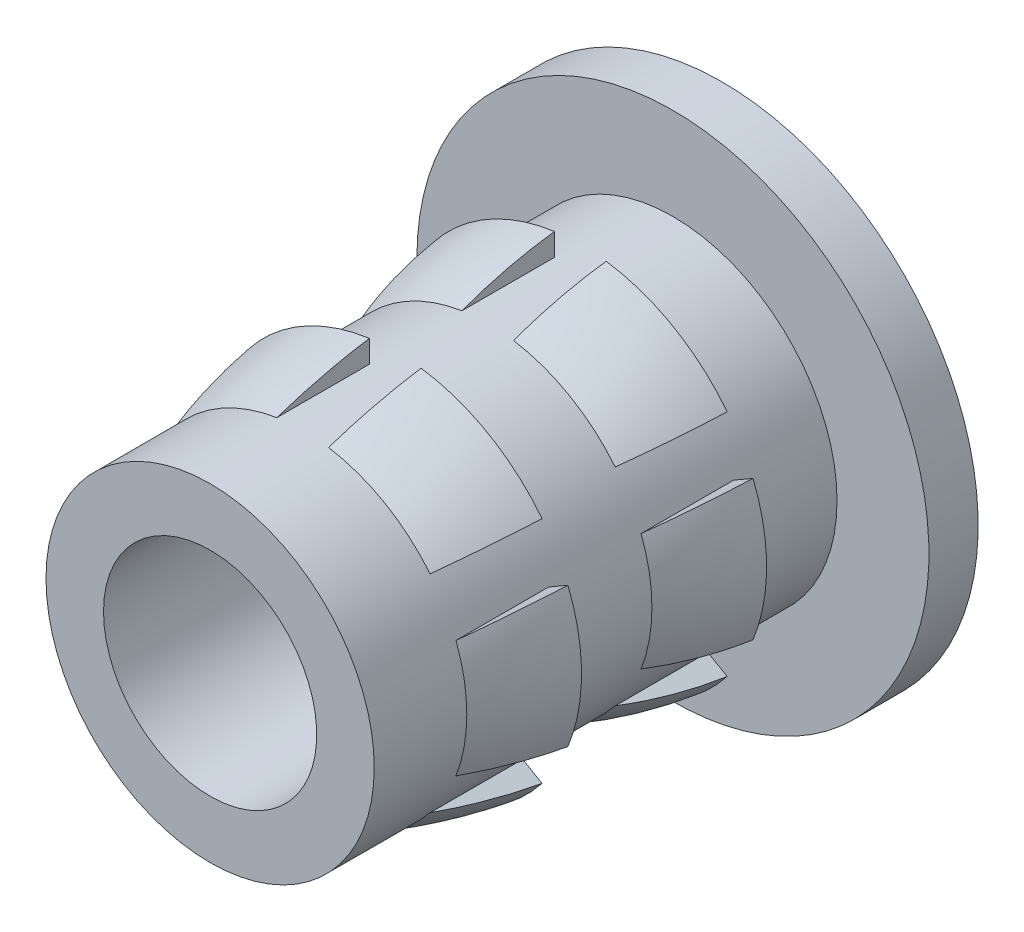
ISO-10303-21;
HEADER;
FILE_DESCRIPTION(('STEP AP214'),'2;1');
FILE_NAME('part.step','',(''),(''),'','','');
FILE_SCHEMA(('AUTOMOTIVE_DESIGN { 1 0 10303 214 1 1 1 1 }'));
ENDSEC;
DATA;
#1=APPLICATION_CONTEXT('core data for automotive mechanical design processes');
#2=APPLICATION_PROTOCOL_DEFINITION('international standard','automotive_design',2000,#1);
#3=PRODUCT_CONTEXT('',#1,'mechanical');
#4=PRODUCT('Part','Part','',(#3));
#5=PRODUCT_RELATED_PRODUCT_CATEGORY('part','',(#4));
#6=PRODUCT_DEFINITION_FORMATION('','',#4);
#7=PRODUCT_DEFINITION_CONTEXT('part definition',#1,'design');
#8=PRODUCT_DEFINITION('design','',#6,#7);
#9=PRODUCT_DEFINITION_SHAPE('','',#8);
#10=(LENGTH_UNIT() NAMED_UNIT(*) SI_UNIT(.MILLI.,.METRE.));
#11=(NAMED_UNIT(*) PLANE_ANGLE_UNIT() SI_UNIT($,.RADIAN.));
#12=(NAMED_UNIT(*) SI_UNIT($,.STERADIAN.) SOLID_ANGLE_UNIT());
#13=UNCERTAINTY_MEASURE_WITH_UNIT(LENGTH_MEASURE(1.E-05),#10,'distance_accuracy_value','');
#14=(GEOMETRIC_REPRESENTATION_CONTEXT(3) GLOBAL_UNCERTAINTY_ASSIGNED_CONTEXT((#13)) GLOBAL_UNIT_ASSIGNED_CONTEXT((#10,
#11,#12)) REPRESENTATION_CONTEXT('',''));
#15=CARTESIAN_POINT('',(0.,0.,0.));
#16=DIRECTION('',(0.,0.,1.));
#17=DIRECTION('',(1.,0.,0.));
#18=AXIS2_PLACEMENT_3D('',#15,#16,#17);
#19=CARTESIAN_POINT('',(11.47774757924,0.,-17.7129707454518));
#20=DIRECTION('',(0.,0.,1.));
#21=DIRECTION('',(1.,0.,0.));
#22=AXIS2_PLACEMENT_3D('',#19,#20,#21);
#23=PLANE('',#22);
#24=CARTESIAN_POINT('',(8.93774757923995,0.,-17.7129707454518));
#25=DIRECTION('',(0.,0.,-1.));
#26=DIRECTION('',(-1.,0.,0.));
#27=AXIS2_PLACEMENT_3D('',#24,#25,#26);
#28=CIRCLE('',#27,2.8829);
#29=CARTESIAN_POINT('',(6.26523179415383,-1.08109749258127,-17.7129707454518));
#30=VERTEX_POINT('',#29);
#31=CARTESIAN_POINT('',(6.26523179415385,1.08109749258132,-17.7129707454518));
#32=VERTEX_POINT('',#31);
#33=EDGE_CURVE('E546',#30,#32,#28,.T.);
#34=ORIENTED_EDGE('',*,*,#33,.T.);
#35=DIRECTION('',(0.866025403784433,-0.50000000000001,0.));
#36=VECTOR('',#35,1.);
#37=CARTESIAN_POINT('',(10.6427475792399,-1.44626242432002,-17.7129707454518));
#38=LINE('',#37,#36);
#39=CARTESIAN_POINT('',(6.56549068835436,0.907742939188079,-17.7129707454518));
#40=VERTEX_POINT('',#39);
#41=EDGE_CURVE('E860',#32,#40,#38,.T.);
#42=ORIENTED_EDGE('',*,*,#41,.T.);
#43=CARTESIAN_POINT('',(8.93774757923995,0.,-17.7129707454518));
#44=DIRECTION('',(0.,0.,-1.));
#45=DIRECTION('',(-1.,0.,0.));
#46=AXIS2_PLACEMENT_3D('',#43,#44,#45);
#47=CIRCLE('',#46,2.54);
#48=CARTESIAN_POINT('',(6.56549068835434,-0.907742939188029,-17.7129707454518));
#49=VERTEX_POINT('',#48);
#50=EDGE_CURVE('E295',#49,#40,#47,.T.);
#51=ORIENTED_EDGE('',*,*,#50,.F.);
#52=DIRECTION('',(-0.866025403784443,-0.499999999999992,0.));
#53=VECTOR('',#52,1.);
#54=CARTESIAN_POINT('',(10.64274757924,1.44626242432,-17.7129707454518));
#55=LINE('',#54,#53);
#56=EDGE_CURVE('E910',#49,#30,#55,.T.);
#57=ORIENTED_EDGE('',*,*,#56,.T.);
#58=EDGE_LOOP('',(#34,#42,#51,#57));
#59=FACE_BOUND('',#58,.T.);
#60=ADVANCED_FACE('F41',(#59),#23,.F.);
#61=CARTESIAN_POINT('',(8.93774757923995,0.,-18.4760222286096));
#62=DIRECTION('',(0.,0.,-1.));
#63=DIRECTION('',(-1.,0.,0.));
#64=AXIS2_PLACEMENT_3D('',#61,#62,#63);
#65=DEGENERATE_TOROIDAL_SURFACE('',#64,3.46886819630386,6.39743751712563,.F.);
#66=CARTESIAN_POINT('',(8.93774757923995,0.,-16.2804107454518));
#67=DIRECTION('',(0.,0.,-1.));
#68=DIRECTION('',(-1.,0.,0.));
#69=AXIS2_PLACEMENT_3D('',#66,#67,#68);
#70=CIRCLE('',#69,2.54);
#71=CARTESIAN_POINT('',(6.56549068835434,-0.907742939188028,-16.2804107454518));
#72=VERTEX_POINT('',#71);
#73=CARTESIAN_POINT('',(6.56549068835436,0.907742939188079,-16.2804107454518));
#74=VERTEX_POINT('',#73);
#75=EDGE_CURVE('E549',#72,#74,#70,.T.);
#76=ORIENTED_EDGE('',*,*,#75,.T.);
#77=CARTESIAN_POINT('',(6.56555477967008,0.907705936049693,-16.2802107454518));
#78=CARTESIAN_POINT('',(6.52847426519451,0.929114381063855,-16.3959026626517));
#79=CARTESIAN_POINT('',(6.49434707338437,0.948817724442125,-16.5128404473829));
#80=CARTESIAN_POINT('',(6.43218546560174,0.984706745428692,-16.7484211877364));
#81=CARTESIAN_POINT('',(6.40413072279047,1.00090415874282,-16.8670569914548));
#82=CARTESIAN_POINT('',(6.32894102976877,1.04431494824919,-17.2258357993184));
#83=CARTESIAN_POINT('',(6.2908753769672,1.06629216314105,-17.4685537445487));
#84=CARTESIAN_POINT('',(6.26521078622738,1.08110962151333,-17.7131707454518));
#85=B_SPLINE_CURVE_WITH_KNOTS('',3,(#77,#78,#79,#80,#81,#82,#83,#84),.UNSPECIFIED.,.F.,.F.,(4,2,
2,4),(0.,0.36999988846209,0.738741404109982,1.47716626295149),.UNSPECIFIED.);
#86=EDGE_CURVE('E864',#74,#32,#85,.T.);
#87=ORIENTED_EDGE('',*,*,#86,.T.);
#88=ORIENTED_EDGE('',*,*,#33,.F.);
#89=CARTESIAN_POINT('',(6.26521078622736,-1.08110962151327,-17.7131707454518));
#90=CARTESIAN_POINT('',(6.29087537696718,-1.066292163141,-17.4685537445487));
#91=CARTESIAN_POINT('',(6.32894102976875,-1.04431494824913,-17.2258357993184));
#92=CARTESIAN_POINT('',(6.40413072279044,-1.00090415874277,-16.8670569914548));
#93=CARTESIAN_POINT('',(6.43218546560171,-0.984706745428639,-16.7484211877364));
#94=CARTESIAN_POINT('',(6.49434707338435,-0.948817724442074,-16.5128404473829));
#95=CARTESIAN_POINT('',(6.52847426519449,-0.929114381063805,-16.3959026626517));
#96=CARTESIAN_POINT('',(6.56555477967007,-0.907705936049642,-16.2802107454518));
#97=B_SPLINE_CURVE_WITH_KNOTS('',3,(#89,#90,#91,#92,#93,#94,#95,#96),.UNSPECIFIED.,.F.,.F.,(4,2,
2,4),(0.,0.738424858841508,1.1071663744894,1.47716626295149),.UNSPECIFIED.);
#98=EDGE_CURVE('E467',#30,#72,#97,.T.);
#99=ORIENTED_EDGE('',*,*,#98,.T.);
#100=EDGE_LOOP('',(#76,#87,#88,#99));
#101=FACE_BOUND('',#100,.T.);
#102=ADVANCED_FACE('F401',(#101),#65,.F.);
#103=CARTESIAN_POINT('',(11.47774757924,0.,-14.8478507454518));
#104=DIRECTION('',(0.,0.,1.));
#105=DIRECTION('',(1.,0.,0.));
#106=AXIS2_PLACEMENT_3D('',#103,#104,#105);
#107=PLANE('',#106);
#108=CARTESIAN_POINT('',(8.93774757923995,0.,-14.8478507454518));
#109=DIRECTION('',(0.,0.,-1.));
#110=DIRECTION('',(-1.,0.,0.));
#111=AXIS2_PLACEMENT_3D('',#108,#109,#110);
#112=CIRCLE('',#111,2.8829);
#113=CARTESIAN_POINT('',(6.26523179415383,-1.08109749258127,-14.8478507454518));
#114=VERTEX_POINT('',#113);
#115=CARTESIAN_POINT('',(6.26523179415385,1.08109749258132,-14.8478507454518));
#116=VERTEX_POINT('',#115);
#117=EDGE_CURVE('E801',#114,#116,#112,.T.);
#118=ORIENTED_EDGE('',*,*,#117,.T.);
#119=DIRECTION('',(0.866025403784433,-0.50000000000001,0.));
#120=VECTOR('',#119,1.);
#121=CARTESIAN_POINT('',(10.6427475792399,-1.44626242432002,-14.8478507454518));
#122=LINE('',#121,#120);
#123=CARTESIAN_POINT('',(6.56549068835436,0.907742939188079,-14.8478507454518));
#124=VERTEX_POINT('',#123);
#125=EDGE_CURVE('E897',#116,#124,#122,.T.);
#126=ORIENTED_EDGE('',*,*,#125,.T.);
#127=CARTESIAN_POINT('',(8.93774757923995,0.,-14.8478507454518));
#128=DIRECTION('',(0.,0.,-1.));
#129=DIRECTION('',(-1.,0.,0.));
#130=AXIS2_PLACEMENT_3D('',#127,#128,#129);
#131=CIRCLE('',#130,2.54);
#132=CARTESIAN_POINT('',(6.56549068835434,-0.907742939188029,-14.8478507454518));
#133=VERTEX_POINT('',#132);
#134=EDGE_CURVE('E895',#133,#124,#131,.T.);
#135=ORIENTED_EDGE('',*,*,#134,.F.);
#136=DIRECTION('',(-0.866025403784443,-0.499999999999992,0.));
#137=VECTOR('',#136,1.);
#138=CARTESIAN_POINT('',(10.64274757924,1.44626242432,-14.8478507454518));
#139=LINE('',#138,#137);
#140=EDGE_CURVE('E872',#133,#114,#139,.T.);
#141=ORIENTED_EDGE('',*,*,#140,.T.);
#142=EDGE_LOOP('',(#118,#126,#135,#141));
#143=FACE_BOUND('',#142,.T.);
#144=ADVANCED_FACE('F720',(#143),#107,.F.);
#145=CARTESIAN_POINT('',(8.93774757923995,0.,-16.1606215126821));
#146=DIRECTION('',(0.,0.,-1.));
#147=DIRECTION('',(-1.,0.,0.));
#148=AXIS2_PLACEMENT_3D('',#145,#146,#147);
#149=DEGENERATE_TOROIDAL_SURFACE('',#148,5.76547320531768,8.74744112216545,.F.);
#150=CARTESIAN_POINT('',(8.93774757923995,0.,-13.4152907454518));
#151=DIRECTION('',(0.,0.,-1.));
#152=DIRECTION('',(-1.,0.,0.));
#153=AXIS2_PLACEMENT_3D('',#150,#151,#152);
#154=CIRCLE('',#153,2.54);
#155=CARTESIAN_POINT('',(6.56549068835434,-0.907742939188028,-13.4152907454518));
#156=VERTEX_POINT('',#155);
#157=CARTESIAN_POINT('',(6.56549068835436,0.907742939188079,-13.4152907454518));
#158=VERTEX_POINT('',#157);
#159=EDGE_CURVE('E813',#156,#158,#154,.T.);
#160=ORIENTED_EDGE('',*,*,#159,.T.);
#161=CARTESIAN_POINT('',(6.56554866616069,0.907709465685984,-13.4150907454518));
#162=CARTESIAN_POINT('',(6.53169878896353,0.927252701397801,-13.5318502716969));
#163=CARTESIAN_POINT('',(6.50002439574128,0.945539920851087,-13.6494422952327));
#164=CARTESIAN_POINT('',(6.44111883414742,0.979549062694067,-13.8858689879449));
#165=CARTESIAN_POINT('',(6.41387967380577,0.995275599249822,-14.0047010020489));
#166=CARTESIAN_POINT('',(6.33874575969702,1.03865418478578,-14.3632312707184));
#167=CARTESIAN_POINT('',(6.29748082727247,1.06247850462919,-14.6048039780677));
#168=CARTESIAN_POINT('',(6.26520524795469,1.08111281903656,-14.8480507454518));
#169=B_SPLINE_CURVE_WITH_KNOTS('',3,(#161,#162,#163,#164,#165,#166,#167,#168),.UNSPECIFIED.,.F.,
.F.,(4,2,2,4),(0.,0.369340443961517,0.738007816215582,1.47584617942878),.UNSPECIFIED.);
#170=EDGE_CURVE('E279',#158,#116,#169,.T.);
#171=ORIENTED_EDGE('',*,*,#170,.T.);
#172=ORIENTED_EDGE('',*,*,#117,.F.);
#173=CARTESIAN_POINT('',(6.26520524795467,-1.0811128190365,-14.8480507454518));
#174=CARTESIAN_POINT('',(6.29748082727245,-1.06247850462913,-14.6048039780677));
#175=CARTESIAN_POINT('',(6.338745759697,-1.03865418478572,-14.3632312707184));
#176=CARTESIAN_POINT('',(6.41387967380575,-0.995275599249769,-14.0047010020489));
#177=CARTESIAN_POINT('',(6.4411188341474,-0.979549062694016,-13.8858689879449));
#178=CARTESIAN_POINT('',(6.50002439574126,-0.945539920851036,-13.6494422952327));
#179=CARTESIAN_POINT('',(6.53169878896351,-0.927252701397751,-13.5318502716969));
#180=CARTESIAN_POINT('',(6.56554866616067,-0.907709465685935,-13.4150907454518));
#181=B_SPLINE_CURVE_WITH_KNOTS('',3,(#173,#174,#175,#176,#177,#178,#179,#180),.UNSPECIFIED.,.F.,
.F.,(4,2,2,4),(0.,0.737838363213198,1.10650573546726,1.47584617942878),.UNSPECIFIED.);
#182=EDGE_CURVE('E868',#114,#156,#181,.T.);
#183=ORIENTED_EDGE('',*,*,#182,.T.);
#184=EDGE_LOOP('',(#160,#171,#172,#183));
#185=FACE_BOUND('',#184,.T.);
#186=ADVANCED_FACE('F724',(#185),#149,.F.);
#187=CARTESIAN_POINT('',(8.53774757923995,-2.85501530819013,-17.7129707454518));
#188=VERTEX_POINT('',#187);
#189=CARTESIAN_POINT('',(6.66523179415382,-1.77391781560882,-17.7129707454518));
#190=VERTEX_POINT('',#189);
#191=EDGE_CURVE('E342',#188,#190,#28,.T.);
#192=ORIENTED_EDGE('',*,*,#191,.T.);
#193=DIRECTION('',(0.866025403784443,0.499999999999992,0.));
#194=VECTOR('',#193,1.);
#195=CARTESIAN_POINT('',(11.04274757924,0.753442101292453,-17.7129707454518));
#196=LINE('',#195,#194);
#197=CARTESIAN_POINT('',(6.96549068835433,-1.60056326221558,-17.7129707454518));
#198=VERTEX_POINT('',#197);
#199=EDGE_CURVE('E341',#190,#198,#196,.T.);
#200=ORIENTED_EDGE('',*,*,#199,.T.);
#201=CARTESIAN_POINT('',(8.53774757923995,-2.50830620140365,-17.7129707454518));
#202=VERTEX_POINT('',#201);
#203=EDGE_CURVE('E300',#202,#198,#47,.T.);
#204=ORIENTED_EDGE('',*,*,#203,.F.);
#205=DIRECTION('',(0.,-1.,0.));
#206=VECTOR('',#205,1.);
#207=CARTESIAN_POINT('',(8.53774757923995,0.,-17.7129707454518));
#208=LINE('',#207,#206);
#209=EDGE_CURVE('E339',#202,#188,#208,.T.);
#210=ORIENTED_EDGE('',*,*,#209,.T.);
#211=EDGE_LOOP('',(#192,#200,#204,#210));
#212=FACE_BOUND('',#211,.T.);
#213=ADVANCED_FACE('F338',(#212),#23,.F.);
#214=CARTESIAN_POINT('',(8.53774757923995,-2.50830620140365,-16.2804107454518));
#215=VERTEX_POINT('',#214);
#216=CARTESIAN_POINT('',(6.96549068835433,-1.60056326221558,-16.2804107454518));
#217=VERTEX_POINT('',#216);
#218=EDGE_CURVE('E553',#215,#217,#70,.T.);
#219=ORIENTED_EDGE('',*,*,#218,.T.);
#220=CARTESIAN_POINT('',(6.96555477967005,-1.60052625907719,-16.2802107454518));
#221=CARTESIAN_POINT('',(6.92847426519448,-1.62193470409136,-16.3959026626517));
#222=CARTESIAN_POINT('',(6.89434707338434,-1.64163804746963,-16.5128404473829));
#223=CARTESIAN_POINT('',(6.8321854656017,-1.67752706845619,-16.7484211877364));
#224=CARTESIAN_POINT('',(6.80413072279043,-1.69372448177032,-16.8670569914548));
#225=CARTESIAN_POINT('',(6.72894102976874,-1.73713527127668,-17.2258357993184));
#226=CARTESIAN_POINT('',(6.69087537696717,-1.75911248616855,-17.4685537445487));
#227=CARTESIAN_POINT('',(6.66521078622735,-1.77392994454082,-17.7131707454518));
#228=B_SPLINE_CURVE_WITH_KNOTS('',3,(#220,#221,#222,#223,#224,#225,#226,#227),.UNSPECIFIED.,.F.,
.F.,(4,2,2,4),(0.,0.36999988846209,0.738741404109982,1.47716626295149),.UNSPECIFIED.);
#229=EDGE_CURVE('E346',#217,#190,#228,.T.);
#230=ORIENTED_EDGE('',*,*,#229,.T.);
#231=ORIENTED_EDGE('',*,*,#191,.F.);
#232=CARTESIAN_POINT('',(8.53774757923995,-2.72354593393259,-16.986553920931));
#233=CARTESIAN_POINT('',(8.53774757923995,-2.68189839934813,-16.8144314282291));
#234=CARTESIAN_POINT('',(8.53774757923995,-2.63302012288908,-16.6440739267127));
#235=CARTESIAN_POINT('',(8.53774757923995,-2.52108864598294,-16.3080009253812));
#236=CARTESIAN_POINT('',(8.53774757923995,-2.45803026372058,-16.1422871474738));
#237=CARTESIAN_POINT('',(8.53774757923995,-2.31799413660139,-15.8164226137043));
#238=CARTESIAN_POINT('',(8.53774757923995,-2.24098621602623,-15.6562848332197));
#239=CARTESIAN_POINT('',(8.53774757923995,-2.07360927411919,-15.3431593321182));
#240=CARTESIAN_POINT('',(8.53774757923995,-1.98324214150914,-15.1901706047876));
#241=CARTESIAN_POINT('',(8.53774757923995,-1.81534503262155,-14.9320691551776));
#242=CARTESIAN_POINT('',(8.53774757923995,-1.74076952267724,-14.8250226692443));
#243=CARTESIAN_POINT('',(8.53774757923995,-1.5848401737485,-14.6159505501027));
#244=CARTESIAN_POINT('',(8.53774757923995,-1.5034852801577,-14.5139257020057));
#245=CARTESIAN_POINT('',(8.53774757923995,-1.33451628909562,-14.3159796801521));
#246=CARTESIAN_POINT('',(8.53774757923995,-1.24693275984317,-14.2200325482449));
#247=CARTESIAN_POINT('',(8.53774757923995,-1.11061234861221,-14.0810370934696));
#248=CARTESIAN_POINT('',(8.53774757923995,-1.06435881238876,-14.0355356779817));
#249=CARTESIAN_POINT('',(8.53774757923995,-0.970137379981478,-13.9463445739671));
#250=CARTESIAN_POINT('',(8.53774757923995,-0.922169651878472,-13.9026547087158));
#251=CARTESIAN_POINT('',(8.53774757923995,-0.821242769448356,-13.8146043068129));
#252=CARTESIAN_POINT('',(8.53774757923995,-0.768161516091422,-13.770383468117));
#253=CARTESIAN_POINT('',(8.53774757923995,-0.659439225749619,-13.6847266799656));
#254=CARTESIAN_POINT('',(8.53774757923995,-0.603789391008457,-13.6433017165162));
#255=CARTESIAN_POINT('',(8.53774757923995,-0.517799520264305,-13.584258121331));
#256=CARTESIAN_POINT('',(8.53774757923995,-0.488578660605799,-13.5650123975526));
#257=CARTESIAN_POINT('',(8.53774757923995,-0.429222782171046,-13.5279961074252));
#258=CARTESIAN_POINT('',(8.53774757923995,-0.399088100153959,-13.5102250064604));
#259=CARTESIAN_POINT('',(8.53774757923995,-0.33780211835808,-13.4767896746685));
#260=CARTESIAN_POINT('',(8.53774757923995,-0.306655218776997,-13.4611175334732));
#261=CARTESIAN_POINT('',(8.53774757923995,-0.243049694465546,-13.4327890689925));
#262=CARTESIAN_POINT('',(8.53774757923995,-0.210593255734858,-13.420127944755));
#263=CARTESIAN_POINT('',(8.53774757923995,-0.141276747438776,-13.3984963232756));
#264=CARTESIAN_POINT('',(8.53774757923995,-0.104277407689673,-13.3899338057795));
#265=CARTESIAN_POINT('',(8.53774757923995,-0.0481629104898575,-13.3828898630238));
#266=CARTESIAN_POINT('',(8.53774757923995,-0.0294061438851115,-13.3815045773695));
#267=CARTESIAN_POINT('',(8.53774757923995,0.00814723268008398,-13.3807463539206));
#268=CARTESIAN_POINT('',(8.53774757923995,0.0269438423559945,-13.3813734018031));
#269=CARTESIAN_POINT('',(8.53774757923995,0.0829086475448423,-13.3862126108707));
#270=CARTESIAN_POINT('',(8.53774757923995,0.119843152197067,-13.3933593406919));
#271=CARTESIAN_POINT('',(8.53774757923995,0.174039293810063,-13.4084603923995));
#272=CARTESIAN_POINT('',(8.53774757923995,0.191980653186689,-13.4142598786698));
#273=CARTESIAN_POINT('',(8.53774757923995,0.227445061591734,-13.4270347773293));
#274=CARTESIAN_POINT('',(8.53774757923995,0.24496811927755,-13.4340101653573));
#275=CARTESIAN_POINT('',(8.53774757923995,0.287167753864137,-13.4521484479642));
#276=CARTESIAN_POINT('',(8.53774757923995,0.311627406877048,-13.4638099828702));
#277=CARTESIAN_POINT('',(8.53774757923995,0.359825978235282,-13.4885481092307));
#278=CARTESIAN_POINT('',(8.53774757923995,0.383564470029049,-13.5016255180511));
#279=CARTESIAN_POINT('',(8.53774757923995,0.453942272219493,-13.5424844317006));
#280=CARTESIAN_POINT('',(8.53774757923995,0.499657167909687,-13.5718521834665));
#281=CARTESIAN_POINT('',(8.53774757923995,0.589403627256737,-13.6333750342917));
#282=CARTESIAN_POINT('',(8.53774757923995,0.633427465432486,-13.6655411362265));
#283=CARTESIAN_POINT('',(8.53774757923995,0.719886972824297,-13.731833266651));
#284=CARTESIAN_POINT('',(8.53774757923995,0.762324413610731,-13.7659569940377));
#285=CARTESIAN_POINT('',(8.53774757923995,0.863373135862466,-13.8504630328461));
#286=CARTESIAN_POINT('',(8.53774757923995,0.921301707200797,-13.9016610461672));
#287=CARTESIAN_POINT('',(8.53774757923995,1.03470392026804,-14.0067168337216));
#288=CARTESIAN_POINT('',(8.53774757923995,1.09017689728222,-14.0605753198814));
#289=CARTESIAN_POINT('',(8.53774757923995,1.25319129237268,-14.225769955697));
#290=CARTESIAN_POINT('',(8.53774757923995,1.35720317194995,-14.3406185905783));
#291=CARTESIAN_POINT('',(8.53774757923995,1.5555963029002,-14.577801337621));
#292=CARTESIAN_POINT('',(8.53774757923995,1.65000135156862,-14.7001156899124));
#293=CARTESIAN_POINT('',(8.53774757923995,1.82920085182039,-14.9514865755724));
#294=CARTESIAN_POINT('',(8.53774757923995,1.91400083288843,-15.0805391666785));
#295=CARTESIAN_POINT('',(8.53774757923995,2.07509847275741,-15.3468599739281));
#296=CARTESIAN_POINT('',(8.53774757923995,2.15122640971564,-15.4842307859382));
#297=CARTESIAN_POINT('',(8.53774757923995,2.2929501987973,-15.7643275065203));
#298=CARTESIAN_POINT('',(8.53774757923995,2.35854433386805,-15.9070542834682));
#299=CARTESIAN_POINT('',(8.53774757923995,2.47891050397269,-16.1971018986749));
#300=CARTESIAN_POINT('',(8.53774757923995,2.53367595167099,-16.3444254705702));
#301=CARTESIAN_POINT('',(8.53774757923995,2.6320660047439,-16.6427490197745));
#302=CARTESIAN_POINT('',(8.53774757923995,2.67569012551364,-16.7937491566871));
#303=CARTESIAN_POINT('',(8.53774757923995,2.75627389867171,-17.1174583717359));
#304=CARTESIAN_POINT('',(8.53774757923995,2.79174041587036,-17.2905411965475));
#305=CARTESIAN_POINT('',(8.53774757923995,2.84807982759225,-17.6389971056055));
#306=CARTESIAN_POINT('',(8.53774757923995,2.86895789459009,-17.8143693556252));
#307=CARTESIAN_POINT('',(8.53774757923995,2.89601024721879,-18.1662833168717));
#308=CARTESIAN_POINT('',(8.53774757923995,2.90218139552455,-18.34282526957));
#309=CARTESIAN_POINT('',(8.53774757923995,2.89977051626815,-18.6957439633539));
#310=CARTESIAN_POINT('',(8.53774757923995,2.89119380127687,-18.8721207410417));
#311=CARTESIAN_POINT('',(8.53774757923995,2.85921079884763,-19.2251146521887));
#312=CARTESIAN_POINT('',(8.53774757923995,2.83567276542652,-19.4017198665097));
#313=CARTESIAN_POINT('',(8.53774757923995,2.7738124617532,-19.7522550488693));
#314=CARTESIAN_POINT('',(8.53774757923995,2.73549559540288,-19.9261859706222));
#315=CARTESIAN_POINT('',(8.53774757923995,2.64425440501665,-20.2704730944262));
#316=CARTESIAN_POINT('',(8.53774757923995,2.59130677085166,-20.4408231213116));
#317=CARTESIAN_POINT('',(8.53774757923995,2.47119596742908,-20.776362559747));
#318=CARTESIAN_POINT('',(8.53774757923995,2.40403826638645,-20.9415539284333));
#319=CARTESIAN_POINT('',(8.53774757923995,2.25595896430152,-21.2655355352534));
#320=CARTESIAN_POINT('',(8.53774757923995,2.17504548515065,-21.4243294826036));
#321=CARTESIAN_POINT('',(8.53774757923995,1.99988599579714,-21.7344452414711));
#322=CARTESIAN_POINT('',(8.53774757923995,1.90563593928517,-21.8857647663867));
#323=CARTESIAN_POINT('',(8.53774757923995,1.70460858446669,-22.1792107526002));
#324=CARTESIAN_POINT('',(8.53774757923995,1.5978704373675,-22.3213638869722));
#325=CARTESIAN_POINT('',(8.53774757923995,1.42857587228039,-22.5268778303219));
#326=CARTESIAN_POINT('',(8.53774757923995,1.37062996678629,-22.5940794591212));
#327=CARTESIAN_POINT('',(8.53774757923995,1.25166723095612,-22.7257018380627));
#328=CARTESIAN_POINT('',(8.53774757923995,1.19065086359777,-22.7901230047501));
#329=CARTESIAN_POINT('',(8.53774757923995,1.0676931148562,-22.9136597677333));
#330=CARTESIAN_POINT('',(8.53774757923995,1.0058592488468,-22.9728822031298));
#331=CARTESIAN_POINT('',(8.53774757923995,0.879136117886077,-23.0879590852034));
#332=CARTESIAN_POINT('',(8.53774757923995,0.814247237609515,-23.1438139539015));
#333=CARTESIAN_POINT('',(8.53774757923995,0.688197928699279,-23.2454525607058));
#334=CARTESIAN_POINT('',(8.53774757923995,0.6273941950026,-23.2916720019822));
#335=CARTESIAN_POINT('',(8.53774757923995,0.533528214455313,-23.3572491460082));
#336=CARTESIAN_POINT('',(8.53774757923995,0.501784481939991,-23.3784896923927));
#337=CARTESIAN_POINT('',(8.53774757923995,0.437232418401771,-23.4192744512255));
#338=CARTESIAN_POINT('',(8.53774757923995,0.404424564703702,-23.43881941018));
#339=CARTESIAN_POINT('',(8.53774757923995,0.335054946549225,-23.4768420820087));
#340=CARTESIAN_POINT('',(8.53774757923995,0.298393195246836,-23.4951407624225));
#341=CARTESIAN_POINT('',(8.53774757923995,0.223172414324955,-23.5273303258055));
#342=CARTESIAN_POINT('',(8.53774757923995,0.184617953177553,-23.5412312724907));
#343=CARTESIAN_POINT('',(8.53774757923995,0.11436215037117,-23.5595912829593));
#344=CARTESIAN_POINT('',(8.53774757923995,0.083050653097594,-23.5654648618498));
#345=CARTESIAN_POINT('',(8.53774757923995,0.0199297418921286,-23.5715718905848));
#346=CARTESIAN_POINT('',(8.53774757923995,-0.0118779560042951,-23.5718217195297));
#347=CARTESIAN_POINT('',(8.53774757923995,-0.0749027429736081,-23.566665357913));
#348=CARTESIAN_POINT('',(8.53774757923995,-0.106121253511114,-23.5612752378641));
#349=CARTESIAN_POINT('',(8.53774757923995,-0.167521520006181,-23.5460617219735));
#350=CARTESIAN_POINT('',(8.53774757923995,-0.197698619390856,-23.5362206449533));
#351=CARTESIAN_POINT('',(8.53774757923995,-0.271048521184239,-23.5080406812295));
#352=CARTESIAN_POINT('',(8.53774757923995,-0.313502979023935,-23.4878904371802));
#353=CARTESIAN_POINT('',(8.53774757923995,-0.396394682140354,-23.4437362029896));
#354=CARTESIAN_POINT('',(8.53774757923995,-0.436826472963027,-23.4197224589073));
#355=CARTESIAN_POINT('',(8.53774757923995,-0.516376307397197,-23.3690414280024));
#356=CARTESIAN_POINT('',(8.53774757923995,-0.555483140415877,-23.3423567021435));
#357=CARTESIAN_POINT('',(8.53774757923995,-0.632343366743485,-23.2872153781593));
#358=CARTESIAN_POINT('',(8.53774757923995,-0.670098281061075,-23.2587608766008));
#359=CARTESIAN_POINT('',(8.53774757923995,-0.764375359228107,-23.1848542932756));
#360=CARTESIAN_POINT('',(8.53774757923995,-0.820146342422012,-23.1384437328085));
#361=CARTESIAN_POINT('',(8.53774757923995,-0.929420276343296,-23.0430159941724));
#362=CARTESIAN_POINT('',(8.53774757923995,-0.982922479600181,-22.9939979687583));
#363=CARTESIAN_POINT('',(8.53774757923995,-1.14038655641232,-22.8434840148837));
#364=CARTESIAN_POINT('',(8.53774757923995,-1.24116952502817,-22.7386381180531));
#365=CARTESIAN_POINT('',(8.53774757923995,-1.43419984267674,-22.5220111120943));
#366=CARTESIAN_POINT('',(8.53774757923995,-1.52647294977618,-22.4102527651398));
#367=CARTESIAN_POINT('',(8.53774757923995,-1.70265550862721,-22.1804519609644));
#368=CARTESIAN_POINT('',(8.53774757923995,-1.7865706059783,-22.0624138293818));
#369=CARTESIAN_POINT('',(8.53774757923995,-1.94891457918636,-21.8160931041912));
#370=CARTESIAN_POINT('',(8.53774757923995,-2.0270115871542,-21.6875914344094));
#371=CARTESIAN_POINT('',(8.53774757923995,-2.173713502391,-21.4252906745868));
#372=CARTESIAN_POINT('',(8.53774757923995,-2.24231642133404,-21.2914904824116));
#373=CARTESIAN_POINT('',(8.53774757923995,-2.4335036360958,-20.8830046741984));
#374=CARTESIAN_POINT('',(8.53774757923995,-2.541464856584,-20.6012361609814));
#375=CARTESIAN_POINT('',(8.53774757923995,-2.679851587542,-20.1450469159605));
#376=CARTESIAN_POINT('',(8.53774757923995,-2.72386473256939,-19.9745630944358));
#377=CARTESIAN_POINT('',(8.53774757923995,-2.79753847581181,-19.6305312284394));
#378=CARTESIAN_POINT('',(8.53774757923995,-2.8272036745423,-19.4569841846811));
#379=CARTESIAN_POINT('',(8.53774757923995,-2.87197329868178,-19.108120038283));
#380=CARTESIAN_POINT('',(8.53774757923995,-2.88708490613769,-18.932803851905));
#381=CARTESIAN_POINT('',(8.53774757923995,-2.902681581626,-18.5815813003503));
#382=CARTESIAN_POINT('',(8.53774757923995,-2.90317114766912,-18.4056751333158));
#383=CARTESIAN_POINT('',(8.53774757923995,-2.8882113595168,-18.0205929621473));
#384=CARTESIAN_POINT('',(8.53774757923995,-2.86967589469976,-17.8115303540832));
#385=CARTESIAN_POINT('',(8.53774757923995,-2.81197876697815,-17.3963401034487));
#386=CARTESIAN_POINT('',(8.53774757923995,-2.77282384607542,-17.1902115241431));
#387=CARTESIAN_POINT('',(8.53774757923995,-2.72354593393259,-16.986553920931));
#388=B_SPLINE_CURVE_WITH_KNOTS('',3,(#232,#233,#234,#235,#236,#237,#238,#239,#240,#241,#242,
#243,#244,#245,#246,#247,#248,#249,#250,#251,#252,#253,#254,#255,#256,#257,#258,#259,#260,#261,
#262,#263,#264,#265,#266,#267,#268,#269,#270,#271,#272,#273,#274,#275,#276,#277,#278,#279,#280,
#281,#282,#283,#284,#285,#286,#287,#288,#289,#290,#291,#292,#293,#294,#295,#296,#297,#298,#299,
#300,#301,#302,#303,#304,#305,#306,#307,#308,#309,#310,#311,#312,#313,#314,#315,#316,#317,#318,
#319,#320,#321,#322,#323,#324,#325,#326,#327,#328,#329,#330,#331,#332,#333,#334,#335,#336,#337,
#338,#339,#340,#341,#342,#343,#344,#345,#346,#347,#348,#349,#350,#351,#352,#353,#354,#355,#356,
#357,#358,#359,#360,#361,#362,#363,#364,#365,#366,#367,#368,#369,#370,#371,#372,#373,#374,#375,
#376,#377,#378,#379,#380,#381,#382,#383,#384,#385,#386,#387),.UNSPECIFIED.,.T.,.F.,(4,2,2,2,2,2,
2,2,2,2,2,2,2,2,2,2,2,2,2,2,2,2,2,2,2,2,2,2,2,2,2,2,2,2,2,2,2,2,2,2,2,2,2,2,2,2,2,2,2,2,2,2,2,2,
2,2,2,2,2,2,2,2,2,2,2,2,2,2,2,2,2,2,2,2,2,2,2,4),(0.,0.531086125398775,1.06236664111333,
1.59481045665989,2.12717906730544,2.51831399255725,2.90950987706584,3.29890322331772,
3.49351374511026,3.68810523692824,3.89529463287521,4.10325572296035,4.20819286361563,
4.31309179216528,4.41758353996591,4.5219075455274,4.63514902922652,4.69147125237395,
4.74779307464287,4.85987052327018,4.9164134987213,4.97295530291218,5.05418265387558,
5.13545714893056,5.29829202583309,5.46179890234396,5.62511737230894,5.85694361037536,
6.08883222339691,6.55310079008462,7.01618978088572,7.47901080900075,7.94972722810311,
8.42052029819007,8.89159888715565,9.36269796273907,9.89210484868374,10.4213239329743,
10.950655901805,11.4797972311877,12.0136638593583,12.547335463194,13.0818622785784,
13.6161837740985,14.1501908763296,14.6843603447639,15.2168978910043,15.4830233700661,
15.7491088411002,16.0058611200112,16.262581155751,16.4915130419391,16.6060598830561,
16.7205560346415,16.843321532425,16.9658040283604,17.0609632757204,17.1558453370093,
17.2504577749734,17.3454494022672,17.486057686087,17.6270266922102,17.7689849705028,
17.9107781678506,18.1283339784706,18.3459609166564,18.781738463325,19.2161504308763,
19.6502669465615,20.1009609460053,20.5517491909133,21.4533339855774,21.9810559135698,
22.5086085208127,23.0359006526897,23.5630305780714,24.1916240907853,24.8200121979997),.UNSPECIFIED.);
#389=EDGE_CURVE('E389',#188,#215,#388,.T.);
#390=ORIENTED_EDGE('',*,*,#389,.T.);
#391=EDGE_LOOP('',(#219,#230,#231,#390));
#392=FACE_BOUND('',#391,.T.);
#393=ADVANCED_FACE('F721',(#392),#65,.F.);
#394=CARTESIAN_POINT('',(8.53774757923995,-2.85501530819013,-14.8478507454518));
#395=VERTEX_POINT('',#394);
#396=CARTESIAN_POINT('',(6.66523179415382,-1.77391781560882,-14.8478507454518));
#397=VERTEX_POINT('',#396);
#398=EDGE_CURVE('E799',#395,#397,#112,.T.);
#399=ORIENTED_EDGE('',*,*,#398,.T.);
#400=DIRECTION('',(0.866025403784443,0.499999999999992,0.));
#401=VECTOR('',#400,1.);
#402=CARTESIAN_POINT('',(11.04274757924,0.753442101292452,-14.8478507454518));
#403=LINE('',#402,#401);
#404=CARTESIAN_POINT('',(6.96549068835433,-1.60056326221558,-14.8478507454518));
#405=VERTEX_POINT('',#404);
#406=EDGE_CURVE('E351',#397,#405,#403,.T.);
#407=ORIENTED_EDGE('',*,*,#406,.T.);
#408=CARTESIAN_POINT('',(8.53774757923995,-2.50830620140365,-14.8478507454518));
#409=VERTEX_POINT('',#408);
#410=EDGE_CURVE('E858',#409,#405,#131,.T.);
#411=ORIENTED_EDGE('',*,*,#410,.F.);
#412=DIRECTION('',(0.,-1.,0.));
#413=VECTOR('',#412,1.);
#414=CARTESIAN_POINT('',(8.53774757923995,0.,-14.8478507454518));
#415=LINE('',#414,#413);
#416=EDGE_CURVE('E369',#409,#395,#415,.T.);
#417=ORIENTED_EDGE('',*,*,#416,.T.);
#418=EDGE_LOOP('',(#399,#407,#411,#417));
#419=FACE_BOUND('',#418,.T.);
#420=ADVANCED_FACE('F756',(#419),#107,.F.);
#421=CARTESIAN_POINT('',(8.53774757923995,-2.50830620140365,-13.4152907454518));
#422=VERTEX_POINT('',#421);
#423=CARTESIAN_POINT('',(6.96549068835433,-1.60056326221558,-13.4152907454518));
#424=VERTEX_POINT('',#423);
#425=EDGE_CURVE('E814',#422,#424,#154,.T.);
#426=ORIENTED_EDGE('',*,*,#425,.T.);
#427=CARTESIAN_POINT('',(6.96554866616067,-1.60052978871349,-13.4150907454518));
#428=CARTESIAN_POINT('',(6.9316987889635,-1.6200730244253,-13.5318502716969));
#429=CARTESIAN_POINT('',(6.90002439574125,-1.63836024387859,-13.6494422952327));
#430=CARTESIAN_POINT('',(6.84111883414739,-1.67236938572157,-13.8858689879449));
#431=CARTESIAN_POINT('',(6.81387967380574,-1.68809592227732,-14.0047010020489));
#432=CARTESIAN_POINT('',(6.73874575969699,-1.73147450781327,-14.3632312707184));
#433=CARTESIAN_POINT('',(6.69748082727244,-1.75529882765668,-14.6048039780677));
#434=CARTESIAN_POINT('',(6.66520524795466,-1.77393314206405,-14.8480507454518));
#435=B_SPLINE_CURVE_WITH_KNOTS('',3,(#427,#428,#429,#430,#431,#432,#433,#434),.UNSPECIFIED.,.F.,
.F.,(4,2,2,4),(0.,0.369340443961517,0.738007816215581,1.47584617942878),.UNSPECIFIED.);
#436=EDGE_CURVE('E912',#424,#397,#435,.T.);
#437=ORIENTED_EDGE('',*,*,#436,.T.);
#438=ORIENTED_EDGE('',*,*,#398,.F.);
#439=CARTESIAN_POINT('',(8.53774757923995,-2.71227842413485,-14.1241608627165));
#440=CARTESIAN_POINT('',(8.53774757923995,-2.65572069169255,-13.8904034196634));
#441=CARTESIAN_POINT('',(8.53774757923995,-2.58940737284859,-13.6590795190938));
#442=CARTESIAN_POINT('',(8.53774757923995,-2.43761002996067,-13.2026864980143));
#443=CARTESIAN_POINT('',(8.53774757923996,-2.3521203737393,-12.9776192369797));
#444=CARTESIAN_POINT('',(8.53774757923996,-2.16259379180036,-12.5358559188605));
#445=CARTESIAN_POINT('',(8.53774757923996,-2.05858508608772,-12.3191477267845));
#446=CARTESIAN_POINT('',(8.53774757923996,-1.83243645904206,-11.8955044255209));
#447=CARTESIAN_POINT('',(8.53774757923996,-1.7103076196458,-11.6885634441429));
#448=CARTESIAN_POINT('',(8.53774757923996,-1.52304919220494,-11.4013310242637));
#449=CARTESIAN_POINT('',(8.53774757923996,-1.46521138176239,-11.3162196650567));
#450=CARTESIAN_POINT('',(8.53774757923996,-1.3461949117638,-11.1483525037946));
#451=CARTESIAN_POINT('',(8.53774757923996,-1.2850162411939,-11.0655967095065));
#452=CARTESIAN_POINT('',(8.53774757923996,-1.15917075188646,-10.9026745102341));
#453=CARTESIAN_POINT('',(8.53774757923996,-1.09450115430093,-10.8225102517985));
#454=CARTESIAN_POINT('',(8.53774757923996,-0.961491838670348,-10.6653109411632));
#455=CARTESIAN_POINT('',(8.53774757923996,-0.893153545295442,-10.5882746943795));
#456=CARTESIAN_POINT('',(8.53774757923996,-0.786995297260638,-10.4753561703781));
#457=CARTESIAN_POINT('',(8.53774757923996,-0.750787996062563,-10.437954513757));
#458=CARTESIAN_POINT('',(8.53774757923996,-0.677059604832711,-10.3644214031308));
#459=CARTESIAN_POINT('',(8.53774757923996,-0.639537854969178,-10.3282906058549));
#460=CARTESIAN_POINT('',(8.53774757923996,-0.562982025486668,-10.2578162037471));
#461=CARTESIAN_POINT('',(8.53774757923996,-0.523951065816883,-10.2234692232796));
#462=CARTESIAN_POINT('',(8.53774757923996,-0.443816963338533,-10.1573093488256));
#463=CARTESIAN_POINT('',(8.53774757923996,-0.402716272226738,-10.1254935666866));
#464=CARTESIAN_POINT('',(8.53774757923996,-0.330405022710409,-10.0752185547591));
#465=CARTESIAN_POINT('',(8.53774757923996,-0.299983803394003,-10.0556382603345));
#466=CARTESIAN_POINT('',(8.53774757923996,-0.237151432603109,-10.0198972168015));
#467=CARTESIAN_POINT('',(8.53774757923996,-0.204743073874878,-10.0037318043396));
#468=CARTESIAN_POINT('',(8.53774757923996,-0.14744035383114,-9.98109212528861));
#469=CARTESIAN_POINT('',(8.53774757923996,-0.123138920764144,-9.97316592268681));
#470=CARTESIAN_POINT('',(8.53774757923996,-0.0735967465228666,-9.96137983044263));
#471=CARTESIAN_POINT('',(8.53774757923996,-0.0483593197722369,-9.95750679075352));
#472=CARTESIAN_POINT('',(8.53774757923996,0.00260226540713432,-9.95460982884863));
#473=CARTESIAN_POINT('',(8.53774757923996,0.0283286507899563,-9.9556223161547));
#474=CARTESIAN_POINT('',(8.53774757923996,0.0791717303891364,-9.96234350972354));
#475=CARTESIAN_POINT('',(8.53774757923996,0.104286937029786,-9.96806268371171));
#476=CARTESIAN_POINT('',(8.53774757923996,0.165566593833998,-9.98683089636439));
#477=CARTESIAN_POINT('',(8.53774757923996,0.201022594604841,-10.0021097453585));
#478=CARTESIAN_POINT('',(8.53774757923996,0.252358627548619,-10.0285111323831));
#479=CARTESIAN_POINT('',(8.53774757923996,0.269207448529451,-10.0379235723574));
#480=CARTESIAN_POINT('',(8.53774757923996,0.302366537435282,-10.0576555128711));
#481=CARTESIAN_POINT('',(8.53774757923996,0.318676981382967,-10.0679747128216));
#482=CARTESIAN_POINT('',(8.53774757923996,0.364851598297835,-10.0986031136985));
#483=CARTESIAN_POINT('',(8.53774757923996,0.394135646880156,-10.1197787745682));
#484=CARTESIAN_POINT('',(8.53774757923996,0.451491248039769,-10.1637243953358));
#485=CARTESIAN_POINT('',(8.53774757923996,0.479561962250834,-10.1864954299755));
#486=CARTESIAN_POINT('',(8.53774757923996,0.534795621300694,-10.2332203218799));
#487=CARTESIAN_POINT('',(8.53774757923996,0.561956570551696,-10.2571765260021));
#488=CARTESIAN_POINT('',(8.53774757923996,0.615486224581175,-10.3059608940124));
#489=CARTESIAN_POINT('',(8.53774757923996,0.641854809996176,-10.3307891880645));
#490=CARTESIAN_POINT('',(8.53774757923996,0.720153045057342,-10.406508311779));
#491=CARTESIAN_POINT('',(8.53774757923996,0.771065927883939,-10.4584516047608));
#492=CARTESIAN_POINT('',(8.53774757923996,0.870647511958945,-10.5642976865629));
#493=CARTESIAN_POINT('',(8.53774757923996,0.91931904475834,-10.6181978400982));
#494=CARTESIAN_POINT('',(8.53774757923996,1.03786977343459,-10.7541746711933));
#495=CARTESIAN_POINT('',(8.53774757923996,1.10660234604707,-10.8372535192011));
#496=CARTESIAN_POINT('',(8.53774757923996,1.24025742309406,-11.0064299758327));
#497=CARTESIAN_POINT('',(8.53774757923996,1.30517900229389,-11.09252830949));
#498=CARTESIAN_POINT('',(8.53774757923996,1.49459906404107,-11.3550049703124));
#499=CARTESIAN_POINT('',(8.53774757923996,1.61360151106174,-11.5353884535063));
#500=CARTESIAN_POINT('',(8.53774757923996,1.83677704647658,-11.9044151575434));
#501=CARTESIAN_POINT('',(8.53774757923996,1.94098735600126,-12.0930360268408));
#502=CARTESIAN_POINT('',(8.53774757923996,2.13464040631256,-12.4775848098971));
#503=CARTESIAN_POINT('',(8.53774757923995,2.22409117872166,-12.6735086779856));
#504=CARTESIAN_POINT('',(8.53774757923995,2.3904282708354,-13.077539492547));
#505=CARTESIAN_POINT('',(8.53774757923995,2.46685492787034,-13.2858356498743));
#506=CARTESIAN_POINT('',(8.53774757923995,2.60341247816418,-13.7077393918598));
#507=CARTESIAN_POINT('',(8.53774757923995,2.66354055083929,-13.9213478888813));
#508=CARTESIAN_POINT('',(8.53774757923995,2.76721680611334,-14.3526846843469));
#509=CARTESIAN_POINT('',(8.53774757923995,2.81075520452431,-14.5704153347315));
#510=CARTESIAN_POINT('',(8.53774757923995,2.88098008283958,-15.008584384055));
#511=CARTESIAN_POINT('',(8.53774757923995,2.90766563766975,-15.2290229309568));
#512=CARTESIAN_POINT('',(8.53774757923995,2.945722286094,-15.6917552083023));
#513=CARTESIAN_POINT('',(8.53774757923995,2.95544991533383,-15.9341857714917));
#514=CARTESIAN_POINT('',(8.53774757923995,2.95455704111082,-16.4190263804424));
#515=CARTESIAN_POINT('',(8.53774757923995,2.94393464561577,-16.6614364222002));
#516=CARTESIAN_POINT('',(8.53774757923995,2.90238998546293,-17.1447012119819));
#517=CARTESIAN_POINT('',(8.53774757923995,2.87145206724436,-17.3855546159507));
#518=CARTESIAN_POINT('',(8.53774757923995,2.78945508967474,-17.8638066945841));
#519=CARTESIAN_POINT('',(8.53774757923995,2.73839647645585,-18.101205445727));
#520=CARTESIAN_POINT('',(8.53774757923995,2.6161441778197,-18.5721182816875));
#521=CARTESIAN_POINT('',(8.53774757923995,2.54484428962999,-18.8056048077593));
#522=CARTESIAN_POINT('',(8.53774757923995,2.38262492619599,-19.2657264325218));
#523=CARTESIAN_POINT('',(8.53774757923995,2.29170109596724,-19.492359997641));
#524=CARTESIAN_POINT('',(8.53774757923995,2.0909722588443,-19.9364528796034));
#525=CARTESIAN_POINT('',(8.53774757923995,1.98121226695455,-20.1539325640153));
#526=CARTESIAN_POINT('',(8.53774757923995,1.74317684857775,-20.5784046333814));
#527=CARTESIAN_POINT('',(8.53774757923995,1.61491394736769,-20.7854039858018));
#528=CARTESIAN_POINT('',(8.53774757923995,1.42351575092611,-21.0647305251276));
#529=CARTESIAN_POINT('',(8.53774757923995,1.36816067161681,-21.1424650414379));
#530=CARTESIAN_POINT('',(8.53774757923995,1.2545388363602,-21.295791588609));
#531=CARTESIAN_POINT('',(8.53774757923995,1.19627201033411,-21.3713835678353));
#532=CARTESIAN_POINT('',(8.53774757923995,1.07663329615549,-21.5202187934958));
#533=CARTESIAN_POINT('',(8.53774757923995,1.01525776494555,-21.5934591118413));
#534=CARTESIAN_POINT('',(8.53774757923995,0.889201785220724,-21.7370118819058));
#535=CARTESIAN_POINT('',(8.53774757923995,0.824522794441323,-21.8073256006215));
#536=CARTESIAN_POINT('',(8.53774757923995,0.724218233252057,-21.9101007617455));
#537=CARTESIAN_POINT('',(8.53774757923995,0.69009901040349,-21.9440342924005));
#538=CARTESIAN_POINT('',(8.53774757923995,0.620614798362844,-22.0106558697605));
#539=CARTESIAN_POINT('',(8.53774757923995,0.585249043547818,-22.0433431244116));
#540=CARTESIAN_POINT('',(8.53774757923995,0.513062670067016,-22.1069237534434));
#541=CARTESIAN_POINT('',(8.53774757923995,0.476245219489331,-22.1378207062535));
#542=CARTESIAN_POINT('',(8.53774757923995,0.400589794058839,-22.1970033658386));
#543=CARTESIAN_POINT('',(8.53774757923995,0.3617547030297,-22.225292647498));
#544=CARTESIAN_POINT('',(8.53774757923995,0.292708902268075,-22.2698688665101));
#545=CARTESIAN_POINT('',(8.53774757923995,0.263228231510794,-22.2872683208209));
#546=CARTESIAN_POINT('',(8.53774757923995,0.202344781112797,-22.3183163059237));
#547=CARTESIAN_POINT('',(8.53774757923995,0.170947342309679,-22.331974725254));
#548=CARTESIAN_POINT('',(8.53774757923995,0.115284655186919,-22.3501971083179));
#549=CARTESIAN_POINT('',(8.53774757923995,0.0915220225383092,-22.3562417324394));
#550=CARTESIAN_POINT('',(8.53774757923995,0.0433319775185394,-22.3642026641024));
#551=CARTESIAN_POINT('',(8.53774757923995,0.0189063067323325,-22.3661288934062));
#552=CARTESIAN_POINT('',(8.53774757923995,-0.0299322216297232,-22.3654643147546));
#553=CARTESIAN_POINT('',(8.53774757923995,-0.0543449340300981,-22.3628636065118));
#554=CARTESIAN_POINT('',(8.53774757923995,-0.10242375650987,-22.3536684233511));
#555=CARTESIAN_POINT('',(8.53774757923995,-0.12608792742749,-22.3470643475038));
#556=CARTESIAN_POINT('',(8.53774757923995,-0.169220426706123,-22.3319588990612));
#557=CARTESIAN_POINT('',(8.53774757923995,-0.188825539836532,-22.3238312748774));
#558=CARTESIAN_POINT('',(8.53774757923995,-0.227270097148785,-22.3059131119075));
#559=CARTESIAN_POINT('',(8.53774757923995,-0.24610881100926,-22.2961210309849));
#560=CARTESIAN_POINT('',(8.53774757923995,-0.283171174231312,-22.2752730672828));
#561=CARTESIAN_POINT('',(8.53774757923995,-0.301391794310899,-22.2642118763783));
#562=CARTESIAN_POINT('',(8.53774757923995,-0.337227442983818,-22.2411732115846));
#563=CARTESIAN_POINT('',(8.53774757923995,-0.354842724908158,-22.2291961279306));
#564=CARTESIAN_POINT('',(8.53774757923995,-0.406932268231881,-22.1922223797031));
#565=CARTESIAN_POINT('',(8.53774757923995,-0.440660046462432,-22.1661773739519));
#566=CARTESIAN_POINT('',(8.53774757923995,-0.506669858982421,-22.1123037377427));
#567=CARTESIAN_POINT('',(8.53774757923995,-0.538950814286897,-22.0844738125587));
#568=CARTESIAN_POINT('',(8.53774757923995,-0.602434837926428,-22.0274887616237));
#569=CARTESIAN_POINT('',(8.53774757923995,-0.633635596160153,-21.9983310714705));
#570=CARTESIAN_POINT('',(8.53774757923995,-0.695092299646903,-21.9390337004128));
#571=CARTESIAN_POINT('',(8.53774757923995,-0.725348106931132,-21.9088938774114));
#572=CARTESIAN_POINT('',(8.53774757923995,-0.815094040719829,-21.8170800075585));
#573=CARTESIAN_POINT('',(8.53774757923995,-0.873355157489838,-21.7542023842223));
#574=CARTESIAN_POINT('',(8.53774757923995,-0.987074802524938,-21.6261262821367));
#575=CARTESIAN_POINT('',(8.53774757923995,-1.04253676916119,-21.5609308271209));
#576=CARTESIAN_POINT('',(8.53774757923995,-1.1679720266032,-21.4077718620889));
#577=CARTESIAN_POINT('',(8.53774757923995,-1.23704944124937,-21.3190729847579));
#578=CARTESIAN_POINT('',(8.53774757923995,-1.37118066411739,-21.1386758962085));
#579=CARTESIAN_POINT('',(8.53774757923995,-1.43623367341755,-21.0469770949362));
#580=CARTESIAN_POINT('',(8.53774757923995,-1.62561272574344,-20.7676623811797));
#581=CARTESIAN_POINT('',(8.53774757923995,-1.74402520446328,-20.5759931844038));
#582=CARTESIAN_POINT('',(8.53774757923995,-1.96468479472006,-20.1842393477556));
#583=CARTESIAN_POINT('',(8.53774757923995,-2.06697074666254,-19.9841764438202));
#584=CARTESIAN_POINT('',(8.53774757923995,-2.25534615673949,-19.5766764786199));
#585=CARTESIAN_POINT('',(8.53774757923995,-2.34144322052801,-19.3692429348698));
#586=CARTESIAN_POINT('',(8.53774757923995,-2.49821990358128,-18.9452859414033));
#587=CARTESIAN_POINT('',(8.53774757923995,-2.56866372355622,-18.7286753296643));
#588=CARTESIAN_POINT('',(8.53774757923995,-2.69221229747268,-18.290530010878));
#589=CARTESIAN_POINT('',(8.53774757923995,-2.74531416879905,-18.0689944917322));
#590=CARTESIAN_POINT('',(8.53774757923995,-2.83388957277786,-17.6223615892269));
#591=CARTESIAN_POINT('',(8.53774757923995,-2.86935878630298,-17.3972633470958));
#592=CARTESIAN_POINT('',(8.53774757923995,-2.92245646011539,-16.9450375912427));
#593=CARTESIAN_POINT('',(8.53774757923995,-2.94008706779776,-16.7179103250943));
#594=CARTESIAN_POINT('',(8.53774757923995,-2.96385047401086,-16.0933081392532));
#595=CARTESIAN_POINT('',(8.53774757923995,-2.95163057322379,-15.6949917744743));
#596=CARTESIAN_POINT('',(8.53774757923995,-2.87260314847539,-14.9036189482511));
#597=CARTESIAN_POINT('',(8.53774757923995,-2.80576913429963,-14.5105651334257));
#598=CARTESIAN_POINT('',(8.53774757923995,-2.71227842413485,-14.1241608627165));
#599=B_SPLINE_CURVE_WITH_KNOTS('',3,(#439,#440,#441,#442,#443,#444,#445,#446,#447,#448,#449,
#450,#451,#452,#453,#454,#455,#456,#457,#458,#459,#460,#461,#462,#463,#464,#465,#466,#467,#468,
#469,#470,#471,#472,#473,#474,#475,#476,#477,#478,#479,#480,#481,#482,#483,#484,#485,#486,#487,
#488,#489,#490,#491,#492,#493,#494,#495,#496,#497,#498,#499,#500,#501,#502,#503,#504,#505,#506,
#507,#508,#509,#510,#511,#512,#513,#514,#515,#516,#517,#518,#519,#520,#521,#522,#523,#524,#525,
#526,#527,#528,#529,#530,#531,#532,#533,#534,#535,#536,#537,#538,#539,#540,#541,#542,#543,#544,
#545,#546,#547,#548,#549,#550,#551,#552,#553,#554,#555,#556,#557,#558,#559,#560,#561,#562,#563,
#564,#565,#566,#567,#568,#569,#570,#571,#572,#573,#574,#575,#576,#577,#578,#579,#580,#581,#582,
#583,#584,#585,#586,#587,#588,#589,#590,#591,#592,#593,#594,#595,#596,#597,#598),.UNSPECIFIED.,
.T.,.F.,(4,2,2,2,2,2,2,2,2,2,2,2,2,2,2,2,2,2,2,2,2,2,2,2,2,2,2,2,2,2,2,2,2,2,2,2,2,2,2,2,2,2,2,
2,2,2,2,2,2,2,2,2,2,2,2,2,2,2,2,2,2,2,2,2,2,2,2,2,2,2,2,2,2,2,2,2,2,2,2,4),(0.,
0.721174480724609,1.44256105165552,2.16285761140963,2.88271545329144,3.19136570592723,
3.50001697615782,3.80891766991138,4.1176992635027,4.27384508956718,4.43007045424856,
4.58598852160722,4.74172605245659,4.85014436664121,4.95841365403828,5.03484431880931,
5.11102623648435,5.18777677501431,5.26469847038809,5.37982946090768,5.43772186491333,
5.49559514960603,5.60392140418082,5.71232134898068,5.82094528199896,5.92958549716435,
6.14769625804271,6.36552345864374,6.68885912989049,7.01227297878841,7.65979595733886,
8.30565955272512,8.95117052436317,9.61612681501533,10.2811981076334,10.9466610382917,
11.6121604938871,12.3391709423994,13.0662489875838,13.7938879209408,14.521510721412,
15.2530241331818,15.9847000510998,16.7146511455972,17.4441104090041,17.7303507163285,
18.016597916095,18.3031886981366,18.58965408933,18.7339936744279,18.8784235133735,
19.0225539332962,19.1664837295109,19.2690380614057,19.3713186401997,19.4445920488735,
19.5176887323,19.5909454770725,19.664378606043,19.7279531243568,19.7915868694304,
19.8554971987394,19.9193804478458,20.0471127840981,20.1749388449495,20.3030232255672,
20.4311262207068,20.6881767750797,20.9449034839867,21.2820411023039,21.6192454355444,
22.2942889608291,22.9676809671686,23.6407558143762,24.3233698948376,25.006097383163,
25.6889920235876,26.3718044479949,27.5633375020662,28.7554488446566),.UNSPECIFIED.);
#600=EDGE_CURVE('E362',#395,#422,#599,.T.);
#601=ORIENTED_EDGE('',*,*,#600,.T.);
#602=EDGE_LOOP('',(#426,#437,#438,#601));
#603=FACE_BOUND('',#602,.T.);
#604=ADVANCED_FACE('F750',(#603),#149,.F.);
#605=CARTESIAN_POINT('',(11.2102633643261,-1.77391781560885,-17.7129707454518));
#606=VERTEX_POINT('',#605);
#607=CARTESIAN_POINT('',(9.33774757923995,-2.85501530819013,-17.7129707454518));
#608=VERTEX_POINT('',#607);
#609=EDGE_CURVE('E575',#606,#608,#28,.T.);
#610=ORIENTED_EDGE('',*,*,#609,.T.);
#611=DIRECTION('',(0.,1.,0.));
#612=VECTOR('',#611,1.);
#613=CARTESIAN_POINT('',(9.33774757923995,0.,-17.7129707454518));
#614=LINE('',#613,#612);
#615=CARTESIAN_POINT('',(9.33774757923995,-2.50830620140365,-17.7129707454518));
#616=VERTEX_POINT('',#615);
#617=EDGE_CURVE('E571',#608,#616,#614,.T.);
#618=ORIENTED_EDGE('',*,*,#617,.T.);
#619=CARTESIAN_POINT('',(10.9100044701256,-1.60056326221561,-17.7129707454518));
#620=VERTEX_POINT('',#619);
#621=EDGE_CURVE('E314',#620,#616,#47,.T.);
#622=ORIENTED_EDGE('',*,*,#621,.F.);
#623=DIRECTION('',(0.866025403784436,-0.500000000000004,0.));
#624=VECTOR('',#623,1.);
#625=CARTESIAN_POINT('',(10.6427475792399,-1.44626242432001,-17.7129707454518));
#626=LINE('',#625,#624);
#627=EDGE_CURVE('E611',#620,#606,#626,.T.);
#628=ORIENTED_EDGE('',*,*,#627,.T.);
#629=EDGE_LOOP('',(#610,#618,#622,#628));
#630=FACE_BOUND('',#629,.T.);
#631=ADVANCED_FACE('F573',(#630),#23,.F.);
#632=CARTESIAN_POINT('',(10.9100044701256,-1.60056326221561,-16.2804107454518));
#633=VERTEX_POINT('',#632);
#634=CARTESIAN_POINT('',(9.33774757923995,-2.50830620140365,-16.2804107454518));
#635=VERTEX_POINT('',#634);
#636=EDGE_CURVE('E548',#633,#635,#70,.T.);
#637=ORIENTED_EDGE('',*,*,#636,.T.);
#638=CARTESIAN_POINT('',(9.33774757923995,-2.72354593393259,-16.986553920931));
#639=CARTESIAN_POINT('',(9.33774757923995,-2.76542286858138,-17.1596038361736));
#640=CARTESIAN_POINT('',(9.33774757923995,-2.79997092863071,-17.3343711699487));
#641=CARTESIAN_POINT('',(9.33774757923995,-2.85423599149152,-17.6862491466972));
#642=CARTESIAN_POINT('',(9.33774757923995,-2.87395073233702,-17.8633601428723));
#643=CARTESIAN_POINT('',(9.33774757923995,-2.8983912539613,-18.2185222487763));
#644=CARTESIAN_POINT('',(9.33774757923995,-2.90312404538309,-18.3965728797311));
#645=CARTESIAN_POINT('',(9.33774757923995,-2.89759138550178,-18.7525221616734));
#646=CARTESIAN_POINT('',(9.33774757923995,-2.88731927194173,-18.9304207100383));
#647=CARTESIAN_POINT('',(9.33774757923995,-2.85183411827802,-19.2846973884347));
#648=CARTESIAN_POINT('',(9.33774757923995,-2.82662305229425,-19.4610757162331));
#649=CARTESIAN_POINT('',(9.33774757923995,-2.76144299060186,-19.8110017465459));
#650=CARTESIAN_POINT('',(9.33774757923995,-2.72148069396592,-19.9845506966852));
#651=CARTESIAN_POINT('',(9.33774757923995,-2.62697318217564,-20.3279659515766));
#652=CARTESIAN_POINT('',(9.33774757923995,-2.57240208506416,-20.4978251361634));
#653=CARTESIAN_POINT('',(9.33774757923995,-2.44908537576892,-20.832244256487));
#654=CARTESIAN_POINT('',(9.33774757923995,-2.38034523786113,-20.9968062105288));
#655=CARTESIAN_POINT('',(9.33774757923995,-2.22916148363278,-21.3193682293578));
#656=CARTESIAN_POINT('',(9.33774757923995,-2.14672796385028,-21.4773730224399));
#657=CARTESIAN_POINT('',(9.33774757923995,-1.96858271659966,-21.7857765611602));
#658=CARTESIAN_POINT('',(9.33774757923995,-1.87286662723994,-21.9361727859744));
#659=CARTESIAN_POINT('',(9.33774757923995,-1.66899513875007,-22.2275859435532));
#660=CARTESIAN_POINT('',(9.33774757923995,-1.56088246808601,-22.3686325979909));
#661=CARTESIAN_POINT('',(9.33774757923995,-1.38955464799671,-22.5723459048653));
#662=CARTESIAN_POINT('',(9.33774757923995,-1.3309371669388,-22.6389227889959));
#663=CARTESIAN_POINT('',(9.33774757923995,-1.21062989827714,-22.7692361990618));
#664=CARTESIAN_POINT('',(9.33774757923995,-1.14894060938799,-22.8329731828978));
#665=CARTESIAN_POINT('',(9.33774757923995,-1.02662095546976,-22.9531210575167));
#666=CARTESIAN_POINT('',(9.33774757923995,-0.966192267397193,-23.0097373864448));
#667=CARTESIAN_POINT('',(9.33774757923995,-0.842402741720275,-23.1197298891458));
#668=CARTESIAN_POINT('',(9.33774757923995,-0.779041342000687,-23.1731054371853));
#669=CARTESIAN_POINT('',(9.33774757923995,-0.684059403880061,-23.2479133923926));
#670=CARTESIAN_POINT('',(9.33774757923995,-0.653766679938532,-23.2710366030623));
#671=CARTESIAN_POINT('',(9.33774757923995,-0.592372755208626,-23.3161795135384));
#672=CARTESIAN_POINT('',(9.33774757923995,-0.561271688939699,-23.3381993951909));
#673=CARTESIAN_POINT('',(9.33774757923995,-0.498108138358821,-23.3808564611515));
#674=CARTESIAN_POINT('',(9.33774757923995,-0.466045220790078,-23.4014930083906));
#675=CARTESIAN_POINT('',(9.33774757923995,-0.400779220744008,-23.4408582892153));
#676=CARTESIAN_POINT('',(9.33774757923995,-0.36757683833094,-23.4595881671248));
#677=CARTESIAN_POINT('',(9.33774757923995,-0.299317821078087,-23.4944768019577));
#678=CARTESIAN_POINT('',(9.33774757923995,-0.264243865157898,-23.510602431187));
#679=CARTESIAN_POINT('',(9.33774757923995,-0.19236678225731,-23.5383196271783));
#680=CARTESIAN_POINT('',(9.33774757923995,-0.155569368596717,-23.5499251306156));
#681=CARTESIAN_POINT('',(9.33774757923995,-0.0873004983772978,-23.5646717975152));
#682=CARTESIAN_POINT('',(9.33774757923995,-0.0560960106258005,-23.5689780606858));
#683=CARTESIAN_POINT('',(9.33774757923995,0.00653370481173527,-23.5719095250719));
#684=CARTESIAN_POINT('',(9.33774757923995,0.037958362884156,-23.5705461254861));
#685=CARTESIAN_POINT('',(9.33774757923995,0.108553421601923,-23.5614237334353));
#686=CARTESIAN_POINT('',(9.33774757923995,0.147501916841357,-23.5520236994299));
#687=CARTESIAN_POINT('',(9.33774757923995,0.204495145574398,-23.53352941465));
#688=CARTESIAN_POINT('',(9.33774757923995,0.22332350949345,-23.5265974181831));
#689=CARTESIAN_POINT('',(9.33774757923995,0.2605139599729,-23.5115717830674));
#690=CARTESIAN_POINT('',(9.33774757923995,0.278876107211,-23.5034782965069));
#691=CARTESIAN_POINT('',(9.33774757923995,0.325121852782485,-23.4816903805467));
#692=CARTESIAN_POINT('',(9.33774757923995,0.352702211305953,-23.4673592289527));
#693=CARTESIAN_POINT('',(9.33774757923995,0.407004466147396,-23.4371427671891));
#694=CARTESIAN_POINT('',(9.33774757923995,0.433725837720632,-23.4212565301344));
#695=CARTESIAN_POINT('',(9.33774757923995,0.512909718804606,-23.371824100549));
#696=CARTESIAN_POINT('',(9.33774757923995,0.56429310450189,-23.3365545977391));
#697=CARTESIAN_POINT('',(9.33774757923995,0.66507230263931,-23.2629521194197));
#698=CARTESIAN_POINT('',(9.33774757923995,0.714459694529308,-23.2246078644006));
#699=CARTESIAN_POINT('',(9.33774757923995,0.811336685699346,-23.1457093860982));
#700=CARTESIAN_POINT('',(9.33774757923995,0.858828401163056,-23.1051577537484));
#701=CARTESIAN_POINT('',(9.33774757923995,0.960002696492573,-23.0152100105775));
#702=CARTESIAN_POINT('',(9.33774757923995,1.01338233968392,-22.9654738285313));
#703=CARTESIAN_POINT('',(9.33774757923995,1.11800731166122,-22.8637987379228));
#704=CARTESIAN_POINT('',(9.33774757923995,1.16925227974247,-22.8118594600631));
#705=CARTESIAN_POINT('',(9.33774757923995,1.31995258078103,-22.6529815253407));
#706=CARTESIAN_POINT('',(9.33774757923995,1.41628781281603,-22.5430597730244));
#707=CARTESIAN_POINT('',(9.33774757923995,1.60031750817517,-22.3167665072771));
#708=CARTESIAN_POINT('',(9.33774757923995,1.68803624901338,-22.2004146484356));
#709=CARTESIAN_POINT('',(9.33774757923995,1.85489654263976,-21.9618127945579));
#710=CARTESIAN_POINT('',(9.33774757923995,1.934041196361,-21.8395649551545));
#711=CARTESIAN_POINT('',(9.33774757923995,2.17369912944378,-21.439138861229));
#712=CARTESIAN_POINT('',(9.33774757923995,2.3173159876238,-21.1506038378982));
#713=CARTESIAN_POINT('',(9.33774757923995,2.55898140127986,-20.5546417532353));
#714=CARTESIAN_POINT('',(9.33774757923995,2.65696735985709,-20.2471893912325));
#715=CARTESIAN_POINT('',(9.33774757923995,2.77168587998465,-19.7624081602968));
#716=CARTESIAN_POINT('',(9.33774757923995,2.80513579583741,-19.5888775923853));
#717=CARTESIAN_POINT('',(9.33774757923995,2.85743091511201,-19.2395835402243));
#718=CARTESIAN_POINT('',(9.33774757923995,2.87627518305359,-19.063819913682));
#719=CARTESIAN_POINT('',(9.33774757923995,2.89921049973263,-18.7114326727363));
#720=CARTESIAN_POINT('',(9.33774757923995,2.90330912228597,-18.5348095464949));
#721=CARTESIAN_POINT('',(9.33774757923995,2.89675203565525,-18.181836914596));
#722=CARTESIAN_POINT('',(9.33774757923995,2.88609645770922,-18.0054874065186));
#723=CARTESIAN_POINT('',(9.33774757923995,2.8499480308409,-17.6528195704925));
#724=CARTESIAN_POINT('',(9.33774757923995,2.82433147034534,-17.4765139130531));
#725=CARTESIAN_POINT('',(9.33774757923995,2.75834584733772,-17.1267510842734));
#726=CARTESIAN_POINT('',(9.33774757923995,2.71798211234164,-16.9532929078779));
#727=CARTESIAN_POINT('',(9.33774757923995,2.62267527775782,-16.6100794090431));
#728=CARTESIAN_POINT('',(9.33774757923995,2.56770514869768,-16.4403315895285));
#729=CARTESIAN_POINT('',(9.33774757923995,2.44359878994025,-16.1061698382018));
#730=CARTESIAN_POINT('',(9.33774757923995,2.37446804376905,-15.9417538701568));
#731=CARTESIAN_POINT('',(9.33774757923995,2.22252046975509,-15.6195327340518));
#732=CARTESIAN_POINT('',(9.33774757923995,2.13971496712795,-15.4617222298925));
#733=CARTESIAN_POINT('',(9.33774757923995,1.96083877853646,-15.1537401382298));
#734=CARTESIAN_POINT('',(9.33774757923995,1.86476364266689,-15.0035711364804));
#735=CARTESIAN_POINT('',(9.33774757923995,1.66019725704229,-14.7126612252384));
#736=CARTESIAN_POINT('',(9.33774757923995,1.55174984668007,-14.5718896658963));
#737=CARTESIAN_POINT('',(9.33774757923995,1.37992645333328,-14.3686242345));
#738=CARTESIAN_POINT('',(9.33774757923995,1.321145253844,-14.3022027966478));
#739=CARTESIAN_POINT('',(9.33774757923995,1.20050983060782,-14.1722158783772));
#740=CARTESIAN_POINT('',(9.33774757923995,1.13865611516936,-14.1086499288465));
#741=CARTESIAN_POINT('',(9.33774757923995,1.01649858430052,-13.9893316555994));
#742=CARTESIAN_POINT('',(9.33774757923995,0.956419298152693,-13.9333493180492));
#743=CARTESIAN_POINT('',(9.33774757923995,0.833357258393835,-13.8245993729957));
#744=CARTESIAN_POINT('',(9.33774757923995,0.770373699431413,-13.7718326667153));
#745=CARTESIAN_POINT('',(9.33774757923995,0.675737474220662,-13.6977329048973));
#746=CARTESIAN_POINT('',(9.33774757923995,0.645397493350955,-13.6747187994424));
#747=CARTESIAN_POINT('',(9.33774757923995,0.583900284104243,-13.6298139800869));
#748=CARTESIAN_POINT('',(9.33774757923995,0.552743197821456,-13.6079230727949));
#749=CARTESIAN_POINT('',(9.33774757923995,0.489454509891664,-13.5655575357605));
#750=CARTESIAN_POINT('',(9.33774757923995,0.457322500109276,-13.5450835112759));
#751=CARTESIAN_POINT('',(9.33774757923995,0.391898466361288,-13.5061010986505));
#752=CARTESIAN_POINT('',(9.33774757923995,0.358607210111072,-13.487591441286));
#753=CARTESIAN_POINT('',(9.33774757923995,0.290494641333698,-13.4534264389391));
#754=CARTESIAN_POINT('',(9.33774757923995,0.25567112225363,-13.4377753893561));
#755=CARTESIAN_POINT('',(9.33774757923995,0.184330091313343,-13.4110769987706));
#756=CARTESIAN_POINT('',(9.33774757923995,0.147818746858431,-13.4000141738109));
#757=CARTESIAN_POINT('',(9.33774757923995,0.0798381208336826,-13.3861982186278));
#758=CARTESIAN_POINT('',(9.33774757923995,0.0486103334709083,-13.3823264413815));
#759=CARTESIAN_POINT('',(9.33774757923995,-0.0139935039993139,-13.3802785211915));
#760=CARTESIAN_POINT('',(9.33774757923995,-0.0453692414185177,-13.3820933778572));
#761=CARTESIAN_POINT('',(9.33774757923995,-0.116663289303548,-13.39225684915));
#762=CARTESIAN_POINT('',(9.33774757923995,-0.156312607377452,-13.4024064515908));
#763=CARTESIAN_POINT('',(9.33774757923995,-0.214288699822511,-13.4220344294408));
#764=CARTESIAN_POINT('',(9.33774757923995,-0.233434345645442,-13.4293473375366));
#765=CARTESIAN_POINT('',(9.33774757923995,-0.271244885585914,-13.4451320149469));
#766=CARTESIAN_POINT('',(9.33774757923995,-0.289909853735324,-13.4536036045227));
#767=CARTESIAN_POINT('',(9.33774757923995,-0.33754734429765,-13.4766524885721));
#768=CARTESIAN_POINT('',(9.33774757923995,-0.366186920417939,-13.4919105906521));
#769=CARTESIAN_POINT('',(9.33774757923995,-0.422561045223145,-13.5240269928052));
#770=CARTESIAN_POINT('',(9.33774757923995,-0.45029503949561,-13.5408862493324));
#771=CARTESIAN_POINT('',(9.33774757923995,-0.532466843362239,-13.5932887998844));
#772=CARTESIAN_POINT('',(9.33774757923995,-0.585771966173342,-13.6306032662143));
#773=CARTESIAN_POINT('',(9.33774757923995,-0.690276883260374,-13.7083949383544));
#774=CARTESIAN_POINT('',(9.33774757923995,-0.741468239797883,-13.7488832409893));
#775=CARTESIAN_POINT('',(9.33774757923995,-0.841836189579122,-13.832164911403));
#776=CARTESIAN_POINT('',(9.33774757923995,-0.891015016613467,-13.874955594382));
#777=CARTESIAN_POINT('',(9.33774757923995,-0.995936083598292,-13.9700596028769));
#778=CARTESIAN_POINT('',(9.33774757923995,-1.0513442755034,-14.0227408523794));
#779=CARTESIAN_POINT('',(9.33774757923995,-1.15983728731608,-14.1304504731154));
#780=CARTESIAN_POINT('',(9.33774757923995,-1.21292170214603,-14.1854792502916));
#781=CARTESIAN_POINT('',(9.33774757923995,-1.36885029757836,-14.3538409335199));
#782=CARTESIAN_POINT('',(9.33774757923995,-1.46827824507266,-14.4703651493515));
#783=CARTESIAN_POINT('',(9.33774757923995,-1.6576194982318,-14.7103098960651));
#784=CARTESIAN_POINT('',(9.33774757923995,-1.74756010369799,-14.8337089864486));
#785=CARTESIAN_POINT('',(9.33774757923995,-1.91795297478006,-15.0867860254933));
#786=CARTESIAN_POINT('',(9.33774757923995,-1.99840929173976,-15.2164612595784));
#787=CARTESIAN_POINT('',(9.33774757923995,-2.21986413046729,-15.6045733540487));
#788=CARTESIAN_POINT('',(9.33774757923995,-2.34765503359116,-15.8706967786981));
#789=CARTESIAN_POINT('',(9.33774757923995,-2.56486641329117,-16.4184851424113));
#790=CARTESIAN_POINT('',(9.33774757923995,-2.65424236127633,-16.7001676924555));
#791=CARTESIAN_POINT('',(9.33774757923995,-2.72354593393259,-16.986553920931));
#792=B_SPLINE_CURVE_WITH_KNOTS('',3,(#638,#639,#640,#641,#642,#643,#644,#645,#646,#647,#648,
#649,#650,#651,#652,#653,#654,#655,#656,#657,#658,#659,#660,#661,#662,#663,#664,#665,#666,#667,
#668,#669,#670,#671,#672,#673,#674,#675,#676,#677,#678,#679,#680,#681,#682,#683,#684,#685,#686,
#687,#688,#689,#690,#691,#692,#693,#694,#695,#696,#697,#698,#699,#700,#701,#702,#703,#704,#705,
#706,#707,#708,#709,#710,#711,#712,#713,#714,#715,#716,#717,#718,#719,#720,#721,#722,#723,#724,
#725,#726,#727,#728,#729,#730,#731,#732,#733,#734,#735,#736,#737,#738,#739,#740,#741,#742,#743,
#744,#745,#746,#747,#748,#749,#750,#751,#752,#753,#754,#755,#756,#757,#758,#759,#760,#761,#762,
#763,#764,#765,#766,#767,#768,#769,#770,#771,#772,#773,#774,#775,#776,#777,#778,#779,#780,#781,
#782,#783,#784,#785,#786,#787,#788,#789,#790,#791),.UNSPECIFIED.,.T.,.F.,(4,2,2,2,2,2,2,2,2,2,2,
2,2,2,2,2,2,2,2,2,2,2,2,2,2,2,2,2,2,2,2,2,2,2,2,2,2,2,2,2,2,2,2,2,2,2,2,2,2,2,2,2,2,2,2,2,2,2,2,
2,2,2,2,2,2,2,2,2,2,2,2,2,2,2,2,2,4),(0.,0.533882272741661,1.06784594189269,1.60155971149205,
2.13551052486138,2.66939079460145,3.20302890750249,3.73761878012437,4.27200249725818,
4.80599393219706,5.34016114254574,5.87253960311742,6.13857511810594,6.40456758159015,
6.65289800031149,6.90127621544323,7.01558643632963,7.12987775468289,7.24422135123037,
7.35849591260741,7.47412575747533,7.58939620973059,7.6834410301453,7.77729685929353,
7.89671982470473,7.95689094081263,8.01705418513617,8.11022525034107,8.20345219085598,
8.39023773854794,8.57774294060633,8.76503261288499,8.98383666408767,9.20267753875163,
9.64070348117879,10.0774575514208,10.5140531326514,11.4768485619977,12.4409609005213,
12.9706002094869,13.5002734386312,14.0296745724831,14.5590709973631,15.0929082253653,
15.6265527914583,16.1611918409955,16.6956242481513,17.2296162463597,17.7637877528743,
18.2961220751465,18.5621327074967,18.8280994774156,19.0743668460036,19.3207029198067,
19.4349272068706,19.5491317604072,19.663384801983,19.7775635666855,19.8919125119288,
20.0058723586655,20.0998056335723,20.193590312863,20.3155827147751,20.3770483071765,
20.4385043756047,20.53577985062,20.6331138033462,20.8281273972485,21.0238561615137,
21.2193614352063,21.4486450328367,21.6779684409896,22.1369870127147,22.5946464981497,
23.0521097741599,23.9346295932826,24.8181696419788),.UNSPECIFIED.);
#793=EDGE_CURVE('E460',#635,#608,#792,.T.);
#794=ORIENTED_EDGE('',*,*,#793,.T.);
#795=ORIENTED_EDGE('',*,*,#609,.F.);
#796=CARTESIAN_POINT('',(11.2102843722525,-1.77392994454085,-17.7131707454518));
#797=CARTESIAN_POINT('',(11.1846197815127,-1.75911248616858,-17.4685537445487));
#798=CARTESIAN_POINT('',(11.1465541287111,-1.73713527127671,-17.2258357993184));
#799=CARTESIAN_POINT('',(11.0713644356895,-1.69372448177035,-16.8670569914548));
#800=CARTESIAN_POINT('',(11.0433096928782,-1.67752706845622,-16.7484211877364));
#801=CARTESIAN_POINT('',(10.9811480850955,-1.64163804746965,-16.5128404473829));
#802=CARTESIAN_POINT('',(10.9470208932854,-1.62193470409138,-16.3959026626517));
#803=CARTESIAN_POINT('',(10.9099403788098,-1.60052625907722,-16.2802107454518));
#804=B_SPLINE_CURVE_WITH_KNOTS('',3,(#796,#797,#798,#799,#800,#801,#802,#803),.UNSPECIFIED.,.F.,
.F.,(4,2,2,4),(0.,0.738424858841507,1.1071663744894,1.47716626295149),.UNSPECIFIED.);
#805=EDGE_CURVE('E442',#606,#633,#804,.T.);
#806=ORIENTED_EDGE('',*,*,#805,.T.);
#807=EDGE_LOOP('',(#637,#794,#795,#806));
#808=FACE_BOUND('',#807,.T.);
#809=ADVANCED_FACE('F564',(#808),#65,.F.);
#810=CARTESIAN_POINT('',(11.2102633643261,-1.77391781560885,-14.8478507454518));
#811=VERTEX_POINT('',#810);
#812=CARTESIAN_POINT('',(9.33774757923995,-2.85501530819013,-14.8478507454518));
#813=VERTEX_POINT('',#812);
#814=EDGE_CURVE('E795',#811,#813,#112,.T.);
#815=ORIENTED_EDGE('',*,*,#814,.T.);
#816=DIRECTION('',(0.,1.,0.));
#817=VECTOR('',#816,1.);
#818=CARTESIAN_POINT('',(9.33774757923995,0.,-14.8478507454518));
#819=LINE('',#818,#817);
#820=CARTESIAN_POINT('',(9.33774757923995,-2.50830620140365,-14.8478507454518));
#821=VERTEX_POINT('',#820);
#822=EDGE_CURVE('E580',#813,#821,#819,.T.);
#823=ORIENTED_EDGE('',*,*,#822,.T.);
#824=CARTESIAN_POINT('',(10.9100044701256,-1.60056326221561,-14.8478507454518));
#825=VERTEX_POINT('',#824);
#826=EDGE_CURVE('E838',#825,#821,#131,.T.);
#827=ORIENTED_EDGE('',*,*,#826,.F.);
#828=DIRECTION('',(0.866025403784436,-0.500000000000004,0.));
#829=VECTOR('',#828,1.);
#830=CARTESIAN_POINT('',(10.6427475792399,-1.44626242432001,-14.8478507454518));
#831=LINE('',#830,#829);
#832=EDGE_CURVE('E589',#825,#811,#831,.T.);
#833=ORIENTED_EDGE('',*,*,#832,.T.);
#834=EDGE_LOOP('',(#815,#823,#827,#833));
#835=FACE_BOUND('',#834,.T.);
#836=ADVANCED_FACE('F748',(#835),#107,.F.);
#837=CARTESIAN_POINT('',(10.9100044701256,-1.60056326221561,-13.4152907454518));
#838=VERTEX_POINT('',#837);
#839=CARTESIAN_POINT('',(9.33774757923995,-2.50830620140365,-13.4152907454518));
#840=VERTEX_POINT('',#839);
#841=EDGE_CURVE('E818',#838,#840,#154,.T.);
#842=ORIENTED_EDGE('',*,*,#841,.T.);
#843=CARTESIAN_POINT('',(9.33774757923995,-2.71227842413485,-14.1241608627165));
#844=CARTESIAN_POINT('',(9.33774757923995,-2.76949100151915,-14.3606071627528));
#845=CARTESIAN_POINT('',(9.33774757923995,-2.81671644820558,-14.5994954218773));
#846=CARTESIAN_POINT('',(9.33774757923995,-2.89089880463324,-15.0804960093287));
#847=CARTESIAN_POINT('',(9.33774757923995,-2.91784642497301,-15.3226097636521));
#848=CARTESIAN_POINT('',(9.33774757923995,-2.95128124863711,-15.8083730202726));
#849=CARTESIAN_POINT('',(9.33774757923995,-2.95775803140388,-16.0520232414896));
#850=CARTESIAN_POINT('',(9.33774757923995,-2.95017741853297,-16.5391159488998));
#851=CARTESIAN_POINT('',(9.33774757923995,-2.93611053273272,-16.7825582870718));
#852=CARTESIAN_POINT('',(9.33774757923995,-2.88750935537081,-17.2674520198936));
#853=CARTESIAN_POINT('',(9.33774757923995,-2.85297004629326,-17.508902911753));
#854=CARTESIAN_POINT('',(9.33774757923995,-2.76365716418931,-17.9879187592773));
#855=CARTESIAN_POINT('',(9.33774757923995,-2.70889303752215,-18.2254854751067));
#856=CARTESIAN_POINT('',(9.33774757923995,-2.57949015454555,-18.6950482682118));
#857=CARTESIAN_POINT('',(9.33774757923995,-2.50485851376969,-18.9270463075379));
#858=CARTESIAN_POINT('',(9.33774757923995,-2.33617854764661,-19.3837629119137));
#859=CARTESIAN_POINT('',(9.33774757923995,-2.2421402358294,-19.6084851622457));
#860=CARTESIAN_POINT('',(9.33774757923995,-2.06452856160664,-19.9864531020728));
#861=CARTESIAN_POINT('',(9.33774757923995,-1.98556177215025,-20.1418809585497));
#862=CARTESIAN_POINT('',(9.33774757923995,-1.81806443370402,-20.4475287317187));
#863=CARTESIAN_POINT('',(9.33774757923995,-1.72953279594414,-20.5977480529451));
#864=CARTESIAN_POINT('',(9.33774757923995,-1.54302375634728,-20.8921844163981));
#865=CARTESIAN_POINT('',(9.33774757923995,-1.44504860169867,-21.0364028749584));
#866=CARTESIAN_POINT('',(9.33774757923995,-1.29091284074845,-21.2474077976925));
#867=CARTESIAN_POINT('',(9.33774757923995,-1.2383496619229,-21.3168426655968));
#868=CARTESIAN_POINT('',(9.33774757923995,-1.13073740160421,-21.4537546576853));
#869=CARTESIAN_POINT('',(9.33774757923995,-1.07568864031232,-21.5212320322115));
#870=CARTESIAN_POINT('',(9.33774757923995,-0.977609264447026,-21.636647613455));
#871=CARTESIAN_POINT('',(9.33774757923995,-0.935181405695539,-21.6850987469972));
#872=CARTESIAN_POINT('',(9.33774757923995,-0.848717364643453,-21.7805730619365));
#873=CARTESIAN_POINT('',(9.33774757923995,-0.804680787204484,-21.8275958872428));
#874=CARTESIAN_POINT('',(9.33774757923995,-0.714864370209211,-21.919742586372));
#875=CARTESIAN_POINT('',(9.33774757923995,-0.669088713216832,-21.9648705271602));
#876=CARTESIAN_POINT('',(9.33774757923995,-0.575264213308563,-22.0526812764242));
#877=CARTESIAN_POINT('',(9.33774757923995,-0.52721694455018,-22.0953657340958));
#878=CARTESIAN_POINT('',(9.33774757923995,-0.444330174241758,-22.1632840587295));
#879=CARTESIAN_POINT('',(9.33774757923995,-0.410392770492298,-22.1896118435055));
#880=CARTESIAN_POINT('',(9.33774757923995,-0.340455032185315,-22.2395497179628));
#881=CARTESIAN_POINT('',(9.33774757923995,-0.304452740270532,-22.2631571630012));
#882=CARTESIAN_POINT('',(9.33774757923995,-0.239513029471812,-22.2999295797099));
#883=CARTESIAN_POINT('',(9.33774757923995,-0.211219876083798,-22.3142059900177));
#884=CARTESIAN_POINT('',(9.33774757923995,-0.15287432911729,-22.3385095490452));
#885=CARTESIAN_POINT('',(9.33774757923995,-0.122828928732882,-22.3485524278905));
#886=CARTESIAN_POINT('',(9.33774757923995,-0.068786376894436,-22.3606263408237));
#887=CARTESIAN_POINT('',(9.33774757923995,-0.0451051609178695,-22.3640154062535));
#888=CARTESIAN_POINT('',(9.33774757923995,0.00247155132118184,-22.3665252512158));
#889=CARTESIAN_POINT('',(9.33774757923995,0.0263667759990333,-22.3656508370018));
#890=CARTESIAN_POINT('',(9.33774757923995,0.0735146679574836,-22.3598434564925));
#891=CARTESIAN_POINT('',(9.33774757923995,0.0967698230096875,-22.3549295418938));
#892=CARTESIAN_POINT('',(9.33774757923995,0.142370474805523,-22.3418870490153));
#893=CARTESIAN_POINT('',(9.33774757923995,0.164713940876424,-22.3337516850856));
#894=CARTESIAN_POINT('',(9.33774757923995,0.216373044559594,-22.3117718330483));
#895=CARTESIAN_POINT('',(9.33774757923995,0.245252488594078,-22.2969274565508));
#896=CARTESIAN_POINT('',(9.33774757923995,0.301475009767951,-22.2645316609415));
#897=CARTESIAN_POINT('',(9.33774757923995,0.328814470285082,-22.2469742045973));
#898=CARTESIAN_POINT('',(9.33774757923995,0.382472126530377,-22.2099576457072));
#899=CARTESIAN_POINT('',(9.33774757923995,0.408780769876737,-22.1904848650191));
#900=CARTESIAN_POINT('',(9.33774757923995,0.46039198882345,-22.1503166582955));
#901=CARTESIAN_POINT('',(9.33774757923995,0.485695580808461,-22.1296225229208));
#902=CARTESIAN_POINT('',(9.33774757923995,0.560912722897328,-22.0657849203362));
#903=CARTESIAN_POINT('',(9.33774757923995,0.609639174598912,-22.0212465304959));
#904=CARTESIAN_POINT('',(9.33774757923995,0.704850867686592,-21.9298208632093));
#905=CARTESIAN_POINT('',(9.33774757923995,0.751334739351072,-21.8829321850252));
#906=CARTESIAN_POINT('',(9.33774757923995,0.842547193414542,-21.7872976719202));
#907=CARTESIAN_POINT('',(9.33774757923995,0.887272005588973,-21.7385482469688));
#908=CARTESIAN_POINT('',(9.33774757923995,0.975076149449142,-21.6396198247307));
#909=CARTESIAN_POINT('',(9.33774757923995,1.01815590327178,-21.5894412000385));
#910=CARTESIAN_POINT('',(9.33774757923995,1.14506601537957,-21.4371279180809));
#911=CARTESIAN_POINT('',(9.33774757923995,1.22665875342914,-21.3331183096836));
#912=CARTESIAN_POINT('',(9.33774757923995,1.38419168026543,-21.1211055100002));
#913=CARTESIAN_POINT('',(9.33774757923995,1.46013759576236,-21.0131065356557));
#914=CARTESIAN_POINT('',(9.33774757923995,1.66338915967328,-20.70832113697));
#915=CARTESIAN_POINT('',(9.33774757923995,1.78486806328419,-20.5076097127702));
#916=CARTESIAN_POINT('',(9.33774757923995,2.01064608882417,-20.096585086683));
#917=CARTESIAN_POINT('',(9.33774757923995,2.11493080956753,-19.8862640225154));
#918=CARTESIAN_POINT('',(9.33774757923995,2.30572212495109,-19.4579014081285));
#919=CARTESIAN_POINT('',(9.33774757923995,2.3922426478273,-19.2398660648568));
#920=CARTESIAN_POINT('',(9.33774757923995,2.54715479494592,-18.7975189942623));
#921=CARTESIAN_POINT('',(9.33774757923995,2.61555119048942,-18.5732089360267));
#922=CARTESIAN_POINT('',(9.33774757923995,2.73459385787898,-18.1170069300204));
#923=CARTESIAN_POINT('',(9.33774757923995,2.78501388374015,-17.8850559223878));
#924=CARTESIAN_POINT('',(9.33774757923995,2.8666530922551,-17.4176973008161));
#925=CARTESIAN_POINT('',(9.33774757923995,2.89786392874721,-17.1822882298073));
#926=CARTESIAN_POINT('',(9.33774757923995,2.9408756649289,-16.7095762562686));
#927=CARTESIAN_POINT('',(9.33774757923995,2.95266617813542,-16.4722724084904));
#928=CARTESIAN_POINT('',(9.33774757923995,2.95673318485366,-15.9975944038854));
#929=CARTESIAN_POINT('',(9.33774757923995,2.94901749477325,-15.7602203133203));
#930=CARTESIAN_POINT('',(9.33774757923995,2.91368037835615,-15.2807438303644));
#931=CARTESIAN_POINT('',(9.33774757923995,2.88554641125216,-15.0386790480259));
#932=CARTESIAN_POINT('',(9.33774757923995,2.80897427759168,-14.5577573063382));
#933=CARTESIAN_POINT('',(9.33774757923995,2.76053406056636,-14.3189006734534));
#934=CARTESIAN_POINT('',(9.33774757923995,2.64365915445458,-13.8461685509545));
#935=CARTESIAN_POINT('',(9.33774757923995,2.57522740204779,-13.6122923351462));
#936=CARTESIAN_POINT('',(9.33774757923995,2.41877452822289,-13.1511981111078));
#937=CARTESIAN_POINT('',(9.33774757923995,2.33075550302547,-12.9239793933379));
#938=CARTESIAN_POINT('',(9.33774757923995,2.15332706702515,-12.5183951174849));
#939=CARTESIAN_POINT('',(9.33774757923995,2.0670668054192,-12.3386450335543));
#940=CARTESIAN_POINT('',(9.33774757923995,1.88197437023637,-11.9856661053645));
#941=CARTESIAN_POINT('',(9.33774757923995,1.78313863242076,-11.8124391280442));
#942=CARTESIAN_POINT('',(9.33774757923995,1.57315145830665,-11.4737239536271));
#943=CARTESIAN_POINT('',(9.33774757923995,1.46200800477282,-11.3082308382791));
#944=CARTESIAN_POINT('',(9.33774757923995,1.28594362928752,-11.0669484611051));
#945=CARTESIAN_POINT('',(9.33774757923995,1.22571684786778,-10.987703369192));
#946=CARTESIAN_POINT('',(9.33774757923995,1.10200184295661,-10.8318077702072));
#947=CARTESIAN_POINT('',(9.33774757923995,1.03851427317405,-10.7551567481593));
#948=CARTESIAN_POINT('',(9.33774757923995,0.932927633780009,-10.6336752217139));
#949=CARTESIAN_POINT('',(9.33774757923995,0.891931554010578,-10.5878834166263));
#950=CARTESIAN_POINT('',(9.33774757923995,0.808412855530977,-10.4976816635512));
#951=CARTESIAN_POINT('',(9.33774757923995,0.76588980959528,-10.4532721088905));
#952=CARTESIAN_POINT('',(9.33774757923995,0.679172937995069,-10.3663191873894));
#953=CARTESIAN_POINT('',(9.33774757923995,0.634983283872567,-10.3237716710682));
#954=CARTESIAN_POINT('',(9.33774757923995,0.544387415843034,-10.2411233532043));
#955=CARTESIAN_POINT('',(9.33774757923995,0.497982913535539,-10.2010207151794));
#956=CARTESIAN_POINT('',(9.33774757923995,0.417658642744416,-10.1372990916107));
#957=CARTESIAN_POINT('',(9.33774757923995,0.384619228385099,-10.1125785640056));
#958=CARTESIAN_POINT('',(9.33774757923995,0.316488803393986,-10.0659850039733));
#959=CARTESIAN_POINT('',(9.33774757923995,0.281396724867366,-10.0441134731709));
#960=CARTESIAN_POINT('',(9.33774757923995,0.218609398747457,-10.0108082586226));
#961=CARTESIAN_POINT('',(9.33774757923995,0.191573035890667,-9.99816362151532));
#962=CARTESIAN_POINT('',(9.33774757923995,0.135937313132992,-9.97701898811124));
#963=CARTESIAN_POINT('',(9.33774757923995,0.107343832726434,-9.96850446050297));
#964=CARTESIAN_POINT('',(9.33774757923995,0.0548419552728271,-9.95848336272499));
#965=CARTESIAN_POINT('',(9.33774757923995,0.0311453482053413,-9.95591309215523));
#966=CARTESIAN_POINT('',(9.33774757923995,-0.0163076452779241,-9.9550409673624));
#967=CARTESIAN_POINT('',(9.33774757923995,-0.0400639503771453,-9.95673493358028));
#968=CARTESIAN_POINT('',(9.33774757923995,-0.0929049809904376,-9.96497500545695));
#969=CARTESIAN_POINT('',(9.33774757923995,-0.121806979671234,-9.97264632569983));
#970=CARTESIAN_POINT('',(9.33774757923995,-0.178105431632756,-9.99243010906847));
#971=CARTESIAN_POINT('',(9.33774757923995,-0.205493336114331,-10.0045653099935));
#972=CARTESIAN_POINT('',(9.33774757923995,-0.270304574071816,-10.0375368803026));
#973=CARTESIAN_POINT('',(9.33774757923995,-0.306945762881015,-10.0598666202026));
#974=CARTESIAN_POINT('',(9.33774757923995,-0.378071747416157,-10.1077786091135));
#975=CARTESIAN_POINT('',(9.33774757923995,-0.412550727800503,-10.1333691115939));
#976=CARTESIAN_POINT('',(9.33774757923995,-0.480106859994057,-10.1867291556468));
#977=CARTESIAN_POINT('',(9.33774757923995,-0.513174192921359,-10.2145110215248));
#978=CARTESIAN_POINT('',(9.33774757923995,-0.578017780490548,-10.2714473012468));
#979=CARTESIAN_POINT('',(9.33774757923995,-0.609795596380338,-10.3005999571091));
#980=CARTESIAN_POINT('',(9.33774757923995,-0.702896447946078,-10.3889268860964));
#981=CARTESIAN_POINT('',(9.33774757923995,-0.762774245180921,-10.449623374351));
#982=CARTESIAN_POINT('',(9.33774757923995,-0.879580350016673,-10.573807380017));
#983=CARTESIAN_POINT('',(9.33774757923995,-0.936507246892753,-10.6372962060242));
#984=CARTESIAN_POINT('',(9.33774757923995,-1.04787062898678,-10.7666251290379));
#985=CARTESIAN_POINT('',(9.33774757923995,-1.10230230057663,-10.8324693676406));
#986=CARTESIAN_POINT('',(9.33774757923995,-1.20873477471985,-10.9660630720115));
#987=CARTESIAN_POINT('',(9.33774757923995,-1.26073606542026,-11.0338121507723));
#988=CARTESIAN_POINT('',(9.33774757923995,-1.41304342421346,-11.2393490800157));
#989=CARTESIAN_POINT('',(9.33774757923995,-1.50989795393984,-11.3797144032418));
#990=CARTESIAN_POINT('',(9.33774757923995,-1.69446512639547,-11.666113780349));
#991=CARTESIAN_POINT('',(9.33774757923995,-1.78218607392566,-11.8121425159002));
#992=CARTESIAN_POINT('',(9.33774757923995,-1.96020335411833,-12.130151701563));
#993=CARTESIAN_POINT('',(9.33774757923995,-2.04913425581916,-12.3028987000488));
#994=CARTESIAN_POINT('',(9.33774757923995,-2.21496916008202,-12.6541341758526));
#995=CARTESIAN_POINT('',(9.33774757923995,-2.29186896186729,-12.8326246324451));
#996=CARTESIAN_POINT('',(9.33774757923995,-2.43334997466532,-13.1943959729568));
#997=CARTESIAN_POINT('',(9.33774757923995,-2.49793291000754,-13.377676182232));
#998=CARTESIAN_POINT('',(9.33774757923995,-2.61455859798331,-13.7481723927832));
#999=CARTESIAN_POINT('',(9.33774757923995,-2.66660141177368,-13.93538837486));
#1000=CARTESIAN_POINT('',(9.33774757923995,-2.71227842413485,-14.1241608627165));
#1001=B_SPLINE_CURVE_WITH_KNOTS('',3,(#843,#844,#845,#846,#847,#848,#849,#850,#851,#852,#853,
#854,#855,#856,#857,#858,#859,#860,#861,#862,#863,#864,#865,#866,#867,#868,#869,#870,#871,#872,
#873,#874,#875,#876,#877,#878,#879,#880,#881,#882,#883,#884,#885,#886,#887,#888,#889,#890,#891,
#892,#893,#894,#895,#896,#897,#898,#899,#900,#901,#902,#903,#904,#905,#906,#907,#908,#909,#910,
#911,#912,#913,#914,#915,#916,#917,#918,#919,#920,#921,#922,#923,#924,#925,#926,#927,#928,#929,
#930,#931,#932,#933,#934,#935,#936,#937,#938,#939,#940,#941,#942,#943,#944,#945,#946,#947,#948,
#949,#950,#951,#952,#953,#954,#955,#956,#957,#958,#959,#960,#961,#962,#963,#964,#965,#966,#967,
#968,#969,#970,#971,#972,#973,#974,#975,#976,#977,#978,#979,#980,#981,#982,#983,#984,#985,#986,
#987,#988,#989,#990,#991,#992,#993,#994,#995,#996,#997,#998,#999,#1000),.UNSPECIFIED.,.T.,.F.,
(4,2,2,2,2,2,2,2,2,2,2,2,2,2,2,2,2,2,2,2,2,2,2,2,2,2,2,2,2,2,2,2,2,2,2,2,2,2,2,2,2,2,2,2,2,2,2,
2,2,2,2,2,2,2,2,2,2,2,2,2,2,2,2,2,2,2,2,2,2,2,2,2,2,2,2,2,2,2,4),(0.,0.729636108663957,
1.45960626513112,2.18994794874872,2.92062712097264,3.65148544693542,4.38200284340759,
5.11225895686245,5.84213920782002,6.3648377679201,6.88759588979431,7.41022992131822,
7.6714454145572,7.93262735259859,8.1258049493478,8.3190303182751,8.51181722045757,
8.7044724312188,8.83325778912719,8.9621673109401,9.05704281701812,9.15156262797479,
9.22298754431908,9.29433196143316,9.36534181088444,9.43650203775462,9.53366868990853,
9.63105475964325,9.72919526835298,9.82723386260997,10.0251387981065,10.2231631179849,
10.4215909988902,10.6199676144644,11.0163202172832,11.4122652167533,12.1151601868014,
12.8186409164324,13.5215679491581,14.2243097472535,14.9356074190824,15.6472139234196,
16.3592008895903,17.0709025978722,17.8011161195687,18.5314033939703,19.2615834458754,
19.9916853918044,20.5893340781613,21.1871525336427,21.7845854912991,22.0831222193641,
22.3815993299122,22.5659587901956,22.7503702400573,22.9343473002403,23.1181844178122,
23.2418977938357,23.3656761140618,23.4550119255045,23.5440310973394,23.6151798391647,
23.686258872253,23.775428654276,23.8650590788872,23.9934506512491,24.1221739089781,
24.2516813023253,24.381026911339,24.6366559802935,24.8924061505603,25.1486305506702,
25.4048032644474,25.9160173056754,26.426762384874,27.0091661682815,27.5917728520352,
28.1742979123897,28.7568201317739),.UNSPECIFIED.);
#1002=EDGE_CURVE('E841',#840,#813,#1001,.T.);
#1003=ORIENTED_EDGE('',*,*,#1002,.T.);
#1004=ORIENTED_EDGE('',*,*,#814,.F.);
#1005=CARTESIAN_POINT('',(11.2102899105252,-1.77393314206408,-14.8480507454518));
#1006=CARTESIAN_POINT('',(11.1780143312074,-1.75529882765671,-14.6048039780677));
#1007=CARTESIAN_POINT('',(11.1367493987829,-1.7314745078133,-14.3632312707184));
#1008=CARTESIAN_POINT('',(11.0616154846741,-1.68809592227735,-14.0047010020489));
#1009=CARTESIAN_POINT('',(11.0343763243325,-1.67236938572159,-13.8858689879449));
#1010=CARTESIAN_POINT('',(10.9754707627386,-1.63836024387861,-13.6494422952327));
#1011=CARTESIAN_POINT('',(10.9437963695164,-1.62007302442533,-13.5318502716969));
#1012=CARTESIAN_POINT('',(10.9099464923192,-1.60052978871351,-13.4150907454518));
#1013=B_SPLINE_CURVE_WITH_KNOTS('',3,(#1005,#1006,#1007,#1008,#1009,#1010,#1011,#1012),
.UNSPECIFIED.,.F.,.F.,(4,2,2,4),(0.,0.737838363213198,1.10650573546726,1.47584617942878),.UNSPECIFIED.);
#1014=EDGE_CURVE('E584',#811,#838,#1013,.T.);
#1015=ORIENTED_EDGE('',*,*,#1014,.T.);
#1016=EDGE_LOOP('',(#842,#1003,#1004,#1015));
#1017=FACE_BOUND('',#1016,.T.);
#1018=ADVANCED_FACE('F742',(#1017),#149,.F.);
#1019=CARTESIAN_POINT('',(11.6102633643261,1.08109749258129,-17.7129707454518));
#1020=VERTEX_POINT('',#1019);
#1021=CARTESIAN_POINT('',(11.6102633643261,-1.0810974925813,-17.7129707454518));
#1022=VERTEX_POINT('',#1021);
#1023=EDGE_CURVE('E302',#1020,#1022,#28,.T.);
#1024=ORIENTED_EDGE('',*,*,#1023,.T.);
#1025=DIRECTION('',(-0.866025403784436,0.500000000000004,0.));
#1026=VECTOR('',#1025,1.);
#1027=CARTESIAN_POINT('',(11.0427475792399,-0.75344210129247,-17.7129707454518));
#1028=LINE('',#1027,#1026);
#1029=CARTESIAN_POINT('',(11.3100044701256,-0.907742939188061,-17.7129707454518));
#1030=VERTEX_POINT('',#1029);
#1031=EDGE_CURVE('E618',#1022,#1030,#1028,.T.);
#1032=ORIENTED_EDGE('',*,*,#1031,.T.);
#1033=CARTESIAN_POINT('',(11.3100044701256,0.907742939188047,-17.7129707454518));
#1034=VERTEX_POINT('',#1033);
#1035=EDGE_CURVE('E307',#1034,#1030,#47,.T.);
#1036=ORIENTED_EDGE('',*,*,#1035,.F.);
#1037=DIRECTION('',(0.86602540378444,0.499999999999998,0.));
#1038=VECTOR('',#1037,1.);
#1039=CARTESIAN_POINT('',(11.04274757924,0.753442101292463,-17.7129707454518));
#1040=LINE('',#1039,#1038);
#1041=EDGE_CURVE('E641',#1034,#1020,#1040,.T.);
#1042=ORIENTED_EDGE('',*,*,#1041,.T.);
#1043=EDGE_LOOP('',(#1024,#1032,#1036,#1042));
#1044=FACE_BOUND('',#1043,.T.);
#1045=ADVANCED_FACE('F734',(#1044),#23,.F.);
#1046=CARTESIAN_POINT('',(11.3100044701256,0.907742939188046,-16.2804107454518));
#1047=VERTEX_POINT('',#1046);
#1048=CARTESIAN_POINT('',(11.3100044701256,-0.907742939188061,-16.2804107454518));
#1049=VERTEX_POINT('',#1048);
#1050=EDGE_CURVE('E541',#1047,#1049,#70,.T.);
#1051=ORIENTED_EDGE('',*,*,#1050,.T.);
#1052=CARTESIAN_POINT('',(11.3099403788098,-0.907705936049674,-16.2802107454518));
#1053=CARTESIAN_POINT('',(11.3470208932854,-0.929114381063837,-16.3959026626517));
#1054=CARTESIAN_POINT('',(11.3811480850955,-0.948817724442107,-16.5128404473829));
#1055=CARTESIAN_POINT('',(11.4433096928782,-0.984706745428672,-16.7484211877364));
#1056=CARTESIAN_POINT('',(11.4713644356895,-1.0009041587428,-16.8670569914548));
#1057=CARTESIAN_POINT('',(11.5465541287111,-1.04431494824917,-17.2258357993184));
#1058=CARTESIAN_POINT('',(11.5846197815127,-1.06629216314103,-17.4685537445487));
#1059=CARTESIAN_POINT('',(11.6102843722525,-1.08110962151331,-17.7131707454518));
#1060=B_SPLINE_CURVE_WITH_KNOTS('',3,(#1052,#1053,#1054,#1055,#1056,#1057,#1058,#1059),
.UNSPECIFIED.,.F.,.F.,(4,2,2,4),(0.,0.36999988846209,0.738741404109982,1.47716626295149),.UNSPECIFIED.);
#1061=EDGE_CURVE('E450',#1049,#1022,#1060,.T.);
#1062=ORIENTED_EDGE('',*,*,#1061,.T.);
#1063=ORIENTED_EDGE('',*,*,#1023,.F.);
#1064=CARTESIAN_POINT('',(11.6102843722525,1.08110962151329,-17.7131707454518));
#1065=CARTESIAN_POINT('',(11.5846197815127,1.06629216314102,-17.4685537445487));
#1066=CARTESIAN_POINT('',(11.5465541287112,1.04431494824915,-17.2258357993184));
#1067=CARTESIAN_POINT('',(11.4713644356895,1.00090415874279,-16.8670569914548));
#1068=CARTESIAN_POINT('',(11.4433096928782,0.984706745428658,-16.7484211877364));
#1069=CARTESIAN_POINT('',(11.3811480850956,0.948817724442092,-16.5128404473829));
#1070=CARTESIAN_POINT('',(11.3470208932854,0.929114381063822,-16.3959026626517));
#1071=CARTESIAN_POINT('',(11.3099403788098,0.90770593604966,-16.2802107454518));
#1072=B_SPLINE_CURVE_WITH_KNOTS('',3,(#1064,#1065,#1066,#1067,#1068,#1069,#1070,#1071),
.UNSPECIFIED.,.F.,.F.,(4,2,2,4),(0.,0.738424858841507,1.1071663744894,1.47716626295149),.UNSPECIFIED.);
#1073=EDGE_CURVE('E424',#1020,#1047,#1072,.T.);
#1074=ORIENTED_EDGE('',*,*,#1073,.T.);
#1075=EDGE_LOOP('',(#1051,#1062,#1063,#1074));
#1076=FACE_BOUND('',#1075,.T.);
#1077=ADVANCED_FACE('F739',(#1076),#65,.F.);
#1078=CARTESIAN_POINT('',(11.6102633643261,1.08109749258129,-14.8478507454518));
#1079=VERTEX_POINT('',#1078);
#1080=CARTESIAN_POINT('',(11.6102633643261,-1.0810974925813,-14.8478507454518));
#1081=VERTEX_POINT('',#1080);
#1082=EDGE_CURVE('E534',#1079,#1081,#112,.T.);
#1083=ORIENTED_EDGE('',*,*,#1082,.T.);
#1084=DIRECTION('',(-0.866025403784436,0.500000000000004,0.));
#1085=VECTOR('',#1084,1.);
#1086=CARTESIAN_POINT('',(11.0427475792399,-0.75344210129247,-14.8478507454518));
#1087=LINE('',#1086,#1085);
#1088=CARTESIAN_POINT('',(11.3100044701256,-0.907742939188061,-14.8478507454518));
#1089=VERTEX_POINT('',#1088);
#1090=EDGE_CURVE('E610',#1081,#1089,#1087,.T.);
#1091=ORIENTED_EDGE('',*,*,#1090,.T.);
#1092=CARTESIAN_POINT('',(11.3100044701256,0.907742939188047,-14.8478507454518));
#1093=VERTEX_POINT('',#1092);
#1094=EDGE_CURVE('E538',#1093,#1089,#131,.T.);
#1095=ORIENTED_EDGE('',*,*,#1094,.F.);
#1096=DIRECTION('',(0.86602540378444,0.499999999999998,0.));
#1097=VECTOR('',#1096,1.);
#1098=CARTESIAN_POINT('',(11.04274757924,0.753442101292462,-14.8478507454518));
#1099=LINE('',#1098,#1097);
#1100=EDGE_CURVE('E637',#1093,#1079,#1099,.T.);
#1101=ORIENTED_EDGE('',*,*,#1100,.T.);
#1102=EDGE_LOOP('',(#1083,#1091,#1095,#1101));
#1103=FACE_BOUND('',#1102,.T.);
#1104=ADVANCED_FACE('F740',(#1103),#107,.F.);
#1105=CARTESIAN_POINT('',(11.3100044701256,0.907742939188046,-13.4152907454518));
#1106=VERTEX_POINT('',#1105);
#1107=CARTESIAN_POINT('',(11.3100044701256,-0.907742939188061,-13.4152907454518));
#1108=VERTEX_POINT('',#1107);
#1109=EDGE_CURVE('E529',#1106,#1108,#154,.T.);
#1110=ORIENTED_EDGE('',*,*,#1109,.T.);
#1111=CARTESIAN_POINT('',(11.3099464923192,-0.907709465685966,-13.4150907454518));
#1112=CARTESIAN_POINT('',(11.3437963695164,-0.927252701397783,-13.5318502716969));
#1113=CARTESIAN_POINT('',(11.3754707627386,-0.945539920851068,-13.6494422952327));
#1114=CARTESIAN_POINT('',(11.4343763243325,-0.979549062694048,-13.8858689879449));
#1115=CARTESIAN_POINT('',(11.4616154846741,-0.995275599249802,-14.0047010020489));
#1116=CARTESIAN_POINT('',(11.5367493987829,-1.03865418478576,-14.3632312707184));
#1117=CARTESIAN_POINT('',(11.5780143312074,-1.06247850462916,-14.6048039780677));
#1118=CARTESIAN_POINT('',(11.6102899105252,-1.08111281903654,-14.8480507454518));
#1119=B_SPLINE_CURVE_WITH_KNOTS('',3,(#1111,#1112,#1113,#1114,#1115,#1116,#1117,#1118),
.UNSPECIFIED.,.F.,.F.,(4,2,2,4),(0.,0.369340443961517,0.73800781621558,1.47584617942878),.UNSPECIFIED.);
#1120=EDGE_CURVE('E605',#1108,#1081,#1119,.T.);
#1121=ORIENTED_EDGE('',*,*,#1120,.T.);
#1122=ORIENTED_EDGE('',*,*,#1082,.F.);
#1123=CARTESIAN_POINT('',(11.6102899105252,1.08111281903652,-14.8480507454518));
#1124=CARTESIAN_POINT('',(11.5780143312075,1.06247850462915,-14.6048039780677));
#1125=CARTESIAN_POINT('',(11.5367493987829,1.03865418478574,-14.3632312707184));
#1126=CARTESIAN_POINT('',(11.4616154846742,0.995275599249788,-14.0047010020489));
#1127=CARTESIAN_POINT('',(11.4343763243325,0.979549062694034,-13.8858689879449));
#1128=CARTESIAN_POINT('',(11.3754707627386,0.945539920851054,-13.6494422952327));
#1129=CARTESIAN_POINT('',(11.3437963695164,0.927252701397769,-13.5318502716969));
#1130=CARTESIAN_POINT('',(11.3099464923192,0.907709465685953,-13.4150907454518));
#1131=B_SPLINE_CURVE_WITH_KNOTS('',3,(#1123,#1124,#1125,#1126,#1127,#1128,#1129,#1130),
.UNSPECIFIED.,.F.,.F.,(4,2,2,4),(0.,0.737838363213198,1.10650573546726,1.47584617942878),.UNSPECIFIED.);
#1132=EDGE_CURVE('E632',#1079,#1106,#1131,.T.);
#1133=ORIENTED_EDGE('',*,*,#1132,.T.);
#1134=EDGE_LOOP('',(#1110,#1121,#1122,#1133));
#1135=FACE_BOUND('',#1134,.T.);
#1136=ADVANCED_FACE('F733',(#1135),#149,.F.);
#1137=CARTESIAN_POINT('',(9.33774757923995,2.85501530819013,-17.7129707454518));
#1138=VERTEX_POINT('',#1137);
#1139=CARTESIAN_POINT('',(11.2102633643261,1.77391781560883,-17.7129707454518));
#1140=VERTEX_POINT('',#1139);
#1141=EDGE_CURVE('E296',#1138,#1140,#28,.T.);
#1142=ORIENTED_EDGE('',*,*,#1141,.T.);
#1143=DIRECTION('',(-0.86602540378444,-0.499999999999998,0.));
#1144=VECTOR('',#1143,1.);
#1145=CARTESIAN_POINT('',(10.64274757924,1.44626242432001,-17.7129707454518));
#1146=LINE('',#1145,#1144);
#1147=CARTESIAN_POINT('',(10.9100044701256,1.60056326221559,-17.7129707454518));
#1148=VERTEX_POINT('',#1147);
#1149=EDGE_CURVE('E697',#1140,#1148,#1146,.T.);
#1150=ORIENTED_EDGE('',*,*,#1149,.T.);
#1151=CARTESIAN_POINT('',(9.33774757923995,2.50830620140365,-17.7129707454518));
#1152=VERTEX_POINT('',#1151);
#1153=EDGE_CURVE('E298',#1152,#1148,#47,.T.);
#1154=ORIENTED_EDGE('',*,*,#1153,.F.);
#1155=DIRECTION('',(0.,1.,0.));
#1156=VECTOR('',#1155,1.);
#1157=CARTESIAN_POINT('',(9.33774757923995,0.,-17.7129707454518));
#1158=LINE('',#1157,#1156);
#1159=EDGE_CURVE('E679',#1152,#1138,#1158,.T.);
#1160=ORIENTED_EDGE('',*,*,#1159,.T.);
#1161=EDGE_LOOP('',(#1142,#1150,#1154,#1160));
#1162=FACE_BOUND('',#1161,.T.);
#1163=ADVANCED_FACE('F727',(#1162),#23,.F.);
#1164=CARTESIAN_POINT('',(9.33774757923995,2.50830620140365,-16.2804107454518));
#1165=VERTEX_POINT('',#1164);
#1166=CARTESIAN_POINT('',(10.9100044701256,1.60056326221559,-16.2804107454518));
#1167=VERTEX_POINT('',#1166);
#1168=EDGE_CURVE('E539',#1165,#1167,#70,.T.);
#1169=ORIENTED_EDGE('',*,*,#1168,.T.);
#1170=CARTESIAN_POINT('',(10.9099403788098,1.60052625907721,-16.2802107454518));
#1171=CARTESIAN_POINT('',(10.9470208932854,1.62193470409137,-16.3959026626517));
#1172=CARTESIAN_POINT('',(10.9811480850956,1.64163804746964,-16.5128404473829));
#1173=CARTESIAN_POINT('',(11.0433096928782,1.6775270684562,-16.7484211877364));
#1174=CARTESIAN_POINT('',(11.0713644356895,1.69372448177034,-16.8670569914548));
#1175=CARTESIAN_POINT('',(11.1465541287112,1.7371352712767,-17.2258357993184));
#1176=CARTESIAN_POINT('',(11.1846197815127,1.75911248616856,-17.4685537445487));
#1177=CARTESIAN_POINT('',(11.2102843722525,1.77392994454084,-17.7131707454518));
#1178=B_SPLINE_CURVE_WITH_KNOTS('',3,(#1170,#1171,#1172,#1173,#1174,#1175,#1176,#1177),
.UNSPECIFIED.,.F.,.F.,(4,2,2,4),(0.,0.36999988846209,0.738741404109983,1.47716626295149),.UNSPECIFIED.);
#1179=EDGE_CURVE('E433',#1167,#1140,#1178,.T.);
#1180=ORIENTED_EDGE('',*,*,#1179,.T.);
#1181=ORIENTED_EDGE('',*,*,#1141,.F.);
#1182=CARTESIAN_POINT('',(9.33774757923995,2.72354593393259,-16.986553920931));
#1183=CARTESIAN_POINT('',(9.33774757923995,2.68189839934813,-16.8144314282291));
#1184=CARTESIAN_POINT('',(9.33774757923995,2.63302012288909,-16.6440739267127));
#1185=CARTESIAN_POINT('',(9.33774757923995,2.52108864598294,-16.3080009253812));
#1186=CARTESIAN_POINT('',(9.33774757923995,2.45803026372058,-16.1422871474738));
#1187=CARTESIAN_POINT('',(9.33774757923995,2.31799413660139,-15.8164226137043));
#1188=CARTESIAN_POINT('',(9.33774757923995,2.24098621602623,-15.6562848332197));
#1189=CARTESIAN_POINT('',(9.33774757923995,2.07360927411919,-15.3431593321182));
#1190=CARTESIAN_POINT('',(9.33774757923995,1.98324214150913,-15.1901706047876));
#1191=CARTESIAN_POINT('',(9.33774757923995,1.81534503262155,-14.9320691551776));
#1192=CARTESIAN_POINT('',(9.33774757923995,1.74076952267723,-14.8250226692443));
#1193=CARTESIAN_POINT('',(9.33774757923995,1.58484017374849,-14.6159505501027));
#1194=CARTESIAN_POINT('',(9.33774757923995,1.50348528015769,-14.5139257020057));
#1195=CARTESIAN_POINT('',(9.33774757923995,1.33451628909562,-14.3159796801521));
#1196=CARTESIAN_POINT('',(9.33774757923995,1.24693275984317,-14.2200325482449));
#1197=CARTESIAN_POINT('',(9.33774757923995,1.1106123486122,-14.0810370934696));
#1198=CARTESIAN_POINT('',(9.33774757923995,1.06435881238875,-14.0355356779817));
#1199=CARTESIAN_POINT('',(9.33774757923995,0.970137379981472,-13.9463445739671));
#1200=CARTESIAN_POINT('',(9.33774757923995,0.922169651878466,-13.9026547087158));
#1201=CARTESIAN_POINT('',(9.33774757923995,0.821242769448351,-13.8146043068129));
#1202=CARTESIAN_POINT('',(9.33774757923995,0.768161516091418,-13.770383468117));
#1203=CARTESIAN_POINT('',(9.33774757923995,0.659439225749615,-13.6847266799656));
#1204=CARTESIAN_POINT('',(9.33774757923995,0.603789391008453,-13.6433017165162));
#1205=CARTESIAN_POINT('',(9.33774757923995,0.517799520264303,-13.584258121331));
#1206=CARTESIAN_POINT('',(9.33774757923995,0.488578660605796,-13.5650123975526));
#1207=CARTESIAN_POINT('',(9.33774757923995,0.429222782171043,-13.5279961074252));
#1208=CARTESIAN_POINT('',(9.33774757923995,0.399088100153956,-13.5102250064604));
#1209=CARTESIAN_POINT('',(9.33774757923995,0.337802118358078,-13.4767896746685));
#1210=CARTESIAN_POINT('',(9.33774757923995,0.306655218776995,-13.4611175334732));
#1211=CARTESIAN_POINT('',(9.33774757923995,0.243049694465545,-13.4327890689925));
#1212=CARTESIAN_POINT('',(9.33774757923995,0.210593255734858,-13.420127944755));
#1213=CARTESIAN_POINT('',(9.33774757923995,0.141276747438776,-13.3984963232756));
#1214=CARTESIAN_POINT('',(9.33774757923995,0.104277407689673,-13.3899338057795));
#1215=CARTESIAN_POINT('',(9.33774757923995,0.0481629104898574,-13.3828898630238));
#1216=CARTESIAN_POINT('',(9.33774757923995,0.0294061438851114,-13.3815045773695));
#1217=CARTESIAN_POINT('',(9.33774757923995,-0.00814723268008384,-13.3807463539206));
#1218=CARTESIAN_POINT('',(9.33774757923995,-0.0269438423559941,-13.3813734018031));
#1219=CARTESIAN_POINT('',(9.33774757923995,-0.0829086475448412,-13.3862126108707));
#1220=CARTESIAN_POINT('',(9.33774757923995,-0.119843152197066,-13.3933593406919));
#1221=CARTESIAN_POINT('',(9.33774757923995,-0.174039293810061,-13.4084603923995));
#1222=CARTESIAN_POINT('',(9.33774757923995,-0.191980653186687,-13.4142598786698));
#1223=CARTESIAN_POINT('',(9.33774757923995,-0.227445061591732,-13.4270347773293));
#1224=CARTESIAN_POINT('',(9.33774757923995,-0.244968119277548,-13.4340101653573));
#1225=CARTESIAN_POINT('',(9.33774757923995,-0.287167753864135,-13.4521484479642));
#1226=CARTESIAN_POINT('',(9.33774757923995,-0.311627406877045,-13.4638099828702));
#1227=CARTESIAN_POINT('',(9.33774757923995,-0.35982597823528,-13.4885481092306));
#1228=CARTESIAN_POINT('',(9.33774757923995,-0.383564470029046,-13.5016255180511));
#1229=CARTESIAN_POINT('',(9.33774757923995,-0.45394227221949,-13.5424844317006));
#1230=CARTESIAN_POINT('',(9.33774757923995,-0.499657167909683,-13.5718521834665));
#1231=CARTESIAN_POINT('',(9.33774757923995,-0.589403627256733,-13.6333750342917));
#1232=CARTESIAN_POINT('',(9.33774757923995,-0.633427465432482,-13.6655411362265));
#1233=CARTESIAN_POINT('',(9.33774757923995,-0.719886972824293,-13.731833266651));
#1234=CARTESIAN_POINT('',(9.33774757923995,-0.762324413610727,-13.7659569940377));
#1235=CARTESIAN_POINT('',(9.33774757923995,-0.863373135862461,-13.8504630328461));
#1236=CARTESIAN_POINT('',(9.33774757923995,-0.921301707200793,-13.9016610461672));
#1237=CARTESIAN_POINT('',(9.33774757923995,-1.03470392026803,-14.0067168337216));
#1238=CARTESIAN_POINT('',(9.33774757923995,-1.09017689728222,-14.0605753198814));
#1239=CARTESIAN_POINT('',(9.33774757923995,-1.25319129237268,-14.225769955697));
#1240=CARTESIAN_POINT('',(9.33774757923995,-1.35720317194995,-14.3406185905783));
#1241=CARTESIAN_POINT('',(9.33774757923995,-1.55559630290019,-14.577801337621));
#1242=CARTESIAN_POINT('',(9.33774757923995,-1.65000135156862,-14.7001156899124));
#1243=CARTESIAN_POINT('',(9.33774757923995,-1.82920085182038,-14.9514865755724));
#1244=CARTESIAN_POINT('',(9.33774757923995,-1.91400083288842,-15.0805391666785));
#1245=CARTESIAN_POINT('',(9.33774757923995,-2.0750984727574,-15.3468599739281));
#1246=CARTESIAN_POINT('',(9.33774757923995,-2.15122640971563,-15.4842307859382));
#1247=CARTESIAN_POINT('',(9.33774757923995,-2.29295019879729,-15.7643275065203));
#1248=CARTESIAN_POINT('',(9.33774757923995,-2.35854433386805,-15.9070542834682));
#1249=CARTESIAN_POINT('',(9.33774757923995,-2.47891050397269,-16.1971018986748));
#1250=CARTESIAN_POINT('',(9.33774757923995,-2.53367595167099,-16.3444254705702));
#1251=CARTESIAN_POINT('',(9.33774757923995,-2.63206600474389,-16.6427490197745));
#1252=CARTESIAN_POINT('',(9.33774757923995,-2.67569012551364,-16.7937491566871));
#1253=CARTESIAN_POINT('',(9.33774757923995,-2.75627389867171,-17.1174583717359));
#1254=CARTESIAN_POINT('',(9.33774757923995,-2.79174041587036,-17.2905411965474));
#1255=CARTESIAN_POINT('',(9.33774757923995,-2.84807982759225,-17.6389971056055));
#1256=CARTESIAN_POINT('',(9.33774757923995,-2.86895789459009,-17.8143693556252));
#1257=CARTESIAN_POINT('',(9.33774757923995,-2.89601024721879,-18.1662833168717));
#1258=CARTESIAN_POINT('',(9.33774757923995,-2.90218139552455,-18.34282526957));
#1259=CARTESIAN_POINT('',(9.33774757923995,-2.89977051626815,-18.6957439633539));
#1260=CARTESIAN_POINT('',(9.33774757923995,-2.89119380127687,-18.8721207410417));
#1261=CARTESIAN_POINT('',(9.33774757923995,-2.85921079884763,-19.2251146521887));
#1262=CARTESIAN_POINT('',(9.33774757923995,-2.83567276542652,-19.4017198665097));
#1263=CARTESIAN_POINT('',(9.33774757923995,-2.7738124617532,-19.7522550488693));
#1264=CARTESIAN_POINT('',(9.33774757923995,-2.73549559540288,-19.9261859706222));
#1265=CARTESIAN_POINT('',(9.33774757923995,-2.64425440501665,-20.2704730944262));
#1266=CARTESIAN_POINT('',(9.33774757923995,-2.59130677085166,-20.4408231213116));
#1267=CARTESIAN_POINT('',(9.33774757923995,-2.47119596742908,-20.776362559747));
#1268=CARTESIAN_POINT('',(9.33774757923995,-2.40403826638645,-20.9415539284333));
#1269=CARTESIAN_POINT('',(9.33774757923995,-2.25595896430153,-21.2655355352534));
#1270=CARTESIAN_POINT('',(9.33774757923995,-2.17504548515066,-21.4243294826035));
#1271=CARTESIAN_POINT('',(9.33774757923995,-1.99988599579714,-21.7344452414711));
#1272=CARTESIAN_POINT('',(9.33774757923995,-1.90563593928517,-21.8857647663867));
#1273=CARTESIAN_POINT('',(9.33774757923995,-1.7046085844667,-22.1792107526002));
#1274=CARTESIAN_POINT('',(9.33774757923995,-1.59787043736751,-22.3213638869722));
#1275=CARTESIAN_POINT('',(9.33774757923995,-1.4285758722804,-22.5268778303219));
#1276=CARTESIAN_POINT('',(9.33774757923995,-1.3706299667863,-22.5940794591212));
#1277=CARTESIAN_POINT('',(9.33774757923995,-1.25166723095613,-22.7257018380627));
#1278=CARTESIAN_POINT('',(9.33774757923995,-1.19065086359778,-22.7901230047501));
#1279=CARTESIAN_POINT('',(9.33774757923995,-1.0676931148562,-22.9136597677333));
#1280=CARTESIAN_POINT('',(9.33774757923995,-1.00585924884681,-22.9728822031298));
#1281=CARTESIAN_POINT('',(9.33774757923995,-0.879136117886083,-23.0879590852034));
#1282=CARTESIAN_POINT('',(9.33774757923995,-0.814247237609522,-23.1438139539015));
#1283=CARTESIAN_POINT('',(9.33774757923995,-0.688197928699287,-23.2454525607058));
#1284=CARTESIAN_POINT('',(9.33774757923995,-0.627394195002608,-23.2916720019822));
#1285=CARTESIAN_POINT('',(9.33774757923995,-0.533528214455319,-23.3572491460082));
#1286=CARTESIAN_POINT('',(9.33774757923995,-0.501784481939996,-23.3784896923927));
#1287=CARTESIAN_POINT('',(9.33774757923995,-0.437232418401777,-23.4192744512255));
#1288=CARTESIAN_POINT('',(9.33774757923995,-0.404424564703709,-23.43881941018));
#1289=CARTESIAN_POINT('',(9.33774757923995,-0.335054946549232,-23.4768420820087));
#1290=CARTESIAN_POINT('',(9.33774757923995,-0.298393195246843,-23.4951407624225));
#1291=CARTESIAN_POINT('',(9.33774757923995,-0.223172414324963,-23.5273303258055));
#1292=CARTESIAN_POINT('',(9.33774757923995,-0.18461795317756,-23.5412312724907));
#1293=CARTESIAN_POINT('',(9.33774757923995,-0.114362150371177,-23.5595912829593));
#1294=CARTESIAN_POINT('',(9.33774757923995,-0.0830506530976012,-23.5654648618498));
#1295=CARTESIAN_POINT('',(9.33774757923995,-0.0199297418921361,-23.5715718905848));
#1296=CARTESIAN_POINT('',(9.33774757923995,0.0118779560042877,-23.5718217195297));
#1297=CARTESIAN_POINT('',(9.33774757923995,0.0749027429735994,-23.566665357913));
#1298=CARTESIAN_POINT('',(9.33774757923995,0.106121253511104,-23.5612752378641));
#1299=CARTESIAN_POINT('',(9.33774757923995,0.167521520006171,-23.5460617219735));
#1300=CARTESIAN_POINT('',(9.33774757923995,0.197698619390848,-23.5362206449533));
#1301=CARTESIAN_POINT('',(9.33774757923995,0.271048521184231,-23.5080406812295));
#1302=CARTESIAN_POINT('',(9.33774757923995,0.313502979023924,-23.4878904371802));
#1303=CARTESIAN_POINT('',(9.33774757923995,0.39639468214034,-23.4437362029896));
#1304=CARTESIAN_POINT('',(9.33774757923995,0.436826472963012,-23.4197224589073));
#1305=CARTESIAN_POINT('',(9.33774757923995,0.516376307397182,-23.3690414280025));
#1306=CARTESIAN_POINT('',(9.33774757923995,0.555483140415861,-23.3423567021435));
#1307=CARTESIAN_POINT('',(9.33774757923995,0.632343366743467,-23.2872153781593));
#1308=CARTESIAN_POINT('',(9.33774757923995,0.670098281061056,-23.2587608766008));
#1309=CARTESIAN_POINT('',(9.33774757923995,0.764375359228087,-23.1848542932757));
#1310=CARTESIAN_POINT('',(9.33774757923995,0.820146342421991,-23.1384437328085));
#1311=CARTESIAN_POINT('',(9.33774757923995,0.929420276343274,-23.0430159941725));
#1312=CARTESIAN_POINT('',(9.33774757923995,0.982922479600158,-22.9939979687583));
#1313=CARTESIAN_POINT('',(9.33774757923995,1.1403865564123,-22.8434840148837));
#1314=CARTESIAN_POINT('',(9.33774757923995,1.24116952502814,-22.7386381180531));
#1315=CARTESIAN_POINT('',(9.33774757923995,1.43419984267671,-22.5220111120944));
#1316=CARTESIAN_POINT('',(9.33774757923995,1.52647294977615,-22.4102527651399));
#1317=CARTESIAN_POINT('',(9.33774757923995,1.70265550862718,-22.1804519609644));
#1318=CARTESIAN_POINT('',(9.33774757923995,1.78657060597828,-22.0624138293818));
#1319=CARTESIAN_POINT('',(9.33774757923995,1.94891457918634,-21.8160931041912));
#1320=CARTESIAN_POINT('',(9.33774757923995,2.02701158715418,-21.6875914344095));
#1321=CARTESIAN_POINT('',(9.33774757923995,2.17371350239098,-21.4252906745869));
#1322=CARTESIAN_POINT('',(9.33774757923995,2.24231642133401,-21.2914904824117));
#1323=CARTESIAN_POINT('',(9.33774757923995,2.43350363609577,-20.8830046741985));
#1324=CARTESIAN_POINT('',(9.33774757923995,2.54146485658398,-20.6012361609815));
#1325=CARTESIAN_POINT('',(9.33774757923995,2.67985158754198,-20.1450469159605));
#1326=CARTESIAN_POINT('',(9.33774757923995,2.72386473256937,-19.9745630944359));
#1327=CARTESIAN_POINT('',(9.33774757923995,2.7975384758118,-19.6305312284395));
#1328=CARTESIAN_POINT('',(9.33774757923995,2.82720367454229,-19.4569841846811));
#1329=CARTESIAN_POINT('',(9.33774757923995,2.87197329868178,-19.1081200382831));
#1330=CARTESIAN_POINT('',(9.33774757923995,2.88708490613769,-18.932803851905));
#1331=CARTESIAN_POINT('',(9.33774757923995,2.902681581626,-18.5815813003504));
#1332=CARTESIAN_POINT('',(9.33774757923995,2.90317114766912,-18.4056751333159));
#1333=CARTESIAN_POINT('',(9.33774757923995,2.8882113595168,-18.0205929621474));
#1334=CARTESIAN_POINT('',(9.33774757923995,2.86967589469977,-17.8115303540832));
#1335=CARTESIAN_POINT('',(9.33774757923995,2.81197876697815,-17.3963401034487));
#1336=CARTESIAN_POINT('',(9.33774757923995,2.77282384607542,-17.1902115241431));
#1337=CARTESIAN_POINT('',(9.33774757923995,2.72354593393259,-16.986553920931));
#1338=B_SPLINE_CURVE_WITH_KNOTS('',3,(#1182,#1183,#1184,#1185,#1186,#1187,#1188,#1189,#1190,
#1191,#1192,#1193,#1194,#1195,#1196,#1197,#1198,#1199,#1200,#1201,#1202,#1203,#1204,#1205,#1206,
#1207,#1208,#1209,#1210,#1211,#1212,#1213,#1214,#1215,#1216,#1217,#1218,#1219,#1220,#1221,#1222,
#1223,#1224,#1225,#1226,#1227,#1228,#1229,#1230,#1231,#1232,#1233,#1234,#1235,#1236,#1237,#1238,
#1239,#1240,#1241,#1242,#1243,#1244,#1245,#1246,#1247,#1248,#1249,#1250,#1251,#1252,#1253,#1254,
#1255,#1256,#1257,#1258,#1259,#1260,#1261,#1262,#1263,#1264,#1265,#1266,#1267,#1268,#1269,#1270,
#1271,#1272,#1273,#1274,#1275,#1276,#1277,#1278,#1279,#1280,#1281,#1282,#1283,#1284,#1285,#1286,
#1287,#1288,#1289,#1290,#1291,#1292,#1293,#1294,#1295,#1296,#1297,#1298,#1299,#1300,#1301,#1302,
#1303,#1304,#1305,#1306,#1307,#1308,#1309,#1310,#1311,#1312,#1313,#1314,#1315,#1316,#1317,#1318,
#1319,#1320,#1321,#1322,#1323,#1324,#1325,#1326,#1327,#1328,#1329,#1330,#1331,#1332,#1333,#1334,
#1335,#1336,#1337),.UNSPECIFIED.,.T.,.F.,(4,2,2,2,2,2,2,2,2,2,2,2,2,2,2,2,2,2,2,2,2,2,2,2,2,2,2,
2,2,2,2,2,2,2,2,2,2,2,2,2,2,2,2,2,2,2,2,2,2,2,2,2,2,2,2,2,2,2,2,2,2,2,2,2,2,2,2,2,2,2,2,2,2,2,2,
2,2,4),(0.,0.531086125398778,1.06236664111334,1.5948104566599,2.12717906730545,2.51831399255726,
2.90950987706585,3.29890322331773,3.49351374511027,3.68810523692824,3.89529463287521,
4.10325572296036,4.20819286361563,4.31309179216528,4.41758353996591,4.5219075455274,
4.63514902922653,4.69147125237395,4.74779307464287,4.85987052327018,4.9164134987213,
4.97295530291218,5.05418265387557,5.13545714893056,5.29829202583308,5.46179890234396,
5.62511737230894,5.85694361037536,6.0888322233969,6.55310079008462,7.01618978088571,
7.47901080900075,7.9497272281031,8.42052029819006,8.89159888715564,9.36269796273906,
9.89210484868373,10.4213239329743,10.950655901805,11.4797972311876,12.0136638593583,
12.547335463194,13.0818622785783,13.6161837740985,14.1501908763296,14.6843603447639,
15.2168978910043,15.4830233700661,15.7491088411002,16.0058611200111,16.262581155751,
16.4915130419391,16.6060598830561,16.7205560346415,16.843321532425,16.9658040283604,
17.0609632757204,17.1558453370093,17.2504577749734,17.3454494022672,17.486057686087,
17.6270266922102,17.7689849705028,17.9107781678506,18.1283339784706,18.3459609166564,
18.781738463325,19.2161504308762,19.6502669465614,20.1009609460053,20.5517491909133,
21.4533339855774,21.9810559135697,22.5086085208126,23.0359006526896,23.5630305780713,
24.1916240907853,24.8200121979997),.UNSPECIFIED.);
#1339=EDGE_CURVE('E406',#1138,#1165,#1338,.T.);
#1340=ORIENTED_EDGE('',*,*,#1339,.T.);
#1341=EDGE_LOOP('',(#1169,#1180,#1181,#1340));
#1342=FACE_BOUND('',#1341,.T.);
#1343=ADVANCED_FACE('F402',(#1342),#65,.F.);
#1344=CARTESIAN_POINT('',(9.33774757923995,2.85501530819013,-14.8478507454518));
#1345=VERTEX_POINT('',#1344);
#1346=CARTESIAN_POINT('',(11.2102633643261,1.77391781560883,-14.8478507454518));
#1347=VERTEX_POINT('',#1346);
#1348=EDGE_CURVE('E530',#1345,#1347,#112,.T.);
#1349=ORIENTED_EDGE('',*,*,#1348,.T.);
#1350=DIRECTION('',(-0.86602540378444,-0.499999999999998,0.));
#1351=VECTOR('',#1350,1.);
#1352=CARTESIAN_POINT('',(10.64274757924,1.44626242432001,-14.8478507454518));
#1353=LINE('',#1352,#1351);
#1354=CARTESIAN_POINT('',(10.9100044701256,1.60056326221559,-14.8478507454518));
#1355=VERTEX_POINT('',#1354);
#1356=EDGE_CURVE('E646',#1347,#1355,#1353,.T.);
#1357=ORIENTED_EDGE('',*,*,#1356,.T.);
#1358=CARTESIAN_POINT('',(9.33774757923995,2.50830620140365,-14.8478507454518));
#1359=VERTEX_POINT('',#1358);
#1360=EDGE_CURVE('E535',#1359,#1355,#131,.T.);
#1361=ORIENTED_EDGE('',*,*,#1360,.F.);
#1362=DIRECTION('',(0.,1.,0.));
#1363=VECTOR('',#1362,1.);
#1364=CARTESIAN_POINT('',(9.33774757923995,0.,-14.8478507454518));
#1365=LINE('',#1364,#1363);
#1366=EDGE_CURVE('E671',#1359,#1345,#1365,.T.);
#1367=ORIENTED_EDGE('',*,*,#1366,.T.);
#1368=EDGE_LOOP('',(#1349,#1357,#1361,#1367));
#1369=FACE_BOUND('',#1368,.T.);
#1370=ADVANCED_FACE('F702',(#1369),#107,.F.);
#1371=CARTESIAN_POINT('',(9.33774757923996,2.50830620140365,-13.4152907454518));
#1372=VERTEX_POINT('',#1371);
#1373=CARTESIAN_POINT('',(10.9100044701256,1.60056326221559,-13.4152907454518));
#1374=VERTEX_POINT('',#1373);
#1375=EDGE_CURVE('E525',#1372,#1374,#154,.T.);
#1376=ORIENTED_EDGE('',*,*,#1375,.T.);
#1377=CARTESIAN_POINT('',(10.9099464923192,1.6005297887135,-13.4150907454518));
#1378=CARTESIAN_POINT('',(10.9437963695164,1.62007302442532,-13.5318502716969));
#1379=CARTESIAN_POINT('',(10.9754707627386,1.6383602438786,-13.6494422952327));
#1380=CARTESIAN_POINT('',(11.0343763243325,1.67236938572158,-13.8858689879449));
#1381=CARTESIAN_POINT('',(11.0616154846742,1.68809592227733,-14.0047010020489));
#1382=CARTESIAN_POINT('',(11.1367493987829,1.73147450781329,-14.3632312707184));
#1383=CARTESIAN_POINT('',(11.1780143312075,1.7552988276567,-14.6048039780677));
#1384=CARTESIAN_POINT('',(11.2102899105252,1.77393314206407,-14.8480507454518));
#1385=B_SPLINE_CURVE_WITH_KNOTS('',3,(#1377,#1378,#1379,#1380,#1381,#1382,#1383,#1384),
.UNSPECIFIED.,.F.,.F.,(4,2,2,4),(0.,0.369340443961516,0.738007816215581,1.47584617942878),.UNSPECIFIED.);
#1386=EDGE_CURVE('E644',#1374,#1347,#1385,.T.);
#1387=ORIENTED_EDGE('',*,*,#1386,.T.);
#1388=ORIENTED_EDGE('',*,*,#1348,.F.);
#1389=CARTESIAN_POINT('',(9.33774757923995,2.71227842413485,-14.1241608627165));
#1390=CARTESIAN_POINT('',(9.33774757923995,2.65572069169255,-13.8904034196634));
#1391=CARTESIAN_POINT('',(9.33774757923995,2.58940737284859,-13.6590795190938));
#1392=CARTESIAN_POINT('',(9.33774757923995,2.43761002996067,-13.2026864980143));
#1393=CARTESIAN_POINT('',(9.33774757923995,2.3521203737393,-12.9776192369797));
#1394=CARTESIAN_POINT('',(9.33774757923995,2.16259379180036,-12.5358559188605));
#1395=CARTESIAN_POINT('',(9.33774757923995,2.05858508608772,-12.3191477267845));
#1396=CARTESIAN_POINT('',(9.33774757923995,1.83243645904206,-11.8955044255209));
#1397=CARTESIAN_POINT('',(9.33774757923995,1.7103076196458,-11.6885634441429));
#1398=CARTESIAN_POINT('',(9.33774757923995,1.52304919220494,-11.4013310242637));
#1399=CARTESIAN_POINT('',(9.33774757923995,1.46521138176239,-11.3162196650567));
#1400=CARTESIAN_POINT('',(9.33774757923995,1.34619491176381,-11.1483525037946));
#1401=CARTESIAN_POINT('',(9.33774757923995,1.2850162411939,-11.0655967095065));
#1402=CARTESIAN_POINT('',(9.33774757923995,1.15917075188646,-10.9026745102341));
#1403=CARTESIAN_POINT('',(9.33774757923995,1.09450115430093,-10.8225102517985));
#1404=CARTESIAN_POINT('',(9.33774757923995,0.961491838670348,-10.6653109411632));
#1405=CARTESIAN_POINT('',(9.33774757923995,0.893153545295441,-10.5882746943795));
#1406=CARTESIAN_POINT('',(9.33774757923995,0.786995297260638,-10.4753561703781));
#1407=CARTESIAN_POINT('',(9.33774757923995,0.750787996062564,-10.437954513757));
#1408=CARTESIAN_POINT('',(9.33774757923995,0.677059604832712,-10.3644214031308));
#1409=CARTESIAN_POINT('',(9.33774757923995,0.639537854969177,-10.3282906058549));
#1410=CARTESIAN_POINT('',(9.33774757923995,0.562982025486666,-10.2578162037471));
#1411=CARTESIAN_POINT('',(9.33774757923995,0.523951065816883,-10.2234692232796));
#1412=CARTESIAN_POINT('',(9.33774757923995,0.443816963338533,-10.1573093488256));
#1413=CARTESIAN_POINT('',(9.33774757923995,0.402716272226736,-10.1254935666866));
#1414=CARTESIAN_POINT('',(9.33774757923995,0.330405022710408,-10.0752185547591));
#1415=CARTESIAN_POINT('',(9.33774757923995,0.299983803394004,-10.0556382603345));
#1416=CARTESIAN_POINT('',(9.33774757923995,0.23715143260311,-10.0198972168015));
#1417=CARTESIAN_POINT('',(9.33774757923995,0.204743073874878,-10.0037318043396));
#1418=CARTESIAN_POINT('',(9.33774757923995,0.14744035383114,-9.98109212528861));
#1419=CARTESIAN_POINT('',(9.33774757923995,0.123138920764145,-9.97316592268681));
#1420=CARTESIAN_POINT('',(9.33774757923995,0.073596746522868,-9.96137983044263));
#1421=CARTESIAN_POINT('',(9.33774757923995,0.0483593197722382,-9.95750679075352));
#1422=CARTESIAN_POINT('',(9.33774757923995,-0.00260226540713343,-9.95460982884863));
#1423=CARTESIAN_POINT('',(9.33774757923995,-0.0283286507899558,-9.95562231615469));
#1424=CARTESIAN_POINT('',(9.33774757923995,-0.0791717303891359,-9.96234350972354));
#1425=CARTESIAN_POINT('',(9.33774757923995,-0.104286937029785,-9.96806268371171));
#1426=CARTESIAN_POINT('',(9.33774757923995,-0.165566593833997,-9.98683089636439));
#1427=CARTESIAN_POINT('',(9.33774757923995,-0.201022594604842,-10.0021097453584));
#1428=CARTESIAN_POINT('',(9.33774757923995,-0.25235862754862,-10.0285111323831));
#1429=CARTESIAN_POINT('',(9.33774757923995,-0.269207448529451,-10.0379235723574));
#1430=CARTESIAN_POINT('',(9.33774757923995,-0.302366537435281,-10.0576555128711));
#1431=CARTESIAN_POINT('',(9.33774757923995,-0.318676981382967,-10.0679747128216));
#1432=CARTESIAN_POINT('',(9.33774757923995,-0.364851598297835,-10.0986031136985));
#1433=CARTESIAN_POINT('',(9.33774757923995,-0.394135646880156,-10.1197787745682));
#1434=CARTESIAN_POINT('',(9.33774757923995,-0.451491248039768,-10.1637243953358));
#1435=CARTESIAN_POINT('',(9.33774757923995,-0.479561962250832,-10.1864954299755));
#1436=CARTESIAN_POINT('',(9.33774757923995,-0.534795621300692,-10.2332203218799));
#1437=CARTESIAN_POINT('',(9.33774757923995,-0.561956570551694,-10.2571765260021));
#1438=CARTESIAN_POINT('',(9.33774757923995,-0.615486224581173,-10.3059608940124));
#1439=CARTESIAN_POINT('',(9.33774757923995,-0.641854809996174,-10.3307891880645));
#1440=CARTESIAN_POINT('',(9.33774757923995,-0.720153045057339,-10.406508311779));
#1441=CARTESIAN_POINT('',(9.33774757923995,-0.771065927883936,-10.4584516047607));
#1442=CARTESIAN_POINT('',(9.33774757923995,-0.870647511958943,-10.5642976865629));
#1443=CARTESIAN_POINT('',(9.33774757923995,-0.919319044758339,-10.6181978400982));
#1444=CARTESIAN_POINT('',(9.33774757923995,-1.03786977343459,-10.7541746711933));
#1445=CARTESIAN_POINT('',(9.33774757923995,-1.10660234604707,-10.8372535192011));
#1446=CARTESIAN_POINT('',(9.33774757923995,-1.24025742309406,-11.0064299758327));
#1447=CARTESIAN_POINT('',(9.33774757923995,-1.30517900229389,-11.09252830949));
#1448=CARTESIAN_POINT('',(9.33774757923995,-1.49459906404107,-11.3550049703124));
#1449=CARTESIAN_POINT('',(9.33774757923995,-1.61360151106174,-11.5353884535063));
#1450=CARTESIAN_POINT('',(9.33774757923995,-1.83677704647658,-11.9044151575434));
#1451=CARTESIAN_POINT('',(9.33774757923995,-1.94098735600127,-12.0930360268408));
#1452=CARTESIAN_POINT('',(9.33774757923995,-2.13464040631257,-12.4775848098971));
#1453=CARTESIAN_POINT('',(9.33774757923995,-2.22409117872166,-12.6735086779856));
#1454=CARTESIAN_POINT('',(9.33774757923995,-2.3904282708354,-13.077539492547));
#1455=CARTESIAN_POINT('',(9.33774757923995,-2.46685492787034,-13.2858356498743));
#1456=CARTESIAN_POINT('',(9.33774757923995,-2.60341247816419,-13.7077393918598));
#1457=CARTESIAN_POINT('',(9.33774757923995,-2.6635405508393,-13.9213478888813));
#1458=CARTESIAN_POINT('',(9.33774757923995,-2.76721680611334,-14.3526846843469));
#1459=CARTESIAN_POINT('',(9.33774757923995,-2.81075520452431,-14.5704153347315));
#1460=CARTESIAN_POINT('',(9.33774757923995,-2.88098008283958,-15.008584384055));
#1461=CARTESIAN_POINT('',(9.33774757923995,-2.90766563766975,-15.2290229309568));
#1462=CARTESIAN_POINT('',(9.33774757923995,-2.945722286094,-15.6917552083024));
#1463=CARTESIAN_POINT('',(9.33774757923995,-2.95544991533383,-15.9341857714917));
#1464=CARTESIAN_POINT('',(9.33774757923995,-2.95455704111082,-16.4190263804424));
#1465=CARTESIAN_POINT('',(9.33774757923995,-2.94393464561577,-16.6614364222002));
#1466=CARTESIAN_POINT('',(9.33774757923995,-2.90238998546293,-17.1447012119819));
#1467=CARTESIAN_POINT('',(9.33774757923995,-2.87145206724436,-17.3855546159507));
#1468=CARTESIAN_POINT('',(9.33774757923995,-2.78945508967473,-17.8638066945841));
#1469=CARTESIAN_POINT('',(9.33774757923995,-2.73839647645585,-18.101205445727));
#1470=CARTESIAN_POINT('',(9.33774757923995,-2.6161441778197,-18.5721182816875));
#1471=CARTESIAN_POINT('',(9.33774757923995,-2.54484428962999,-18.8056048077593));
#1472=CARTESIAN_POINT('',(9.33774757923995,-2.38262492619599,-19.2657264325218));
#1473=CARTESIAN_POINT('',(9.33774757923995,-2.29170109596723,-19.492359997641));
#1474=CARTESIAN_POINT('',(9.33774757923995,-2.09097225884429,-19.9364528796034));
#1475=CARTESIAN_POINT('',(9.33774757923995,-1.98121226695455,-20.1539325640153));
#1476=CARTESIAN_POINT('',(9.33774757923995,-1.74317684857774,-20.5784046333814));
#1477=CARTESIAN_POINT('',(9.33774757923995,-1.61491394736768,-20.7854039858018));
#1478=CARTESIAN_POINT('',(9.33774757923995,-1.4235157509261,-21.0647305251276));
#1479=CARTESIAN_POINT('',(9.33774757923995,-1.3681606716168,-21.142465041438));
#1480=CARTESIAN_POINT('',(9.33774757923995,-1.2545388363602,-21.295791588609));
#1481=CARTESIAN_POINT('',(9.33774757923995,-1.1962720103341,-21.3713835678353));
#1482=CARTESIAN_POINT('',(9.33774757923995,-1.07663329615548,-21.5202187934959));
#1483=CARTESIAN_POINT('',(9.33774757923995,-1.01525776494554,-21.5934591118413));
#1484=CARTESIAN_POINT('',(9.33774757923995,-0.88920178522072,-21.7370118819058));
#1485=CARTESIAN_POINT('',(9.33774757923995,-0.824522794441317,-21.8073256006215));
#1486=CARTESIAN_POINT('',(9.33774757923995,-0.724218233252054,-21.9101007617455));
#1487=CARTESIAN_POINT('',(9.33774757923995,-0.690099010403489,-21.9440342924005));
#1488=CARTESIAN_POINT('',(9.33774757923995,-0.620614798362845,-22.0106558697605));
#1489=CARTESIAN_POINT('',(9.33774757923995,-0.585249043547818,-22.0433431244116));
#1490=CARTESIAN_POINT('',(9.33774757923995,-0.513062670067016,-22.1069237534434));
#1491=CARTESIAN_POINT('',(9.33774757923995,-0.476245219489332,-22.1378207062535));
#1492=CARTESIAN_POINT('',(9.33774757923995,-0.40058979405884,-22.1970033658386));
#1493=CARTESIAN_POINT('',(9.33774757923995,-0.361754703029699,-22.225292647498));
#1494=CARTESIAN_POINT('',(9.33774757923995,-0.292708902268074,-22.2698688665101));
#1495=CARTESIAN_POINT('',(9.33774757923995,-0.263228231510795,-22.2872683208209));
#1496=CARTESIAN_POINT('',(9.33774757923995,-0.202344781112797,-22.3183163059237));
#1497=CARTESIAN_POINT('',(9.33774757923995,-0.170947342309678,-22.331974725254));
#1498=CARTESIAN_POINT('',(9.33774757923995,-0.115284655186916,-22.3501971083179));
#1499=CARTESIAN_POINT('',(9.33774757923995,-0.0915220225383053,-22.3562417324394));
#1500=CARTESIAN_POINT('',(9.33774757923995,-0.043331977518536,-22.3642026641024));
#1501=CARTESIAN_POINT('',(9.33774757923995,-0.0189063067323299,-22.3661288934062));
#1502=CARTESIAN_POINT('',(9.33774757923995,0.0299322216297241,-22.3654643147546));
#1503=CARTESIAN_POINT('',(9.33774757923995,0.0543449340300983,-22.3628636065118));
#1504=CARTESIAN_POINT('',(9.33774757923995,0.102423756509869,-22.3536684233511));
#1505=CARTESIAN_POINT('',(9.33774757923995,0.126087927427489,-22.3470643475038));
#1506=CARTESIAN_POINT('',(9.33774757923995,0.16922042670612,-22.3319588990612));
#1507=CARTESIAN_POINT('',(9.33774757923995,0.188825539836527,-22.3238312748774));
#1508=CARTESIAN_POINT('',(9.33774757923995,0.227270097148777,-22.3059131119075));
#1509=CARTESIAN_POINT('',(9.33774757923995,0.246108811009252,-22.2961210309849));
#1510=CARTESIAN_POINT('',(9.33774757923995,0.283171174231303,-22.2752730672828));
#1511=CARTESIAN_POINT('',(9.33774757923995,0.301391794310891,-22.2642118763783));
#1512=CARTESIAN_POINT('',(9.33774757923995,0.337227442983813,-22.2411732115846));
#1513=CARTESIAN_POINT('',(9.33774757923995,0.354842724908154,-22.2291961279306));
#1514=CARTESIAN_POINT('',(9.33774757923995,0.406932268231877,-22.1922223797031));
#1515=CARTESIAN_POINT('',(9.33774757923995,0.440660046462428,-22.1661773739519));
#1516=CARTESIAN_POINT('',(9.33774757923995,0.506669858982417,-22.1123037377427));
#1517=CARTESIAN_POINT('',(9.33774757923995,0.538950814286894,-22.0844738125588));
#1518=CARTESIAN_POINT('',(9.33774757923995,0.602434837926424,-22.0274887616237));
#1519=CARTESIAN_POINT('',(9.33774757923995,0.63363559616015,-21.9983310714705));
#1520=CARTESIAN_POINT('',(9.33774757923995,0.695092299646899,-21.9390337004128));
#1521=CARTESIAN_POINT('',(9.33774757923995,0.725348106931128,-21.9088938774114));
#1522=CARTESIAN_POINT('',(9.33774757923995,0.815094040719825,-21.8170800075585));
#1523=CARTESIAN_POINT('',(9.33774757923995,0.873355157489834,-21.7542023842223));
#1524=CARTESIAN_POINT('',(9.33774757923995,0.987074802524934,-21.6261262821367));
#1525=CARTESIAN_POINT('',(9.33774757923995,1.04253676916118,-21.5609308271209));
#1526=CARTESIAN_POINT('',(9.33774757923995,1.16797202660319,-21.4077718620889));
#1527=CARTESIAN_POINT('',(9.33774757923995,1.23704944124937,-21.3190729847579));
#1528=CARTESIAN_POINT('',(9.33774757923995,1.37118066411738,-21.1386758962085));
#1529=CARTESIAN_POINT('',(9.33774757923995,1.43623367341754,-21.0469770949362));
#1530=CARTESIAN_POINT('',(9.33774757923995,1.62561272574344,-20.7676623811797));
#1531=CARTESIAN_POINT('',(9.33774757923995,1.74402520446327,-20.5759931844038));
#1532=CARTESIAN_POINT('',(9.33774757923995,1.96468479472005,-20.1842393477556));
#1533=CARTESIAN_POINT('',(9.33774757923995,2.06697074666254,-19.9841764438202));
#1534=CARTESIAN_POINT('',(9.33774757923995,2.25534615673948,-19.5766764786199));
#1535=CARTESIAN_POINT('',(9.33774757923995,2.341443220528,-19.3692429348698));
#1536=CARTESIAN_POINT('',(9.33774757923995,2.49821990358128,-18.9452859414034));
#1537=CARTESIAN_POINT('',(9.33774757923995,2.56866372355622,-18.7286753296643));
#1538=CARTESIAN_POINT('',(9.33774757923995,2.69221229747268,-18.290530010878));
#1539=CARTESIAN_POINT('',(9.33774757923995,2.74531416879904,-18.0689944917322));
#1540=CARTESIAN_POINT('',(9.33774757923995,2.83388957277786,-17.6223615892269));
#1541=CARTESIAN_POINT('',(9.33774757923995,2.86935878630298,-17.3972633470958));
#1542=CARTESIAN_POINT('',(9.33774757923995,2.92245646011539,-16.9450375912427));
#1543=CARTESIAN_POINT('',(9.33774757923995,2.94008706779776,-16.7179103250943));
#1544=CARTESIAN_POINT('',(9.33774757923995,2.96385047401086,-16.0933081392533));
#1545=CARTESIAN_POINT('',(9.33774757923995,2.95163057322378,-15.6949917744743));
#1546=CARTESIAN_POINT('',(9.33774757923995,2.87260314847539,-14.9036189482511));
#1547=CARTESIAN_POINT('',(9.33774757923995,2.80576913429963,-14.5105651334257));
#1548=CARTESIAN_POINT('',(9.33774757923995,2.71227842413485,-14.1241608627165));
#1549=B_SPLINE_CURVE_WITH_KNOTS('',3,(#1389,#1390,#1391,#1392,#1393,#1394,#1395,#1396,#1397,
#1398,#1399,#1400,#1401,#1402,#1403,#1404,#1405,#1406,#1407,#1408,#1409,#1410,#1411,#1412,#1413,
#1414,#1415,#1416,#1417,#1418,#1419,#1420,#1421,#1422,#1423,#1424,#1425,#1426,#1427,#1428,#1429,
#1430,#1431,#1432,#1433,#1434,#1435,#1436,#1437,#1438,#1439,#1440,#1441,#1442,#1443,#1444,#1445,
#1446,#1447,#1448,#1449,#1450,#1451,#1452,#1453,#1454,#1455,#1456,#1457,#1458,#1459,#1460,#1461,
#1462,#1463,#1464,#1465,#1466,#1467,#1468,#1469,#1470,#1471,#1472,#1473,#1474,#1475,#1476,#1477,
#1478,#1479,#1480,#1481,#1482,#1483,#1484,#1485,#1486,#1487,#1488,#1489,#1490,#1491,#1492,#1493,
#1494,#1495,#1496,#1497,#1498,#1499,#1500,#1501,#1502,#1503,#1504,#1505,#1506,#1507,#1508,#1509,
#1510,#1511,#1512,#1513,#1514,#1515,#1516,#1517,#1518,#1519,#1520,#1521,#1522,#1523,#1524,#1525,
#1526,#1527,#1528,#1529,#1530,#1531,#1532,#1533,#1534,#1535,#1536,#1537,#1538,#1539,#1540,#1541,
#1542,#1543,#1544,#1545,#1546,#1547,#1548),.UNSPECIFIED.,.T.,.F.,(4,2,2,2,2,2,2,2,2,2,2,2,2,2,2,
2,2,2,2,2,2,2,2,2,2,2,2,2,2,2,2,2,2,2,2,2,2,2,2,2,2,2,2,2,2,2,2,2,2,2,2,2,2,2,2,2,2,2,2,2,2,2,2,
2,2,2,2,2,2,2,2,2,2,2,2,2,2,2,2,4),(0.,0.72117448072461,1.44256105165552,2.16285761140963,
2.88271545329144,3.19136570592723,3.50001697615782,3.80891766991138,4.1176992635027,
4.27384508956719,4.43007045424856,4.58598852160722,4.7417260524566,4.85014436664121,
4.95841365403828,5.03484431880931,5.11102623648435,5.18777677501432,5.26469847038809,
5.37982946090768,5.43772186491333,5.49559514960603,5.60392140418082,5.71232134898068,
5.82094528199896,5.92958549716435,6.14769625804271,6.36552345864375,6.68885912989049,
7.01227297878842,7.65979595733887,8.30565955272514,8.95117052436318,9.61612681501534,
10.2811981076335,10.9466610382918,11.6121604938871,12.3391709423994,13.0662489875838,
13.7938879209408,14.5215107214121,15.2530241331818,15.9847000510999,16.7146511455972,
17.4441104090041,17.7303507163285,18.016597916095,18.3031886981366,18.58965408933,
18.7339936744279,18.8784235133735,19.0225539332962,19.1664837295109,19.2690380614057,
19.3713186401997,19.4445920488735,19.5176887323,19.5909454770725,19.664378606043,
19.7279531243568,19.7915868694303,19.8554971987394,19.9193804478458,20.0471127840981,
20.1749388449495,20.3030232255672,20.4311262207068,20.6881767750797,20.9449034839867,
21.2820411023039,21.6192454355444,22.2942889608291,22.9676809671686,23.6407558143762,
24.3233698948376,25.006097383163,25.6889920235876,26.3718044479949,27.5633375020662,
28.7554488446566),.UNSPECIFIED.);
#1550=EDGE_CURVE('E666',#1345,#1372,#1549,.T.);
#1551=ORIENTED_EDGE('',*,*,#1550,.T.);
#1552=EDGE_LOOP('',(#1376,#1387,#1388,#1551));
#1553=FACE_BOUND('',#1552,.T.);
#1554=ADVANCED_FACE('F709',(#1553),#149,.F.);
#1555=CARTESIAN_POINT('',(8.93774757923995,0.,-55.2887828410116));
#1556=DIRECTION('',(0.,0.,-1.));
#1557=DIRECTION('',(-1.,0.,0.));
#1558=AXIS2_PLACEMENT_3D('',#1555,#1556,#1557);
#1559=CYLINDRICAL_SURFACE('',#1558,3.96240000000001);
#1560=CARTESIAN_POINT('',(8.93774757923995,0.,-19.9075307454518));
#1561=DIRECTION('',(0.,0.,-1.));
#1562=DIRECTION('',(-1.,0.,0.));
#1563=AXIS2_PLACEMENT_3D('',#1560,#1561,#1562);
#1564=CIRCLE('',#1563,3.96240000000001);
#1565=CARTESIAN_POINT('',(4.97534757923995,0.,-19.9075307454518));
#1566=VERTEX_POINT('',#1565);
#1567=EDGE_CURVE('E517',#1566,#1566,#1564,.T.);
#1568=ORIENTED_EDGE('',*,*,#1567,.F.);
#1569=EDGE_LOOP('',(#1568));
#1570=FACE_BOUND('',#1569,.T.);
#1571=CARTESIAN_POINT('',(8.93774757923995,0.,-19.1455307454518));
#1572=DIRECTION('',(0.,0.,-1.));
#1573=DIRECTION('',(-1.,0.,0.));
#1574=AXIS2_PLACEMENT_3D('',#1571,#1572,#1573);
#1575=CIRCLE('',#1574,3.9624);
#1576=CARTESIAN_POINT('',(4.97534757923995,0.,-19.1455307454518));
#1577=VERTEX_POINT('',#1576);
#1578=EDGE_CURVE('E11',#1577,#1577,#1575,.T.);
#1579=ORIENTED_EDGE('',*,*,#1578,.T.);
#1580=EDGE_LOOP('',(#1579));
#1581=FACE_BOUND('',#1580,.T.);
#1582=ADVANCED_FACE('F43',(#1570,#1581),#1559,.T.);
#1583=CARTESIAN_POINT('',(12.90014757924,0.,-19.1455307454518));
#1584=DIRECTION('',(0.,0.,-1.));
#1585=DIRECTION('',(-1.,0.,0.));
#1586=AXIS2_PLACEMENT_3D('',#1583,#1584,#1585);
#1587=PLANE('',#1586);
#1588=CARTESIAN_POINT('',(8.93774757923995,0.,-19.1455307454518));
#1589=DIRECTION('',(0.,0.,-1.));
#1590=DIRECTION('',(-1.,0.,0.));
#1591=AXIS2_PLACEMENT_3D('',#1588,#1589,#1590);
#1592=CIRCLE('',#1591,2.54);
#1593=CARTESIAN_POINT('',(6.39774757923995,0.,-19.1455307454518));
#1594=VERTEX_POINT('',#1593);
#1595=EDGE_CURVE('E50',#1594,#1594,#1592,.T.);
#1596=ORIENTED_EDGE('',*,*,#1595,.T.);
#1597=EDGE_LOOP('',(#1596));
#1598=FACE_BOUND('',#1597,.T.);
#1599=ORIENTED_EDGE('',*,*,#1578,.F.);
#1600=EDGE_LOOP('',(#1599));
#1601=FACE_BOUND('',#1600,.T.);
#1602=ADVANCED_FACE('F726',(#1598,#1601),#1587,.F.);
#1603=CARTESIAN_POINT('',(6.96549068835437,1.60056326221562,-17.7129707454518));
#1604=VERTEX_POINT('',#1603);
#1605=CARTESIAN_POINT('',(8.53774757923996,2.50830620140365,-17.7129707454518));
#1606=VERTEX_POINT('',#1605);
#1607=EDGE_CURVE('E286',#1604,#1606,#47,.T.);
#1608=ORIENTED_EDGE('',*,*,#1607,.F.);
#1609=DIRECTION('',(-0.866025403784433,0.50000000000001,0.));
#1610=VECTOR('',#1609,1.);
#1611=CARTESIAN_POINT('',(11.0427475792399,-0.753442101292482,-17.7129707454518));
#1612=LINE('',#1611,#1610);
#1613=CARTESIAN_POINT('',(6.66523179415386,1.77391781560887,-17.7129707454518));
#1614=VERTEX_POINT('',#1613);
#1615=EDGE_CURVE('E273',#1604,#1614,#1612,.T.);
#1616=ORIENTED_EDGE('',*,*,#1615,.T.);
#1617=CARTESIAN_POINT('',(8.53774757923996,2.85501530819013,-17.7129707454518));
#1618=VERTEX_POINT('',#1617);
#1619=EDGE_CURVE('E304',#1614,#1618,#28,.T.);
#1620=ORIENTED_EDGE('',*,*,#1619,.T.);
#1621=DIRECTION('',(0.,-1.,0.));
#1622=VECTOR('',#1621,1.);
#1623=CARTESIAN_POINT('',(8.53774757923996,0.,-17.7129707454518));
#1624=LINE('',#1623,#1622);
#1625=EDGE_CURVE('E294',#1618,#1606,#1624,.T.);
#1626=ORIENTED_EDGE('',*,*,#1625,.T.);
#1627=EDGE_LOOP('',(#1608,#1616,#1620,#1626));
#1628=FACE_BOUND('',#1627,.T.);
#1629=ADVANCED_FACE('F292',(#1628),#23,.F.);
#1630=ORIENTED_EDGE('',*,*,#1619,.F.);
#1631=CARTESIAN_POINT('',(6.66521078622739,1.77392994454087,-17.7131707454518));
#1632=CARTESIAN_POINT('',(6.69087537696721,1.75911248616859,-17.4685537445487));
#1633=CARTESIAN_POINT('',(6.72894102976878,1.73713527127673,-17.2258357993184));
#1634=CARTESIAN_POINT('',(6.80413072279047,1.69372448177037,-16.8670569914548));
#1635=CARTESIAN_POINT('',(6.83218546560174,1.67752706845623,-16.7484211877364));
#1636=CARTESIAN_POINT('',(6.89434707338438,1.64163804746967,-16.5128404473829));
#1637=CARTESIAN_POINT('',(6.92847426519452,1.6219347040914,-16.3959026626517));
#1638=CARTESIAN_POINT('',(6.96555477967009,1.60052625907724,-16.2802107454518));
#1639=B_SPLINE_CURVE_WITH_KNOTS('',3,(#1631,#1632,#1633,#1634,#1635,#1636,#1637,#1638),
.UNSPECIFIED.,.F.,.F.,(4,2,2,4),(0.,0.738424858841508,1.10716637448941,1.47716626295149),.UNSPECIFIED.);
#1640=CARTESIAN_POINT('',(6.96549068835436,1.60056326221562,-16.2804107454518));
#1641=VERTEX_POINT('',#1640);
#1642=EDGE_CURVE('E275',#1614,#1641,#1639,.T.);
#1643=ORIENTED_EDGE('',*,*,#1642,.T.);
#1644=CARTESIAN_POINT('',(8.53774757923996,2.50830620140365,-16.2804107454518));
#1645=VERTEX_POINT('',#1644);
#1646=EDGE_CURVE('E288',#1641,#1645,#70,.T.);
#1647=ORIENTED_EDGE('',*,*,#1646,.T.);
#1648=CARTESIAN_POINT('',(8.53774757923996,2.72354593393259,-16.986553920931));
#1649=CARTESIAN_POINT('',(8.53774757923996,2.76542286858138,-17.1596038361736));
#1650=CARTESIAN_POINT('',(8.53774757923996,2.79997092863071,-17.3343711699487));
#1651=CARTESIAN_POINT('',(8.53774757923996,2.85423599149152,-17.6862491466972));
#1652=CARTESIAN_POINT('',(8.53774757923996,2.87395073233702,-17.8633601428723));
#1653=CARTESIAN_POINT('',(8.53774757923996,2.8983912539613,-18.2185222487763));
#1654=CARTESIAN_POINT('',(8.53774757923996,2.90312404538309,-18.3965728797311));
#1655=CARTESIAN_POINT('',(8.53774757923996,2.89759138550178,-18.7525221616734));
#1656=CARTESIAN_POINT('',(8.53774757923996,2.88731927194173,-18.9304207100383));
#1657=CARTESIAN_POINT('',(8.53774757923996,2.85183411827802,-19.2846973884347));
#1658=CARTESIAN_POINT('',(8.53774757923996,2.82662305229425,-19.4610757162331));
#1659=CARTESIAN_POINT('',(8.53774757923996,2.76144299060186,-19.8110017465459));
#1660=CARTESIAN_POINT('',(8.53774757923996,2.72148069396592,-19.9845506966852));
#1661=CARTESIAN_POINT('',(8.53774757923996,2.62697318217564,-20.3279659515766));
#1662=CARTESIAN_POINT('',(8.53774757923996,2.57240208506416,-20.4978251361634));
#1663=CARTESIAN_POINT('',(8.53774757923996,2.44908537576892,-20.832244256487));
#1664=CARTESIAN_POINT('',(8.53774757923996,2.38034523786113,-20.9968062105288));
#1665=CARTESIAN_POINT('',(8.53774757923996,2.22916148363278,-21.3193682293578));
#1666=CARTESIAN_POINT('',(8.53774757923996,2.14672796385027,-21.4773730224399));
#1667=CARTESIAN_POINT('',(8.53774757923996,1.96858271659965,-21.7857765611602));
#1668=CARTESIAN_POINT('',(8.53774757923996,1.87286662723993,-21.9361727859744));
#1669=CARTESIAN_POINT('',(8.53774757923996,1.66899513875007,-22.2275859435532));
#1670=CARTESIAN_POINT('',(8.53774757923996,1.56088246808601,-22.3686325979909));
#1671=CARTESIAN_POINT('',(8.53774757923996,1.3895546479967,-22.5723459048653));
#1672=CARTESIAN_POINT('',(8.53774757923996,1.33093716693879,-22.6389227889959));
#1673=CARTESIAN_POINT('',(8.53774757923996,1.21062989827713,-22.7692361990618));
#1674=CARTESIAN_POINT('',(8.53774757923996,1.14894060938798,-22.8329731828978));
#1675=CARTESIAN_POINT('',(8.53774757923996,1.02662095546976,-22.9531210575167));
#1676=CARTESIAN_POINT('',(8.53774757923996,0.966192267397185,-23.0097373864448));
#1677=CARTESIAN_POINT('',(8.53774757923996,0.842402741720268,-23.1197298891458));
#1678=CARTESIAN_POINT('',(8.53774757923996,0.779041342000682,-23.1731054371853));
#1679=CARTESIAN_POINT('',(8.53774757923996,0.684059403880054,-23.2479133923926));
#1680=CARTESIAN_POINT('',(8.53774757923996,0.653766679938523,-23.2710366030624));
#1681=CARTESIAN_POINT('',(8.53774757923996,0.592372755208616,-23.3161795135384));
#1682=CARTESIAN_POINT('',(8.53774757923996,0.561271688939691,-23.3381993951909));
#1683=CARTESIAN_POINT('',(8.53774757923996,0.498108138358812,-23.3808564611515));
#1684=CARTESIAN_POINT('',(8.53774757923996,0.466045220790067,-23.4014930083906));
#1685=CARTESIAN_POINT('',(8.53774757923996,0.400779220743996,-23.4408582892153));
#1686=CARTESIAN_POINT('',(8.53774757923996,0.367576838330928,-23.4595881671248));
#1687=CARTESIAN_POINT('',(8.53774757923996,0.299317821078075,-23.4944768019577));
#1688=CARTESIAN_POINT('',(8.53774757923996,0.264243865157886,-23.510602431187));
#1689=CARTESIAN_POINT('',(8.53774757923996,0.192366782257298,-23.5383196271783));
#1690=CARTESIAN_POINT('',(8.53774757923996,0.155569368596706,-23.5499251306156));
#1691=CARTESIAN_POINT('',(8.53774757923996,0.0873004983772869,-23.5646717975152));
#1692=CARTESIAN_POINT('',(8.53774757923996,0.0560960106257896,-23.5689780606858));
#1693=CARTESIAN_POINT('',(8.53774757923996,-0.006533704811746,-23.5719095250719));
#1694=CARTESIAN_POINT('',(8.53774757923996,-0.0379583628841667,-23.5705461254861));
#1695=CARTESIAN_POINT('',(8.53774757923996,-0.108553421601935,-23.5614237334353));
#1696=CARTESIAN_POINT('',(8.53774757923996,-0.147501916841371,-23.5520236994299));
#1697=CARTESIAN_POINT('',(8.53774757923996,-0.204495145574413,-23.53352941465));
#1698=CARTESIAN_POINT('',(8.53774757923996,-0.223323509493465,-23.5265974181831));
#1699=CARTESIAN_POINT('',(8.53774757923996,-0.260513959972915,-23.5115717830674));
#1700=CARTESIAN_POINT('',(8.53774757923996,-0.278876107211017,-23.5034782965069));
#1701=CARTESIAN_POINT('',(8.53774757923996,-0.325121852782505,-23.4816903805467));
#1702=CARTESIAN_POINT('',(8.53774757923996,-0.352702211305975,-23.4673592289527));
#1703=CARTESIAN_POINT('',(8.53774757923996,-0.407004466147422,-23.4371427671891));
#1704=CARTESIAN_POINT('',(8.53774757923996,-0.433725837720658,-23.4212565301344));
#1705=CARTESIAN_POINT('',(8.53774757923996,-0.512909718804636,-23.371824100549));
#1706=CARTESIAN_POINT('',(8.53774757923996,-0.564293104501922,-23.3365545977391));
#1707=CARTESIAN_POINT('',(8.53774757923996,-0.665072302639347,-23.2629521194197));
#1708=CARTESIAN_POINT('',(8.53774757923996,-0.714459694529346,-23.2246078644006));
#1709=CARTESIAN_POINT('',(8.53774757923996,-0.811336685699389,-23.1457093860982));
#1710=CARTESIAN_POINT('',(8.53774757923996,-0.858828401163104,-23.1051577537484));
#1711=CARTESIAN_POINT('',(8.53774757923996,-0.960002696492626,-23.0152100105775));
#1712=CARTESIAN_POINT('',(8.53774757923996,-1.01338233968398,-22.9654738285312));
#1713=CARTESIAN_POINT('',(8.53774757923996,-1.11800731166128,-22.8637987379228));
#1714=CARTESIAN_POINT('',(8.53774757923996,-1.16925227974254,-22.8118594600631));
#1715=CARTESIAN_POINT('',(8.53774757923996,-1.3199525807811,-22.6529815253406));
#1716=CARTESIAN_POINT('',(8.53774757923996,-1.41628781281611,-22.5430597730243));
#1717=CARTESIAN_POINT('',(8.53774757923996,-1.60031750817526,-22.316766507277));
#1718=CARTESIAN_POINT('',(8.53774757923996,-1.68803624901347,-22.2004146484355));
#1719=CARTESIAN_POINT('',(8.53774757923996,-1.85489654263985,-21.9618127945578));
#1720=CARTESIAN_POINT('',(8.53774757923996,-1.9340411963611,-21.8395649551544));
#1721=CARTESIAN_POINT('',(8.53774757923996,-2.17369912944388,-21.4391388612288));
#1722=CARTESIAN_POINT('',(8.53774757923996,-2.31731598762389,-21.150603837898));
#1723=CARTESIAN_POINT('',(8.53774757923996,-2.55898140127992,-20.5546417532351));
#1724=CARTESIAN_POINT('',(8.53774757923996,-2.65696735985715,-20.2471893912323));
#1725=CARTESIAN_POINT('',(8.53774757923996,-2.77168587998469,-19.7624081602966));
#1726=CARTESIAN_POINT('',(8.53774757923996,-2.80513579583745,-19.588877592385));
#1727=CARTESIAN_POINT('',(8.53774757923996,-2.85743091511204,-19.2395835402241));
#1728=CARTESIAN_POINT('',(8.53774757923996,-2.87627518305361,-19.0638199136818));
#1729=CARTESIAN_POINT('',(8.53774757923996,-2.89921049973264,-18.7114326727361));
#1730=CARTESIAN_POINT('',(8.53774757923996,-2.90330912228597,-18.5348095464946));
#1731=CARTESIAN_POINT('',(8.53774757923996,-2.89675203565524,-18.1818369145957));
#1732=CARTESIAN_POINT('',(8.53774757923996,-2.88609645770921,-18.0054874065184));
#1733=CARTESIAN_POINT('',(8.53774757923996,-2.84994803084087,-17.6528195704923));
#1734=CARTESIAN_POINT('',(8.53774757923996,-2.82433147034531,-17.4765139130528));
#1735=CARTESIAN_POINT('',(8.53774757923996,-2.75834584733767,-17.1267510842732));
#1736=CARTESIAN_POINT('',(8.53774757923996,-2.71798211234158,-16.9532929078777));
#1737=CARTESIAN_POINT('',(8.53774757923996,-2.62267527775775,-16.6100794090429));
#1738=CARTESIAN_POINT('',(8.53774757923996,-2.5677051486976,-16.4403315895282));
#1739=CARTESIAN_POINT('',(8.53774757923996,-2.44359878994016,-16.1061698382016));
#1740=CARTESIAN_POINT('',(8.53774757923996,-2.37446804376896,-15.9417538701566));
#1741=CARTESIAN_POINT('',(8.53774757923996,-2.22252046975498,-15.6195327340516));
#1742=CARTESIAN_POINT('',(8.53774757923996,-2.13971496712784,-15.4617222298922));
#1743=CARTESIAN_POINT('',(8.53774757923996,-1.96083877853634,-15.1537401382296));
#1744=CARTESIAN_POINT('',(8.53774757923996,-1.86476364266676,-15.0035711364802));
#1745=CARTESIAN_POINT('',(8.53774757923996,-1.66019725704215,-14.7126612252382));
#1746=CARTESIAN_POINT('',(8.53774757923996,-1.55174984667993,-14.5718896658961));
#1747=CARTESIAN_POINT('',(8.53774757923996,-1.37992645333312,-14.3686242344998));
#1748=CARTESIAN_POINT('',(8.53774757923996,-1.32114525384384,-14.3022027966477));
#1749=CARTESIAN_POINT('',(8.53774757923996,-1.20050983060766,-14.1722158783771));
#1750=CARTESIAN_POINT('',(8.53774757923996,-1.1386561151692,-14.1086499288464));
#1751=CARTESIAN_POINT('',(8.53774757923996,-1.01649858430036,-13.9893316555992));
#1752=CARTESIAN_POINT('',(8.53774757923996,-0.956419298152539,-13.933349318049));
#1753=CARTESIAN_POINT('',(8.53774757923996,-0.833357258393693,-13.8245993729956));
#1754=CARTESIAN_POINT('',(8.53774757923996,-0.770373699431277,-13.7718326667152));
#1755=CARTESIAN_POINT('',(8.53774757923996,-0.675737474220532,-13.6977329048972));
#1756=CARTESIAN_POINT('',(8.53774757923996,-0.645397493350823,-13.6747187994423));
#1757=CARTESIAN_POINT('',(8.53774757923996,-0.583900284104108,-13.6298139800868));
#1758=CARTESIAN_POINT('',(8.53774757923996,-0.55274319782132,-13.6079230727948));
#1759=CARTESIAN_POINT('',(8.53774757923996,-0.489454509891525,-13.5655575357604));
#1760=CARTESIAN_POINT('',(8.53774757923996,-0.457322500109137,-13.5450835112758));
#1761=CARTESIAN_POINT('',(8.53774757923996,-0.391898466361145,-13.5061010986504));
#1762=CARTESIAN_POINT('',(8.53774757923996,-0.358607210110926,-13.4875914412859));
#1763=CARTESIAN_POINT('',(8.53774757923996,-0.290494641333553,-13.453426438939));
#1764=CARTESIAN_POINT('',(8.53774757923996,-0.255671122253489,-13.437775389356));
#1765=CARTESIAN_POINT('',(8.53774757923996,-0.184330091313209,-13.4110769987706));
#1766=CARTESIAN_POINT('',(8.53774757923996,-0.147818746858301,-13.4000141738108));
#1767=CARTESIAN_POINT('',(8.53774757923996,-0.0798381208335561,-13.3861982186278));
#1768=CARTESIAN_POINT('',(8.53774757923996,-0.0486103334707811,-13.3823264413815));
#1769=CARTESIAN_POINT('',(8.53774757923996,0.0139935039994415,-13.3802785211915));
#1770=CARTESIAN_POINT('',(8.53774757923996,0.0453692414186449,-13.3820933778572));
#1771=CARTESIAN_POINT('',(8.53774757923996,0.116663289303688,-13.3922568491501));
#1772=CARTESIAN_POINT('',(8.53774757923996,0.156312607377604,-13.4024064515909));
#1773=CARTESIAN_POINT('',(8.53774757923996,0.214288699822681,-13.4220344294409));
#1774=CARTESIAN_POINT('',(8.53774757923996,0.233434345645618,-13.4293473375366));
#1775=CARTESIAN_POINT('',(8.53774757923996,0.271244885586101,-13.445132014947));
#1776=CARTESIAN_POINT('',(8.53774757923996,0.289909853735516,-13.4536036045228));
#1777=CARTESIAN_POINT('',(8.53774757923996,0.337547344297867,-13.4766524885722));
#1778=CARTESIAN_POINT('',(8.53774757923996,0.366186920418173,-13.4919105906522));
#1779=CARTESIAN_POINT('',(8.53774757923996,0.422561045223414,-13.5240269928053));
#1780=CARTESIAN_POINT('',(8.53774757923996,0.450295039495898,-13.5408862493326));
#1781=CARTESIAN_POINT('',(8.53774757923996,0.532466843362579,-13.5932887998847));
#1782=CARTESIAN_POINT('',(8.53774757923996,0.585771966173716,-13.6306032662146));
#1783=CARTESIAN_POINT('',(8.53774757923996,0.690276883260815,-13.7083949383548));
#1784=CARTESIAN_POINT('',(8.53774757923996,0.741468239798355,-13.7488832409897));
#1785=CARTESIAN_POINT('',(8.53774757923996,0.841836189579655,-13.8321649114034));
#1786=CARTESIAN_POINT('',(8.53774757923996,0.891015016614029,-13.8749555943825));
#1787=CARTESIAN_POINT('',(8.53774757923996,0.995936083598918,-13.9700596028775));
#1788=CARTESIAN_POINT('',(8.53774757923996,1.05134427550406,-14.02274085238));
#1789=CARTESIAN_POINT('',(8.53774757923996,1.15983728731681,-14.1304504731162));
#1790=CARTESIAN_POINT('',(8.53774757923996,1.21292170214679,-14.1854792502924));
#1791=CARTESIAN_POINT('',(8.53774757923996,1.36885029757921,-14.3538409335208));
#1792=CARTESIAN_POINT('',(8.53774757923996,1.46827824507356,-14.4703651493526));
#1793=CARTESIAN_POINT('',(8.53774757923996,1.65761949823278,-14.7103098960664));
#1794=CARTESIAN_POINT('',(8.53774757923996,1.74756010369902,-14.83370898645));
#1795=CARTESIAN_POINT('',(8.53774757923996,1.91795297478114,-15.086786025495));
#1796=CARTESIAN_POINT('',(8.53774757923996,1.99840929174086,-15.2164612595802));
#1797=CARTESIAN_POINT('',(8.53774757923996,2.21986413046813,-15.6045733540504));
#1798=CARTESIAN_POINT('',(8.53774757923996,2.34765503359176,-15.8706967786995));
#1799=CARTESIAN_POINT('',(8.53774757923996,2.56486641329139,-16.418485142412));
#1800=CARTESIAN_POINT('',(8.53774757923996,2.65424236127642,-16.7001676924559));
#1801=CARTESIAN_POINT('',(8.53774757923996,2.72354593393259,-16.986553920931));
#1802=B_SPLINE_CURVE_WITH_KNOTS('',3,(#1648,#1649,#1650,#1651,#1652,#1653,#1654,#1655,#1656,
#1657,#1658,#1659,#1660,#1661,#1662,#1663,#1664,#1665,#1666,#1667,#1668,#1669,#1670,#1671,#1672,
#1673,#1674,#1675,#1676,#1677,#1678,#1679,#1680,#1681,#1682,#1683,#1684,#1685,#1686,#1687,#1688,
#1689,#1690,#1691,#1692,#1693,#1694,#1695,#1696,#1697,#1698,#1699,#1700,#1701,#1702,#1703,#1704,
#1705,#1706,#1707,#1708,#1709,#1710,#1711,#1712,#1713,#1714,#1715,#1716,#1717,#1718,#1719,#1720,
#1721,#1722,#1723,#1724,#1725,#1726,#1727,#1728,#1729,#1730,#1731,#1732,#1733,#1734,#1735,#1736,
#1737,#1738,#1739,#1740,#1741,#1742,#1743,#1744,#1745,#1746,#1747,#1748,#1749,#1750,#1751,#1752,
#1753,#1754,#1755,#1756,#1757,#1758,#1759,#1760,#1761,#1762,#1763,#1764,#1765,#1766,#1767,#1768,
#1769,#1770,#1771,#1772,#1773,#1774,#1775,#1776,#1777,#1778,#1779,#1780,#1781,#1782,#1783,#1784,
#1785,#1786,#1787,#1788,#1789,#1790,#1791,#1792,#1793,#1794,#1795,#1796,#1797,#1798,#1799,#1800,
#1801),.UNSPECIFIED.,.T.,.F.,(4,2,2,2,2,2,2,2,2,2,2,2,2,2,2,2,2,2,2,2,2,2,2,2,2,2,2,2,2,2,2,2,2,
2,2,2,2,2,2,2,2,2,2,2,2,2,2,2,2,2,2,2,2,2,2,2,2,2,2,2,2,2,2,2,2,2,2,2,2,2,2,2,2,2,2,2,4),(0.,
0.533882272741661,1.06784594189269,1.60155971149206,2.13551052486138,2.66939079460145,
3.20302890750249,3.73761878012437,4.27200249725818,4.80599393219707,5.34016114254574,
5.87253960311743,6.13857511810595,6.40456758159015,6.6528980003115,6.90127621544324,
7.01558643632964,7.1298777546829,7.24422135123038,7.35849591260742,7.47412575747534,
7.5893962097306,7.68344103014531,7.77729685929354,7.89671982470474,7.95689094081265,
8.01705418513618,8.11022525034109,8.20345219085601,8.39023773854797,8.57774294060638,
8.76503261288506,8.98383666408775,9.20267753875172,9.64070348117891,10.0774575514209,
10.5140531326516,11.4768485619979,12.4409609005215,12.9706002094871,13.5002734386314,
14.0296745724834,14.5590709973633,15.0929082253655,15.6265527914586,16.1611918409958,
16.6956242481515,17.2296162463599,17.7637877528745,18.2961220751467,18.562132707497,
18.8280994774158,19.0743668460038,19.3207029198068,19.4349272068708,19.5491317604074,
19.6633848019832,19.7775635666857,19.891912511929,20.0058723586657,20.0998056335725,
20.1935903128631,20.3155827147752,20.3770483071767,20.4385043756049,20.5357798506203,
20.6331138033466,20.828127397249,21.0238561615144,21.2193614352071,21.4486450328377,
21.6779684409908,22.1369870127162,22.5946464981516,23.0521097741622,23.9346295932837,
24.8181696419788),.UNSPECIFIED.);
#1803=EDGE_CURVE('E416',#1645,#1618,#1802,.T.);
#1804=ORIENTED_EDGE('',*,*,#1803,.T.);
#1805=EDGE_LOOP('',(#1630,#1643,#1647,#1804));
#1806=FACE_BOUND('',#1805,.T.);
#1807=ADVANCED_FACE('F395',(#1806),#65,.F.);
#1808=CARTESIAN_POINT('',(6.96549068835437,1.60056326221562,-14.8478507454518));
#1809=VERTEX_POINT('',#1808);
#1810=CARTESIAN_POINT('',(8.53774757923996,2.50830620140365,-14.8478507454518));
#1811=VERTEX_POINT('',#1810);
#1812=EDGE_CURVE('E533',#1809,#1811,#131,.T.);
#1813=ORIENTED_EDGE('',*,*,#1812,.F.);
#1814=DIRECTION('',(-0.866025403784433,0.50000000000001,0.));
#1815=VECTOR('',#1814,1.);
#1816=CARTESIAN_POINT('',(11.0427475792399,-0.753442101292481,-14.8478507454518));
#1817=LINE('',#1816,#1815);
#1818=CARTESIAN_POINT('',(6.66523179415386,1.77391781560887,-14.8478507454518));
#1819=VERTEX_POINT('',#1818);
#1820=EDGE_CURVE('E479',#1809,#1819,#1817,.T.);
#1821=ORIENTED_EDGE('',*,*,#1820,.T.);
#1822=CARTESIAN_POINT('',(8.53774757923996,2.85501530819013,-14.8478507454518));
#1823=VERTEX_POINT('',#1822);
#1824=EDGE_CURVE('E528',#1819,#1823,#112,.T.);
#1825=ORIENTED_EDGE('',*,*,#1824,.T.);
#1826=DIRECTION('',(0.,-1.,0.));
#1827=VECTOR('',#1826,1.);
#1828=CARTESIAN_POINT('',(8.53774757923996,0.,-14.8478507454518));
#1829=LINE('',#1828,#1827);
#1830=EDGE_CURVE('E685',#1823,#1811,#1829,.T.);
#1831=ORIENTED_EDGE('',*,*,#1830,.T.);
#1832=EDGE_LOOP('',(#1813,#1821,#1825,#1831));
#1833=FACE_BOUND('',#1832,.T.);
#1834=ADVANCED_FACE('F399',(#1833),#107,.F.);
#1835=ORIENTED_EDGE('',*,*,#1824,.F.);
#1836=CARTESIAN_POINT('',(6.6652052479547,1.7739331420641,-14.8480507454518));
#1837=CARTESIAN_POINT('',(6.69748082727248,1.75529882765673,-14.6048039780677));
#1838=CARTESIAN_POINT('',(6.73874575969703,1.73147450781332,-14.3632312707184));
#1839=CARTESIAN_POINT('',(6.81387967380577,1.68809592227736,-14.0047010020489));
#1840=CARTESIAN_POINT('',(6.84111883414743,1.67236938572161,-13.8858689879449));
#1841=CARTESIAN_POINT('',(6.90002439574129,1.63836024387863,-13.6494422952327));
#1842=CARTESIAN_POINT('',(6.93169878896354,1.62007302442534,-13.5318502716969));
#1843=CARTESIAN_POINT('',(6.9655486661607,1.60052978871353,-13.4150907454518));
#1844=B_SPLINE_CURVE_WITH_KNOTS('',3,(#1836,#1837,#1838,#1839,#1840,#1841,#1842,#1843),
.UNSPECIFIED.,.F.,.F.,(4,2,2,4),(0.,0.737838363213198,1.10650573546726,1.47584617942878),.UNSPECIFIED.);
#1845=CARTESIAN_POINT('',(6.96549068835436,1.60056326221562,-13.4152907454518));
#1846=VERTEX_POINT('',#1845);
#1847=EDGE_CURVE('E289',#1819,#1846,#1844,.T.);
#1848=ORIENTED_EDGE('',*,*,#1847,.T.);
#1849=CARTESIAN_POINT('',(8.53774757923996,2.50830620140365,-13.4152907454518));
#1850=VERTEX_POINT('',#1849);
#1851=EDGE_CURVE('E522',#1846,#1850,#154,.T.);
#1852=ORIENTED_EDGE('',*,*,#1851,.T.);
#1853=CARTESIAN_POINT('',(8.53774757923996,2.71227842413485,-14.1241608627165));
#1854=CARTESIAN_POINT('',(8.53774757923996,2.76949100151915,-14.3606071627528));
#1855=CARTESIAN_POINT('',(8.53774757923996,2.81671644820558,-14.5994954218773));
#1856=CARTESIAN_POINT('',(8.53774757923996,2.89089880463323,-15.0804960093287));
#1857=CARTESIAN_POINT('',(8.53774757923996,2.91784642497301,-15.3226097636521));
#1858=CARTESIAN_POINT('',(8.53774757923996,2.95128124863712,-15.8083730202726));
#1859=CARTESIAN_POINT('',(8.53774757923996,2.95775803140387,-16.0520232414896));
#1860=CARTESIAN_POINT('',(8.53774757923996,2.95017741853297,-16.5391159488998));
#1861=CARTESIAN_POINT('',(8.53774757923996,2.93611053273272,-16.7825582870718));
#1862=CARTESIAN_POINT('',(8.53774757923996,2.88750935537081,-17.2674520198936));
#1863=CARTESIAN_POINT('',(8.53774757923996,2.85297004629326,-17.508902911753));
#1864=CARTESIAN_POINT('',(8.53774757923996,2.76365716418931,-17.9879187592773));
#1865=CARTESIAN_POINT('',(8.53774757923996,2.70889303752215,-18.2254854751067));
#1866=CARTESIAN_POINT('',(8.53774757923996,2.57949015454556,-18.6950482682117));
#1867=CARTESIAN_POINT('',(8.53774757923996,2.5048585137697,-18.9270463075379));
#1868=CARTESIAN_POINT('',(8.53774757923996,2.33617854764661,-19.3837629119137));
#1869=CARTESIAN_POINT('',(8.53774757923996,2.2421402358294,-19.6084851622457));
#1870=CARTESIAN_POINT('',(8.53774757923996,2.06452856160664,-19.9864531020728));
#1871=CARTESIAN_POINT('',(8.53774757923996,1.98556177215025,-20.1418809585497));
#1872=CARTESIAN_POINT('',(8.53774757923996,1.81806443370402,-20.4475287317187));
#1873=CARTESIAN_POINT('',(8.53774757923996,1.72953279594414,-20.5977480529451));
#1874=CARTESIAN_POINT('',(8.53774757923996,1.54302375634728,-20.8921844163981));
#1875=CARTESIAN_POINT('',(8.53774757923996,1.44504860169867,-21.0364028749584));
#1876=CARTESIAN_POINT('',(8.53774757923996,1.29091284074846,-21.2474077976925));
#1877=CARTESIAN_POINT('',(8.53774757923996,1.2383496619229,-21.3168426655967));
#1878=CARTESIAN_POINT('',(8.53774757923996,1.13073740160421,-21.4537546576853));
#1879=CARTESIAN_POINT('',(8.53774757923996,1.07568864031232,-21.5212320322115));
#1880=CARTESIAN_POINT('',(8.53774757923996,0.97760926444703,-21.636647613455));
#1881=CARTESIAN_POINT('',(8.53774757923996,0.935181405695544,-21.6850987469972));
#1882=CARTESIAN_POINT('',(8.53774757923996,0.848717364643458,-21.7805730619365));
#1883=CARTESIAN_POINT('',(8.53774757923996,0.804680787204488,-21.8275958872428));
#1884=CARTESIAN_POINT('',(8.53774757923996,0.714864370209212,-21.919742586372));
#1885=CARTESIAN_POINT('',(8.53774757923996,0.669088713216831,-21.9648705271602));
#1886=CARTESIAN_POINT('',(8.53774757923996,0.575264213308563,-22.0526812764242));
#1887=CARTESIAN_POINT('',(8.53774757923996,0.527216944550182,-22.0953657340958));
#1888=CARTESIAN_POINT('',(8.53774757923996,0.444330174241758,-22.1632840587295));
#1889=CARTESIAN_POINT('',(8.53774757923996,0.410392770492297,-22.1896118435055));
#1890=CARTESIAN_POINT('',(8.53774757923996,0.340455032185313,-22.2395497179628));
#1891=CARTESIAN_POINT('',(8.53774757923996,0.30445274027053,-22.2631571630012));
#1892=CARTESIAN_POINT('',(8.53774757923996,0.239513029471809,-22.2999295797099));
#1893=CARTESIAN_POINT('',(8.53774757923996,0.211219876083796,-22.3142059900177));
#1894=CARTESIAN_POINT('',(8.53774757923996,0.152874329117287,-22.3385095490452));
#1895=CARTESIAN_POINT('',(8.53774757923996,0.12282892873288,-22.3485524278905));
#1896=CARTESIAN_POINT('',(8.53774757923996,0.0687863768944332,-22.3606263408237));
#1897=CARTESIAN_POINT('',(8.53774757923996,0.0451051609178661,-22.3640154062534));
#1898=CARTESIAN_POINT('',(8.53774757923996,-0.00247155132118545,-22.3665252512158));
#1899=CARTESIAN_POINT('',(8.53774757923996,-0.0263667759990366,-22.3656508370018));
#1900=CARTESIAN_POINT('',(8.53774757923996,-0.0735146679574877,-22.3598434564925));
#1901=CARTESIAN_POINT('',(8.53774757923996,-0.0967698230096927,-22.3549295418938));
#1902=CARTESIAN_POINT('',(8.53774757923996,-0.142370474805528,-22.3418870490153));
#1903=CARTESIAN_POINT('',(8.53774757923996,-0.164713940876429,-22.3337516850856));
#1904=CARTESIAN_POINT('',(8.53774757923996,-0.216373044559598,-22.3117718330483));
#1905=CARTESIAN_POINT('',(8.53774757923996,-0.245252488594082,-22.2969274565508));
#1906=CARTESIAN_POINT('',(8.53774757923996,-0.301475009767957,-22.2645316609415));
#1907=CARTESIAN_POINT('',(8.53774757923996,-0.328814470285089,-22.2469742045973));
#1908=CARTESIAN_POINT('',(8.53774757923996,-0.382472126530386,-22.2099576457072));
#1909=CARTESIAN_POINT('',(8.53774757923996,-0.408780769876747,-22.1904848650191));
#1910=CARTESIAN_POINT('',(8.53774757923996,-0.460391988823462,-22.1503166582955));
#1911=CARTESIAN_POINT('',(8.53774757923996,-0.485695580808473,-22.1296225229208));
#1912=CARTESIAN_POINT('',(8.53774757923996,-0.560912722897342,-22.0657849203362));
#1913=CARTESIAN_POINT('',(8.53774757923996,-0.60963917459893,-22.0212465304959));
#1914=CARTESIAN_POINT('',(8.53774757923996,-0.704850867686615,-21.9298208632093));
#1915=CARTESIAN_POINT('',(8.53774757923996,-0.751334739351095,-21.8829321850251));
#1916=CARTESIAN_POINT('',(8.53774757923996,-0.842547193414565,-21.7872976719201));
#1917=CARTESIAN_POINT('',(8.53774757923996,-0.887272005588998,-21.7385482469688));
#1918=CARTESIAN_POINT('',(8.53774757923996,-0.975076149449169,-21.6396198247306));
#1919=CARTESIAN_POINT('',(8.53774757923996,-1.01815590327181,-21.5894412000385));
#1920=CARTESIAN_POINT('',(8.53774757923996,-1.1450660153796,-21.4371279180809));
#1921=CARTESIAN_POINT('',(8.53774757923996,-1.22665875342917,-21.3331183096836));
#1922=CARTESIAN_POINT('',(8.53774757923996,-1.38419168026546,-21.1211055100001));
#1923=CARTESIAN_POINT('',(8.53774757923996,-1.46013759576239,-21.0131065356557));
#1924=CARTESIAN_POINT('',(8.53774757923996,-1.66338915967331,-20.7083211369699));
#1925=CARTESIAN_POINT('',(8.53774757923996,-1.78486806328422,-20.5076097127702));
#1926=CARTESIAN_POINT('',(8.53774757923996,-2.0106460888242,-20.0965850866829));
#1927=CARTESIAN_POINT('',(8.53774757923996,-2.11493080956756,-19.8862640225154));
#1928=CARTESIAN_POINT('',(8.53774757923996,-2.30572212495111,-19.4579014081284));
#1929=CARTESIAN_POINT('',(8.53774757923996,-2.39224264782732,-19.2398660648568));
#1930=CARTESIAN_POINT('',(8.53774757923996,-2.54715479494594,-18.7975189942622));
#1931=CARTESIAN_POINT('',(8.53774757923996,-2.61555119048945,-18.5732089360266));
#1932=CARTESIAN_POINT('',(8.53774757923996,-2.734593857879,-18.1170069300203));
#1933=CARTESIAN_POINT('',(8.53774757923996,-2.78501388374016,-17.8850559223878));
#1934=CARTESIAN_POINT('',(8.53774757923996,-2.86665309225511,-17.417697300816));
#1935=CARTESIAN_POINT('',(8.53774757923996,-2.89786392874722,-17.1822882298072));
#1936=CARTESIAN_POINT('',(8.53774757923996,-2.9408756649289,-16.7095762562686));
#1937=CARTESIAN_POINT('',(8.53774757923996,-2.95266617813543,-16.4722724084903));
#1938=CARTESIAN_POINT('',(8.53774757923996,-2.95673318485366,-15.9975944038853));
#1939=CARTESIAN_POINT('',(8.53774757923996,-2.94901749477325,-15.7602203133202));
#1940=CARTESIAN_POINT('',(8.53774757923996,-2.91368037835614,-15.2807438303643));
#1941=CARTESIAN_POINT('',(8.53774757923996,-2.88554641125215,-15.0386790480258));
#1942=CARTESIAN_POINT('',(8.53774757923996,-2.80897427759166,-14.5577573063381));
#1943=CARTESIAN_POINT('',(8.53774757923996,-2.76053406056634,-14.3189006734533));
#1944=CARTESIAN_POINT('',(8.53774757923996,-2.64365915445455,-13.8461685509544));
#1945=CARTESIAN_POINT('',(8.53774757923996,-2.57522740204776,-13.6122923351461));
#1946=CARTESIAN_POINT('',(8.53774757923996,-2.41877452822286,-13.1511981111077));
#1947=CARTESIAN_POINT('',(8.53774757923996,-2.33075550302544,-12.9239793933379));
#1948=CARTESIAN_POINT('',(8.53774757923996,-2.15332706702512,-12.5183951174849));
#1949=CARTESIAN_POINT('',(8.53774757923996,-2.06706680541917,-12.3386450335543));
#1950=CARTESIAN_POINT('',(8.53774757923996,-1.88197437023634,-11.9856661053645));
#1951=CARTESIAN_POINT('',(8.53774757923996,-1.78313863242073,-11.8124391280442));
#1952=CARTESIAN_POINT('',(8.53774757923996,-1.57315145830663,-11.4737239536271));
#1953=CARTESIAN_POINT('',(8.53774757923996,-1.4620080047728,-11.3082308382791));
#1954=CARTESIAN_POINT('',(8.53774757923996,-1.28594362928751,-11.066948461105));
#1955=CARTESIAN_POINT('',(8.53774757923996,-1.22571684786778,-10.987703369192));
#1956=CARTESIAN_POINT('',(8.53774757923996,-1.10200184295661,-10.8318077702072));
#1957=CARTESIAN_POINT('',(8.53774757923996,-1.03851427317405,-10.7551567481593));
#1958=CARTESIAN_POINT('',(8.53774757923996,-0.932927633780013,-10.6336752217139));
#1959=CARTESIAN_POINT('',(8.53774757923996,-0.891931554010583,-10.5878834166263));
#1960=CARTESIAN_POINT('',(8.53774757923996,-0.808412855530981,-10.4976816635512));
#1961=CARTESIAN_POINT('',(8.53774757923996,-0.765889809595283,-10.4532721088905));
#1962=CARTESIAN_POINT('',(8.53774757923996,-0.679172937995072,-10.3663191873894));
#1963=CARTESIAN_POINT('',(8.53774757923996,-0.63498328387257,-10.3237716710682));
#1964=CARTESIAN_POINT('',(8.53774757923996,-0.544387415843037,-10.2411233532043));
#1965=CARTESIAN_POINT('',(8.53774757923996,-0.497982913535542,-10.2010207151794));
#1966=CARTESIAN_POINT('',(8.53774757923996,-0.417658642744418,-10.1372990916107));
#1967=CARTESIAN_POINT('',(8.53774757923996,-0.384619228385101,-10.1125785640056));
#1968=CARTESIAN_POINT('',(8.53774757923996,-0.316488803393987,-10.0659850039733));
#1969=CARTESIAN_POINT('',(8.53774757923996,-0.281396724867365,-10.0441134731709));
#1970=CARTESIAN_POINT('',(8.53774757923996,-0.218609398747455,-10.0108082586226));
#1971=CARTESIAN_POINT('',(8.53774757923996,-0.191573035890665,-9.99816362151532));
#1972=CARTESIAN_POINT('',(8.53774757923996,-0.13593731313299,-9.97701898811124));
#1973=CARTESIAN_POINT('',(8.53774757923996,-0.107343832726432,-9.96850446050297));
#1974=CARTESIAN_POINT('',(8.53774757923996,-0.0548419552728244,-9.95848336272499));
#1975=CARTESIAN_POINT('',(8.53774757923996,-0.0311453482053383,-9.95591309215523));
#1976=CARTESIAN_POINT('',(8.53774757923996,0.0163076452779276,-9.95504096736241));
#1977=CARTESIAN_POINT('',(8.53774757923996,0.040063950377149,-9.95673493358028));
#1978=CARTESIAN_POINT('',(8.53774757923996,0.0929049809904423,-9.96497500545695));
#1979=CARTESIAN_POINT('',(8.53774757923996,0.12180697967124,-9.97264632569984));
#1980=CARTESIAN_POINT('',(8.53774757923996,0.178105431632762,-9.99243010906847));
#1981=CARTESIAN_POINT('',(8.53774757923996,0.205493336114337,-10.0045653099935));
#1982=CARTESIAN_POINT('',(8.53774757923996,0.270304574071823,-10.0375368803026));
#1983=CARTESIAN_POINT('',(8.53774757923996,0.306945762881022,-10.0598666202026));
#1984=CARTESIAN_POINT('',(8.53774757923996,0.378071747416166,-10.1077786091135));
#1985=CARTESIAN_POINT('',(8.53774757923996,0.412550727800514,-10.1333691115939));
#1986=CARTESIAN_POINT('',(8.53774757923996,0.48010685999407,-10.1867291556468));
#1987=CARTESIAN_POINT('',(8.53774757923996,0.513174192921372,-10.2145110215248));
#1988=CARTESIAN_POINT('',(8.53774757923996,0.578017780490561,-10.2714473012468));
#1989=CARTESIAN_POINT('',(8.53774757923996,0.609795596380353,-10.3005999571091));
#1990=CARTESIAN_POINT('',(8.53774757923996,0.702896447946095,-10.3889268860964));
#1991=CARTESIAN_POINT('',(8.53774757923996,0.762774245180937,-10.449623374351));
#1992=CARTESIAN_POINT('',(8.53774757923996,0.87958035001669,-10.573807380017));
#1993=CARTESIAN_POINT('',(8.53774757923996,0.93650724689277,-10.6372962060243));
#1994=CARTESIAN_POINT('',(8.53774757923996,1.0478706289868,-10.7666251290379));
#1995=CARTESIAN_POINT('',(8.53774757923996,1.10230230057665,-10.8324693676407));
#1996=CARTESIAN_POINT('',(8.53774757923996,1.20873477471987,-10.9660630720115));
#1997=CARTESIAN_POINT('',(8.53774757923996,1.26073606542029,-11.0338121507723));
#1998=CARTESIAN_POINT('',(8.53774757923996,1.41304342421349,-11.2393490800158));
#1999=CARTESIAN_POINT('',(8.53774757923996,1.50989795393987,-11.3797144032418));
#2000=CARTESIAN_POINT('',(8.53774757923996,1.6944651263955,-11.666113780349));
#2001=CARTESIAN_POINT('',(8.53774757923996,1.78218607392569,-11.8121425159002));
#2002=CARTESIAN_POINT('',(8.53774757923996,1.96020335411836,-12.130151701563));
#2003=CARTESIAN_POINT('',(8.53774757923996,2.04913425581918,-12.3028987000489));
#2004=CARTESIAN_POINT('',(8.53774757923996,2.21496916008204,-12.6541341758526));
#2005=CARTESIAN_POINT('',(8.53774757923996,2.2918689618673,-12.8326246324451));
#2006=CARTESIAN_POINT('',(8.53774757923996,2.43334997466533,-13.1943959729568));
#2007=CARTESIAN_POINT('',(8.53774757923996,2.49793291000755,-13.377676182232));
#2008=CARTESIAN_POINT('',(8.53774757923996,2.61455859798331,-13.7481723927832));
#2009=CARTESIAN_POINT('',(8.53774757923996,2.66660141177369,-13.93538837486));
#2010=CARTESIAN_POINT('',(8.53774757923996,2.71227842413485,-14.1241608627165));
#2011=B_SPLINE_CURVE_WITH_KNOTS('',3,(#1853,#1854,#1855,#1856,#1857,#1858,#1859,#1860,#1861,
#1862,#1863,#1864,#1865,#1866,#1867,#1868,#1869,#1870,#1871,#1872,#1873,#1874,#1875,#1876,#1877,
#1878,#1879,#1880,#1881,#1882,#1883,#1884,#1885,#1886,#1887,#1888,#1889,#1890,#1891,#1892,#1893,
#1894,#1895,#1896,#1897,#1898,#1899,#1900,#1901,#1902,#1903,#1904,#1905,#1906,#1907,#1908,#1909,
#1910,#1911,#1912,#1913,#1914,#1915,#1916,#1917,#1918,#1919,#1920,#1921,#1922,#1923,#1924,#1925,
#1926,#1927,#1928,#1929,#1930,#1931,#1932,#1933,#1934,#1935,#1936,#1937,#1938,#1939,#1940,#1941,
#1942,#1943,#1944,#1945,#1946,#1947,#1948,#1949,#1950,#1951,#1952,#1953,#1954,#1955,#1956,#1957,
#1958,#1959,#1960,#1961,#1962,#1963,#1964,#1965,#1966,#1967,#1968,#1969,#1970,#1971,#1972,#1973,
#1974,#1975,#1976,#1977,#1978,#1979,#1980,#1981,#1982,#1983,#1984,#1985,#1986,#1987,#1988,#1989,
#1990,#1991,#1992,#1993,#1994,#1995,#1996,#1997,#1998,#1999,#2000,#2001,#2002,#2003,#2004,#2005,
#2006,#2007,#2008,#2009,#2010),.UNSPECIFIED.,.T.,.F.,(4,2,2,2,2,2,2,2,2,2,2,2,2,2,2,2,2,2,2,2,2,
2,2,2,2,2,2,2,2,2,2,2,2,2,2,2,2,2,2,2,2,2,2,2,2,2,2,2,2,2,2,2,2,2,2,2,2,2,2,2,2,2,2,2,2,2,2,2,2,
2,2,2,2,2,2,2,2,2,4),(0.,0.729636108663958,1.45960626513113,2.18994794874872,2.92062712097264,
3.65148544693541,4.38200284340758,5.11225895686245,5.84213920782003,6.3648377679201,
6.88759588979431,7.41022992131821,7.67144541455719,7.93262735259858,8.12580494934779,
8.31903031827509,8.51181722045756,8.70447243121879,8.83325778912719,8.96216731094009,
9.05704281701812,9.15156262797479,9.22298754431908,9.29433196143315,9.36534181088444,
9.43650203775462,9.53366868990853,9.63105475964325,9.72919526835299,9.82723386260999,
10.0251387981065,10.2231631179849,10.4215909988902,10.6199676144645,11.0163202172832,
11.4122652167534,12.1151601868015,12.8186409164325,13.5215679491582,14.2243097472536,
14.9356074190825,15.6472139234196,16.3592008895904,17.0709025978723,17.8011161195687,
18.5314033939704,19.2615834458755,19.9916853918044,20.5893340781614,21.1871525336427,
21.7845854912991,22.0831222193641,22.3815993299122,22.5659587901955,22.7503702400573,
22.9343473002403,23.1181844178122,23.2418977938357,23.3656761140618,23.4550119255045,
23.5440310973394,23.6151798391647,23.686258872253,23.775428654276,23.8650590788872,
23.9934506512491,24.1221739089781,24.2516813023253,24.381026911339,24.6366559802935,
24.8924061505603,25.1486305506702,25.4048032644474,25.9160173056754,26.4267623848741,
27.0091661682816,27.5917728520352,28.1742979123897,28.7568201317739),.UNSPECIFIED.);
#2012=EDGE_CURVE('E682',#1850,#1823,#2011,.T.);
#2013=ORIENTED_EDGE('',*,*,#2012,.T.);
#2014=EDGE_LOOP('',(#1835,#1848,#1852,#2013));
#2015=FACE_BOUND('',#2014,.T.);
#2016=ADVANCED_FACE('F371',(#2015),#149,.F.);
#2017=CARTESIAN_POINT('',(8.93774757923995,0.,-55.2887828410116));
#2018=DIRECTION('',(0.,0.,-1.));
#2019=DIRECTION('',(-1.,0.,0.));
#2020=AXIS2_PLACEMENT_3D('',#2017,#2018,#2019);
#2021=CYLINDRICAL_SURFACE('',#2020,2.54);
#2022=DIRECTION('',(0.,0.,1.));
#2023=VECTOR('',#2022,1.);
#2024=CARTESIAN_POINT('',(6.96549068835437,1.60056326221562,-20.2593626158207));
#2025=LINE('',#2024,#2023);
#2026=EDGE_CURVE('E65',#1604,#1641,#2025,.T.);
#2027=ORIENTED_EDGE('',*,*,#2026,.F.);
#2028=ORIENTED_EDGE('',*,*,#1607,.T.);
#2029=DIRECTION('',(0.,0.,1.));
#2030=VECTOR('',#2029,1.);
#2031=CARTESIAN_POINT('',(8.53774757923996,2.50830620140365,-20.0288882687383));
#2032=LINE('',#2031,#2030);
#2033=EDGE_CURVE('E694',#1606,#1645,#2032,.T.);
#2034=ORIENTED_EDGE('',*,*,#2033,.T.);
#2035=ORIENTED_EDGE('',*,*,#1646,.F.);
#2036=EDGE_LOOP('',(#2027,#2028,#2034,#2035));
#2037=FACE_BOUND('',#2036,.T.);
#2038=EDGE_CURVE('E57',#1809,#1846,#2025,.T.);
#2039=ORIENTED_EDGE('',*,*,#2038,.F.);
#2040=ORIENTED_EDGE('',*,*,#1812,.T.);
#2041=EDGE_CURVE('E673',#1811,#1850,#2032,.T.);
#2042=ORIENTED_EDGE('',*,*,#2041,.T.);
#2043=ORIENTED_EDGE('',*,*,#1851,.F.);
#2044=EDGE_LOOP('',(#2039,#2040,#2042,#2043));
#2045=FACE_BOUND('',#2044,.T.);
#2046=ORIENTED_EDGE('',*,*,#134,.T.);
#2047=DIRECTION('',(0.,0.,1.));
#2048=VECTOR('',#2047,1.);
#2049=CARTESIAN_POINT('',(6.56549068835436,0.907742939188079,-20.2593626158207));
#2050=LINE('',#2049,#2048);
#2051=EDGE_CURVE('E496',#124,#158,#2050,.T.);
#2052=ORIENTED_EDGE('',*,*,#2051,.T.);
#2053=ORIENTED_EDGE('',*,*,#159,.F.);
#2054=DIRECTION('',(0.,0.,1.));
#2055=VECTOR('',#2054,1.);
#2056=CARTESIAN_POINT('',(6.56549068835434,-0.907742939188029,-20.2593626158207));
#2057=LINE('',#2056,#2055);
#2058=EDGE_CURVE('E862',#133,#156,#2057,.T.);
#2059=ORIENTED_EDGE('',*,*,#2058,.F.);
#2060=EDGE_LOOP('',(#2046,#2052,#2053,#2059));
#2061=FACE_BOUND('',#2060,.T.);
#2062=ORIENTED_EDGE('',*,*,#50,.T.);
#2063=EDGE_CURVE('E498',#40,#74,#2050,.T.);
#2064=ORIENTED_EDGE('',*,*,#2063,.T.);
#2065=ORIENTED_EDGE('',*,*,#75,.F.);
#2066=EDGE_CURVE('E873',#49,#72,#2057,.T.);
#2067=ORIENTED_EDGE('',*,*,#2066,.F.);
#2068=EDGE_LOOP('',(#2062,#2064,#2065,#2067));
#2069=FACE_BOUND('',#2068,.T.);
#2070=ORIENTED_EDGE('',*,*,#1595,.F.);
#2071=EDGE_LOOP('',(#2070));
#2072=FACE_BOUND('',#2071,.T.);
#2073=ORIENTED_EDGE('',*,*,#410,.T.);
#2074=DIRECTION('',(0.,0.,1.));
#2075=VECTOR('',#2074,1.);
#2076=CARTESIAN_POINT('',(6.96549068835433,-1.60056326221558,-20.2593626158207));
#2077=LINE('',#2076,#2075);
#2078=EDGE_CURVE('E857',#405,#424,#2077,.T.);
#2079=ORIENTED_EDGE('',*,*,#2078,.T.);
#2080=ORIENTED_EDGE('',*,*,#425,.F.);
#2081=DIRECTION('',(0.,0.,1.));
#2082=VECTOR('',#2081,1.);
#2083=CARTESIAN_POINT('',(8.53774757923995,-2.50830620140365,-20.0288882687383));
#2084=LINE('',#2083,#2082);
#2085=EDGE_CURVE('E360',#409,#422,#2084,.T.);
#2086=ORIENTED_EDGE('',*,*,#2085,.F.);
#2087=EDGE_LOOP('',(#2073,#2079,#2080,#2086));
#2088=FACE_BOUND('',#2087,.T.);
#2089=ORIENTED_EDGE('',*,*,#203,.T.);
#2090=EDGE_CURVE('E331',#198,#217,#2077,.T.);
#2091=ORIENTED_EDGE('',*,*,#2090,.T.);
#2092=ORIENTED_EDGE('',*,*,#218,.F.);
#2093=EDGE_CURVE('E333',#202,#215,#2084,.T.);
#2094=ORIENTED_EDGE('',*,*,#2093,.F.);
#2095=EDGE_LOOP('',(#2089,#2091,#2092,#2094));
#2096=FACE_BOUND('',#2095,.T.);
#2097=CARTESIAN_POINT('',(8.93774757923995,0.,-11.9827307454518));
#2098=DIRECTION('',(0.,0.,-1.));
#2099=DIRECTION('',(-1.,0.,0.));
#2100=AXIS2_PLACEMENT_3D('',#2097,#2098,#2099);
#2101=CIRCLE('',#2100,2.54);
#2102=CARTESIAN_POINT('',(6.39774757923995,0.,-11.9827307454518));
#2103=VERTEX_POINT('',#2102);
#2104=EDGE_CURVE('E519',#2103,#2103,#2101,.T.);
#2105=ORIENTED_EDGE('',*,*,#2104,.T.);
#2106=EDGE_LOOP('',(#2105));
#2107=FACE_BOUND('',#2106,.T.);
#2108=ORIENTED_EDGE('',*,*,#826,.T.);
#2109=DIRECTION('',(0.,0.,1.));
#2110=VECTOR('',#2109,1.);
#2111=CARTESIAN_POINT('',(9.33774757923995,-2.50830620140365,-20.0288882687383));
#2112=LINE('',#2111,#2110);
#2113=EDGE_CURVE('E345',#821,#840,#2112,.T.);
#2114=ORIENTED_EDGE('',*,*,#2113,.T.);
#2115=ORIENTED_EDGE('',*,*,#841,.F.);
#2116=DIRECTION('',(0.,0.,1.));
#2117=VECTOR('',#2116,1.);
#2118=CARTESIAN_POINT('',(10.9100044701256,-1.60056326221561,-20.2593626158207));
#2119=LINE('',#2118,#2117);
#2120=EDGE_CURVE('E582',#825,#838,#2119,.T.);
#2121=ORIENTED_EDGE('',*,*,#2120,.F.);
#2122=EDGE_LOOP('',(#2108,#2114,#2115,#2121));
#2123=FACE_BOUND('',#2122,.T.);
#2124=ORIENTED_EDGE('',*,*,#621,.T.);
#2125=EDGE_CURVE('E349',#616,#635,#2112,.T.);
#2126=ORIENTED_EDGE('',*,*,#2125,.T.);
#2127=ORIENTED_EDGE('',*,*,#636,.F.);
#2128=EDGE_CURVE('E568',#620,#633,#2119,.T.);
#2129=ORIENTED_EDGE('',*,*,#2128,.F.);
#2130=EDGE_LOOP('',(#2124,#2126,#2127,#2129));
#2131=FACE_BOUND('',#2130,.T.);
#2132=ORIENTED_EDGE('',*,*,#1094,.T.);
#2133=DIRECTION('',(0.,0.,1.));
#2134=VECTOR('',#2133,1.);
#2135=CARTESIAN_POINT('',(11.3100044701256,-0.907742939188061,-20.2593626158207));
#2136=LINE('',#2135,#2134);
#2137=EDGE_CURVE('E576',#1089,#1108,#2136,.T.);
#2138=ORIENTED_EDGE('',*,*,#2137,.T.);
#2139=ORIENTED_EDGE('',*,*,#1109,.F.);
#2140=DIRECTION('',(0.,0.,1.));
#2141=VECTOR('',#2140,1.);
#2142=CARTESIAN_POINT('',(11.3100044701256,0.907742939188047,-20.2593626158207));
#2143=LINE('',#2142,#2141);
#2144=EDGE_CURVE('E629',#1093,#1106,#2143,.T.);
#2145=ORIENTED_EDGE('',*,*,#2144,.F.);
#2146=EDGE_LOOP('',(#2132,#2138,#2139,#2145));
#2147=FACE_BOUND('',#2146,.T.);
#2148=ORIENTED_EDGE('',*,*,#1035,.T.);
#2149=EDGE_CURVE('E578',#1030,#1049,#2136,.T.);
#2150=ORIENTED_EDGE('',*,*,#2149,.T.);
#2151=ORIENTED_EDGE('',*,*,#1050,.F.);
#2152=EDGE_CURVE('E630',#1034,#1047,#2143,.T.);
#2153=ORIENTED_EDGE('',*,*,#2152,.F.);
#2154=EDGE_LOOP('',(#2148,#2150,#2151,#2153));
#2155=FACE_BOUND('',#2154,.T.);
#2156=ORIENTED_EDGE('',*,*,#1360,.T.);
#2157=DIRECTION('',(0.,0.,1.));
#2158=VECTOR('',#2157,1.);
#2159=CARTESIAN_POINT('',(10.9100044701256,1.60056326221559,-20.2593626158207));
#2160=LINE('',#2159,#2158);
#2161=EDGE_CURVE('E623',#1355,#1374,#2160,.T.);
#2162=ORIENTED_EDGE('',*,*,#2161,.T.);
#2163=ORIENTED_EDGE('',*,*,#1375,.F.);
#2164=DIRECTION('',(0.,0.,1.));
#2165=VECTOR('',#2164,1.);
#2166=CARTESIAN_POINT('',(9.33774757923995,2.50830620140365,-20.0288882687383));
#2167=LINE('',#2166,#2165);
#2168=EDGE_CURVE('E695',#1359,#1372,#2167,.T.);
#2169=ORIENTED_EDGE('',*,*,#2168,.F.);
#2170=EDGE_LOOP('',(#2156,#2162,#2163,#2169));
#2171=FACE_BOUND('',#2170,.T.);
#2172=ORIENTED_EDGE('',*,*,#1153,.T.);
#2173=EDGE_CURVE('E626',#1148,#1167,#2160,.T.);
#2174=ORIENTED_EDGE('',*,*,#2173,.T.);
#2175=ORIENTED_EDGE('',*,*,#1168,.F.);
#2176=EDGE_CURVE('E672',#1152,#1165,#2167,.T.);
#2177=ORIENTED_EDGE('',*,*,#2176,.F.);
#2178=EDGE_LOOP('',(#2172,#2174,#2175,#2177));
#2179=FACE_BOUND('',#2178,.T.);
#2180=ADVANCED_FACE('F283',(#2037,#2045,#2061,#2069,#2072,#2088,#2096,#2107,#2123,#2131,#2147,
#2155,#2171,#2179),#2021,.T.);
#2181=CARTESIAN_POINT('',(11.47774757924,0.,-11.9827307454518));
#2182=DIRECTION('',(0.,0.,-1.));
#2183=DIRECTION('',(-1.,0.,0.));
#2184=AXIS2_PLACEMENT_3D('',#2181,#2182,#2183);
#2185=PLANE('',#2184);
#2186=CARTESIAN_POINT('',(8.93774757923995,0.,-11.9827307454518));
#2187=DIRECTION('',(0.,0.,-1.));
#2188=DIRECTION('',(-1.,0.,0.));
#2189=AXIS2_PLACEMENT_3D('',#2186,#2187,#2188);
#2190=CIRCLE('',#2189,1.64999999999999);
#2191=CARTESIAN_POINT('',(7.28774757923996,0.,-11.9827307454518));
#2192=VERTEX_POINT('',#2191);
#2193=EDGE_CURVE('E45',#2192,#2192,#2190,.T.);
#2194=ORIENTED_EDGE('',*,*,#2193,.T.);
#2195=EDGE_LOOP('',(#2194));
#2196=FACE_BOUND('',#2195,.T.);
#2197=ORIENTED_EDGE('',*,*,#2104,.F.);
#2198=EDGE_LOOP('',(#2197));
#2199=FACE_BOUND('',#2198,.T.);
#2200=ADVANCED_FACE('F513',(#2196,#2199),#2185,.F.);
#2201=CARTESIAN_POINT('',(8.93774757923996,0.,-19.9075307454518));
#2202=DIRECTION('',(0.,0.,1.));
#2203=DIRECTION('',(1.,0.,0.));
#2204=AXIS2_PLACEMENT_3D('',#2201,#2202,#2203);
#2205=PLANE('',#2204);
#2206=CARTESIAN_POINT('',(8.93774757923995,0.,-19.9075307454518));
#2207=DIRECTION('',(0.,0.,-1.));
#2208=DIRECTION('',(-1.,0.,0.));
#2209=AXIS2_PLACEMENT_3D('',#2206,#2207,#2208);
#2210=CIRCLE('',#2209,2.5);
#2211=CARTESIAN_POINT('',(6.43774757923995,0.,-19.9075307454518));
#2212=VERTEX_POINT('',#2211);
#2213=EDGE_CURVE('E503',#2212,#2212,#2210,.T.);
#2214=ORIENTED_EDGE('',*,*,#2213,.F.);
#2215=EDGE_LOOP('',(#2214));
#2216=FACE_BOUND('',#2215,.T.);
#2217=ORIENTED_EDGE('',*,*,#1567,.T.);
#2218=EDGE_LOOP('',(#2217));
#2219=FACE_BOUND('',#2218,.T.);
#2220=ADVANCED_FACE('F509',(#2216,#2219),#2205,.F.);
#2221=CARTESIAN_POINT('',(9.33774757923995,2.85501530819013,-20.0288882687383));
#2222=DIRECTION('',(1.,0.,0.));
#2223=DIRECTION('',(0.,0.,-1.));
#2224=AXIS2_PLACEMENT_3D('',#2221,#2222,#2223);
#2225=PLANE('',#2224);
#2226=ORIENTED_EDGE('',*,*,#2168,.T.);
#2227=ORIENTED_EDGE('',*,*,#1550,.F.);
#2228=ORIENTED_EDGE('',*,*,#1366,.F.);
#2229=EDGE_LOOP('',(#2226,#2227,#2228));
#2230=FACE_BOUND('',#2229,.T.);
#2231=ADVANCED_FACE('F512',(#2230),#2225,.F.);
#2232=CARTESIAN_POINT('',(8.53774757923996,2.85501530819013,-20.0288882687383));
#2233=DIRECTION('',(-1.,0.,0.));
#2234=DIRECTION('',(0.,0.,1.));
#2235=AXIS2_PLACEMENT_3D('',#2232,#2233,#2234);
#2236=PLANE('',#2235);
#2237=ORIENTED_EDGE('',*,*,#2012,.F.);
#2238=ORIENTED_EDGE('',*,*,#2041,.F.);
#2239=ORIENTED_EDGE('',*,*,#1830,.F.);
#2240=EDGE_LOOP('',(#2237,#2238,#2239));
#2241=FACE_BOUND('',#2240,.T.);
#2242=ADVANCED_FACE('F812',(#2241),#2236,.F.);
#2243=ORIENTED_EDGE('',*,*,#1803,.F.);
#2244=ORIENTED_EDGE('',*,*,#2033,.F.);
#2245=ORIENTED_EDGE('',*,*,#1625,.F.);
#2246=EDGE_LOOP('',(#2243,#2244,#2245));
#2247=FACE_BOUND('',#2246,.T.);
#2248=ADVANCED_FACE('F661',(#2247),#2236,.F.);
#2249=ORIENTED_EDGE('',*,*,#2176,.T.);
#2250=ORIENTED_EDGE('',*,*,#1339,.F.);
#2251=ORIENTED_EDGE('',*,*,#1159,.F.);
#2252=EDGE_LOOP('',(#2249,#2250,#2251));
#2253=FACE_BOUND('',#2252,.T.);
#2254=ADVANCED_FACE('F656',(#2253),#2225,.F.);
#2255=CARTESIAN_POINT('',(11.6102633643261,1.08109749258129,-20.2593626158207));
#2256=DIRECTION('',(0.499999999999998,-0.86602540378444,0.));
#2257=DIRECTION('',(0.86602540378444,0.499999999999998,0.));
#2258=AXIS2_PLACEMENT_3D('',#2255,#2256,#2257);
#2259=PLANE('',#2258);
#2260=ORIENTED_EDGE('',*,*,#2144,.T.);
#2261=ORIENTED_EDGE('',*,*,#1132,.F.);
#2262=ORIENTED_EDGE('',*,*,#1100,.F.);
#2263=EDGE_LOOP('',(#2260,#2261,#2262));
#2264=FACE_BOUND('',#2263,.T.);
#2265=ADVANCED_FACE('F660',(#2264),#2259,.F.);
#2266=CARTESIAN_POINT('',(11.2102633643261,1.77391781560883,-20.2593626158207));
#2267=DIRECTION('',(-0.499999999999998,0.86602540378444,0.));
#2268=DIRECTION('',(-0.86602540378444,-0.499999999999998,0.));
#2269=AXIS2_PLACEMENT_3D('',#2266,#2267,#2268);
#2270=PLANE('',#2269);
#2271=ORIENTED_EDGE('',*,*,#1386,.F.);
#2272=ORIENTED_EDGE('',*,*,#2161,.F.);
#2273=ORIENTED_EDGE('',*,*,#1356,.F.);
#2274=EDGE_LOOP('',(#2271,#2272,#2273));
#2275=FACE_BOUND('',#2274,.T.);
#2276=ADVANCED_FACE('F654',(#2275),#2270,.F.);
#2277=ORIENTED_EDGE('',*,*,#1179,.F.);
#2278=ORIENTED_EDGE('',*,*,#2173,.F.);
#2279=ORIENTED_EDGE('',*,*,#1149,.F.);
#2280=EDGE_LOOP('',(#2277,#2278,#2279));
#2281=FACE_BOUND('',#2280,.T.);
#2282=ADVANCED_FACE('F651',(#2281),#2270,.F.);
#2283=ORIENTED_EDGE('',*,*,#2152,.T.);
#2284=ORIENTED_EDGE('',*,*,#1073,.F.);
#2285=ORIENTED_EDGE('',*,*,#1041,.F.);
#2286=EDGE_LOOP('',(#2283,#2284,#2285));
#2287=FACE_BOUND('',#2286,.T.);
#2288=ADVANCED_FACE('F601',(#2287),#2259,.F.);
#2289=CARTESIAN_POINT('',(11.2102633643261,-1.77391781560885,-20.2593626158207));
#2290=DIRECTION('',(-0.500000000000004,-0.866025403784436,0.));
#2291=DIRECTION('',(0.866025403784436,-0.500000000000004,0.));
#2292=AXIS2_PLACEMENT_3D('',#2289,#2290,#2291);
#2293=PLANE('',#2292);
#2294=ORIENTED_EDGE('',*,*,#2120,.T.);
#2295=ORIENTED_EDGE('',*,*,#1014,.F.);
#2296=ORIENTED_EDGE('',*,*,#832,.F.);
#2297=EDGE_LOOP('',(#2294,#2295,#2296));
#2298=FACE_BOUND('',#2297,.T.);
#2299=ADVANCED_FACE('F595',(#2298),#2293,.F.);
#2300=CARTESIAN_POINT('',(11.6102633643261,-1.0810974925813,-20.2593626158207));
#2301=DIRECTION('',(0.500000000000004,0.866025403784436,0.));
#2302=DIRECTION('',(-0.866025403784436,0.500000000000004,0.));
#2303=AXIS2_PLACEMENT_3D('',#2300,#2301,#2302);
#2304=PLANE('',#2303);
#2305=ORIENTED_EDGE('',*,*,#1120,.F.);
#2306=ORIENTED_EDGE('',*,*,#2137,.F.);
#2307=ORIENTED_EDGE('',*,*,#1090,.F.);
#2308=EDGE_LOOP('',(#2305,#2306,#2307));
#2309=FACE_BOUND('',#2308,.T.);
#2310=ADVANCED_FACE('F599',(#2309),#2304,.F.);
#2311=ORIENTED_EDGE('',*,*,#1061,.F.);
#2312=ORIENTED_EDGE('',*,*,#2149,.F.);
#2313=ORIENTED_EDGE('',*,*,#1031,.F.);
#2314=EDGE_LOOP('',(#2311,#2312,#2313));
#2315=FACE_BOUND('',#2314,.T.);
#2316=ADVANCED_FACE('F593',(#2315),#2304,.F.);
#2317=ORIENTED_EDGE('',*,*,#2128,.T.);
#2318=ORIENTED_EDGE('',*,*,#805,.F.);
#2319=ORIENTED_EDGE('',*,*,#627,.F.);
#2320=EDGE_LOOP('',(#2317,#2318,#2319));
#2321=FACE_BOUND('',#2320,.T.);
#2322=ADVANCED_FACE('F590',(#2321),#2293,.F.);
#2323=CARTESIAN_POINT('',(8.53774757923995,-2.85501530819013,-20.0288882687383));
#2324=DIRECTION('',(-1.,0.,0.));
#2325=DIRECTION('',(0.,0.,1.));
#2326=AXIS2_PLACEMENT_3D('',#2323,#2324,#2325);
#2327=PLANE('',#2326);
#2328=ORIENTED_EDGE('',*,*,#2085,.T.);
#2329=ORIENTED_EDGE('',*,*,#600,.F.);
#2330=ORIENTED_EDGE('',*,*,#416,.F.);
#2331=EDGE_LOOP('',(#2328,#2329,#2330));
#2332=FACE_BOUND('',#2331,.T.);
#2333=ADVANCED_FACE('F382',(#2332),#2327,.F.);
#2334=CARTESIAN_POINT('',(9.33774757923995,-2.85501530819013,-20.0288882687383));
#2335=DIRECTION('',(1.,0.,0.));
#2336=DIRECTION('',(0.,0.,-1.));
#2337=AXIS2_PLACEMENT_3D('',#2334,#2335,#2336);
#2338=PLANE('',#2337);
#2339=ORIENTED_EDGE('',*,*,#1002,.F.);
#2340=ORIENTED_EDGE('',*,*,#2113,.F.);
#2341=ORIENTED_EDGE('',*,*,#822,.F.);
#2342=EDGE_LOOP('',(#2339,#2340,#2341));
#2343=FACE_BOUND('',#2342,.T.);
#2344=ADVANCED_FACE('F840',(#2343),#2338,.F.);
#2345=ORIENTED_EDGE('',*,*,#793,.F.);
#2346=ORIENTED_EDGE('',*,*,#2125,.F.);
#2347=ORIENTED_EDGE('',*,*,#617,.F.);
#2348=EDGE_LOOP('',(#2345,#2346,#2347));
#2349=FACE_BOUND('',#2348,.T.);
#2350=ADVANCED_FACE('F380',(#2349),#2338,.F.);
#2351=ORIENTED_EDGE('',*,*,#2093,.T.);
#2352=ORIENTED_EDGE('',*,*,#389,.F.);
#2353=ORIENTED_EDGE('',*,*,#209,.F.);
#2354=EDGE_LOOP('',(#2351,#2352,#2353));
#2355=FACE_BOUND('',#2354,.T.);
#2356=ADVANCED_FACE('F375',(#2355),#2327,.F.);
#2357=CARTESIAN_POINT('',(6.26523179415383,-1.08109749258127,-20.2593626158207));
#2358=DIRECTION('',(-0.499999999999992,0.866025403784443,0.));
#2359=DIRECTION('',(-0.866025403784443,-0.499999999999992,0.));
#2360=AXIS2_PLACEMENT_3D('',#2357,#2358,#2359);
#2361=PLANE('',#2360);
#2362=ORIENTED_EDGE('',*,*,#2058,.T.);
#2363=ORIENTED_EDGE('',*,*,#182,.F.);
#2364=ORIENTED_EDGE('',*,*,#140,.F.);
#2365=EDGE_LOOP('',(#2362,#2363,#2364));
#2366=FACE_BOUND('',#2365,.T.);
#2367=ADVANCED_FACE('F379',(#2366),#2361,.F.);
#2368=CARTESIAN_POINT('',(6.66523179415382,-1.77391781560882,-20.2593626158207));
#2369=DIRECTION('',(0.499999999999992,-0.866025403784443,0.));
#2370=DIRECTION('',(0.866025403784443,0.499999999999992,0.));
#2371=AXIS2_PLACEMENT_3D('',#2368,#2369,#2370);
#2372=PLANE('',#2371);
#2373=ORIENTED_EDGE('',*,*,#436,.F.);
#2374=ORIENTED_EDGE('',*,*,#2078,.F.);
#2375=ORIENTED_EDGE('',*,*,#406,.F.);
#2376=EDGE_LOOP('',(#2373,#2374,#2375));
#2377=FACE_BOUND('',#2376,.T.);
#2378=ADVANCED_FACE('F884',(#2377),#2372,.F.);
#2379=ORIENTED_EDGE('',*,*,#229,.F.);
#2380=ORIENTED_EDGE('',*,*,#2090,.F.);
#2381=ORIENTED_EDGE('',*,*,#199,.F.);
#2382=EDGE_LOOP('',(#2379,#2380,#2381));
#2383=FACE_BOUND('',#2382,.T.);
#2384=ADVANCED_FACE('F383',(#2383),#2372,.F.);
#2385=ORIENTED_EDGE('',*,*,#2066,.T.);
#2386=ORIENTED_EDGE('',*,*,#98,.F.);
#2387=ORIENTED_EDGE('',*,*,#56,.F.);
#2388=EDGE_LOOP('',(#2385,#2386,#2387));
#2389=FACE_BOUND('',#2388,.T.);
#2390=ADVANCED_FACE('F874',(#2389),#2361,.F.);
#2391=CARTESIAN_POINT('',(6.66523179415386,1.77391781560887,-20.2593626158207));
#2392=DIRECTION('',(0.50000000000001,0.866025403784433,0.));
#2393=DIRECTION('',(-0.866025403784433,0.50000000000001,0.));
#2394=AXIS2_PLACEMENT_3D('',#2391,#2392,#2393);
#2395=PLANE('',#2394);
#2396=ORIENTED_EDGE('',*,*,#2038,.T.);
#2397=ORIENTED_EDGE('',*,*,#1847,.F.);
#2398=ORIENTED_EDGE('',*,*,#1820,.F.);
#2399=EDGE_LOOP('',(#2396,#2397,#2398));
#2400=FACE_BOUND('',#2399,.T.);
#2401=ADVANCED_FACE('F488',(#2400),#2395,.F.);
#2402=CARTESIAN_POINT('',(6.26523179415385,1.08109749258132,-20.2593626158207));
#2403=DIRECTION('',(-0.50000000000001,-0.866025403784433,0.));
#2404=DIRECTION('',(0.866025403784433,-0.50000000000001,0.));
#2405=AXIS2_PLACEMENT_3D('',#2402,#2403,#2404);
#2406=PLANE('',#2405);
#2407=ORIENTED_EDGE('',*,*,#170,.F.);
#2408=ORIENTED_EDGE('',*,*,#2051,.F.);
#2409=ORIENTED_EDGE('',*,*,#125,.F.);
#2410=EDGE_LOOP('',(#2407,#2408,#2409));
#2411=FACE_BOUND('',#2410,.T.);
#2412=ADVANCED_FACE('F883',(#2411),#2406,.F.);
#2413=ORIENTED_EDGE('',*,*,#86,.F.);
#2414=ORIENTED_EDGE('',*,*,#2063,.F.);
#2415=ORIENTED_EDGE('',*,*,#41,.F.);
#2416=EDGE_LOOP('',(#2413,#2414,#2415));
#2417=FACE_BOUND('',#2416,.T.);
#2418=ADVANCED_FACE('F487',(#2417),#2406,.F.);
#2419=ORIENTED_EDGE('',*,*,#2026,.T.);
#2420=ORIENTED_EDGE('',*,*,#1642,.F.);
#2421=ORIENTED_EDGE('',*,*,#1615,.F.);
#2422=EDGE_LOOP('',(#2419,#2420,#2421));
#2423=FACE_BOUND('',#2422,.T.);
#2424=ADVANCED_FACE('F274',(#2423),#2395,.F.);
#2425=CARTESIAN_POINT('',(8.93774757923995,0.,-19.9075307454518));
#2426=DIRECTION('',(0.,0.,-1.));
#2427=DIRECTION('',(-1.,0.,0.));
#2428=AXIS2_PLACEMENT_3D('',#2425,#2426,#2427);
#2429=CYLINDRICAL_SURFACE('',#2428,1.64999999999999);
#2430=CARTESIAN_POINT('',(8.93774757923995,0.,-19.0575307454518));
#2431=DIRECTION('',(0.,0.,-1.));
#2432=DIRECTION('',(-1.,0.,0.));
#2433=AXIS2_PLACEMENT_3D('',#2430,#2431,#2432);
#2434=CIRCLE('',#2433,1.65);
#2435=CARTESIAN_POINT('',(7.28774757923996,0.,-19.0575307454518));
#2436=VERTEX_POINT('',#2435);
#2437=EDGE_CURVE('E500',#2436,#2436,#2434,.T.);
#2438=ORIENTED_EDGE('',*,*,#2437,.T.);
#2439=EDGE_LOOP('',(#2438));
#2440=FACE_BOUND('',#2439,.T.);
#2441=ORIENTED_EDGE('',*,*,#2193,.F.);
#2442=EDGE_LOOP('',(#2441));
#2443=FACE_BOUND('',#2442,.T.);
#2444=ADVANCED_FACE('F486',(#2440,#2443),#2429,.F.);
#2445=CARTESIAN_POINT('',(8.93774757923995,0.,-19.9075307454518));
#2446=DIRECTION('',(0.,0.,-1.));
#2447=DIRECTION('',(-1.,0.,0.));
#2448=AXIS2_PLACEMENT_3D('',#2445,#2446,#2447);
#2449=CONICAL_SURFACE('',#2448,2.5,0.785398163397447);
#2450=ORIENTED_EDGE('',*,*,#2437,.F.);
#2451=EDGE_LOOP('',(#2450));
#2452=FACE_BOUND('',#2451,.T.);
#2453=ORIENTED_EDGE('',*,*,#2213,.T.);
#2454=EDGE_LOOP('',(#2453));
#2455=FACE_BOUND('',#2454,.T.);
#2456=ADVANCED_FACE('F507',(#2452,#2455),#2449,.F.);
#2457=CLOSED_SHELL('',(#60,#102,#144,#186,#213,#393,#420,#604,#631,#809,#836,#1018,#1045,#1077,
#1104,#1136,#1163,#1343,#1370,#1554,#1582,#1602,#1629,#1807,#1834,#2016,#2180,#2200,#2220,#2231,
#2242,#2248,#2254,#2265,#2276,#2282,#2288,#2299,#2310,#2316,#2322,#2333,#2344,#2350,#2356,#2367,
#2378,#2384,#2390,#2401,#2412,#2418,#2424,#2444,#2456));
#2458=MANIFOLD_SOLID_BREP('B2',#2457);
#2459=ADVANCED_BREP_SHAPE_REPRESENTATION('',(#18,#2458),#14);
#2460=SHAPE_DEFINITION_REPRESENTATION(#9,#2459);
ENDSEC;
END-ISO-10303-21;
